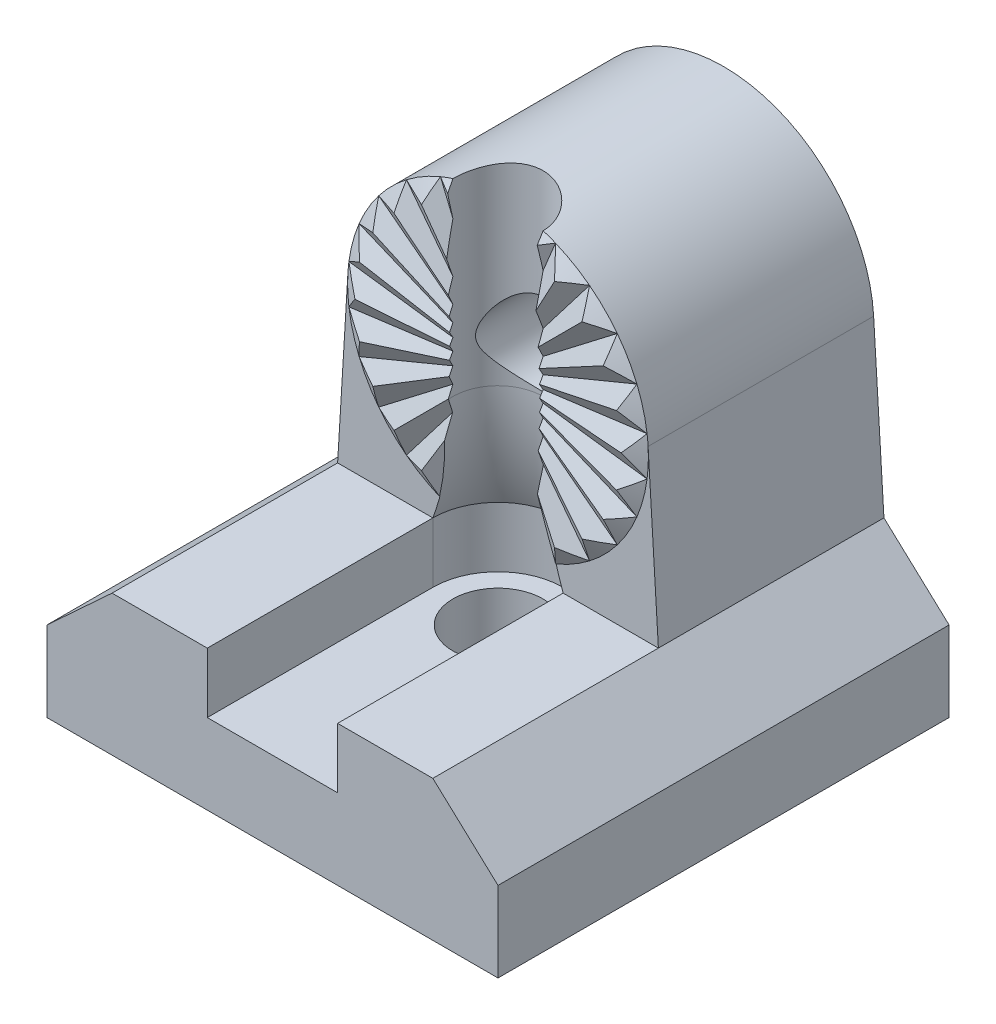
ISO-10303-21;
HEADER;
FILE_DESCRIPTION(('STEP AP214'),'2;1');
FILE_NAME('part.step','',(''),(''),'','','');
FILE_SCHEMA(('AUTOMOTIVE_DESIGN { 1 0 10303 214 1 1 1 1 }'));
ENDSEC;
DATA;
#1=APPLICATION_CONTEXT('core data for automotive mechanical design processes');
#2=APPLICATION_PROTOCOL_DEFINITION('international standard','automotive_design',2000,#1);
#3=PRODUCT_CONTEXT('',#1,'mechanical');
#4=PRODUCT('Part','Part','',(#3));
#5=PRODUCT_RELATED_PRODUCT_CATEGORY('part','',(#4));
#6=PRODUCT_DEFINITION_FORMATION('','',#4);
#7=PRODUCT_DEFINITION_CONTEXT('part definition',#1,'design');
#8=PRODUCT_DEFINITION('design','',#6,#7);
#9=PRODUCT_DEFINITION_SHAPE('','',#8);
#10=(LENGTH_UNIT() NAMED_UNIT(*) SI_UNIT(.MILLI.,.METRE.));
#11=(NAMED_UNIT(*) PLANE_ANGLE_UNIT() SI_UNIT($,.RADIAN.));
#12=(NAMED_UNIT(*) SI_UNIT($,.STERADIAN.) SOLID_ANGLE_UNIT());
#13=UNCERTAINTY_MEASURE_WITH_UNIT(LENGTH_MEASURE(1.E-05),#10,'distance_accuracy_value','');
#14=(GEOMETRIC_REPRESENTATION_CONTEXT(3) GLOBAL_UNCERTAINTY_ASSIGNED_CONTEXT((#13)) GLOBAL_UNIT_ASSIGNED_CONTEXT((#10,
#11,#12)) REPRESENTATION_CONTEXT('',''));
#15=CARTESIAN_POINT('',(0.,0.,0.));
#16=DIRECTION('',(0.,0.,1.));
#17=DIRECTION('',(1.,0.,0.));
#18=AXIS2_PLACEMENT_3D('',#15,#16,#17);
#19=CARTESIAN_POINT('',(22.5,0.,0.));
#20=DIRECTION('',(0.,-1.,0.));
#21=DIRECTION('',(0.,0.,-1.));
#22=AXIS2_PLACEMENT_3D('',#19,#20,#21);
#23=PLANE('',#22);
#24=CARTESIAN_POINT('',(0.,0.,22.5));
#25=DIRECTION('',(0.,1.,0.));
#26=DIRECTION('',(-1.,0.,0.));
#27=AXIS2_PLACEMENT_3D('',#24,#25,#26);
#28=CIRCLE('',#27,4.5);
#29=CARTESIAN_POINT('',(-4.5,0.,22.5));
#30=VERTEX_POINT('',#29);
#31=EDGE_CURVE('E863',#30,#30,#28,.T.);
#32=ORIENTED_EDGE('',*,*,#31,.T.);
#33=EDGE_LOOP('',(#32));
#34=FACE_BOUND('',#33,.T.);
#35=CARTESIAN_POINT('',(0.,0.,22.5));
#36=DIRECTION('',(0.,1.,0.));
#37=DIRECTION('',(0.,0.,1.));
#38=AXIS2_PLACEMENT_3D('',#35,#36,#37);
#39=CIRCLE('',#38,10.);
#40=CARTESIAN_POINT('',(0.,0.,32.5));
#41=VERTEX_POINT('',#40);
#42=EDGE_CURVE('E636',#41,#41,#39,.T.);
#43=ORIENTED_EDGE('',*,*,#42,.F.);
#44=EDGE_LOOP('',(#43));
#45=FACE_BOUND('',#44,.T.);
#46=ADVANCED_FACE('F16',(#34,#45),#23,.T.);
#47=CARTESIAN_POINT('',(14.8716729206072,28.0421071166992,22.5));
#48=DIRECTION('',(-0.065263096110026,-0.495722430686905,0.866025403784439));
#49=DIRECTION('',(0.,-0.867875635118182,-0.496781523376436));
#50=AXIS2_PLACEMENT_3D('',#47,#48,#49);
#51=PLANE('',#50);
#52=CARTESIAN_POINT('',(13.2681578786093,30.0000000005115,23.4998795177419));
#53=CARTESIAN_POINT('',(13.4079337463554,29.8406126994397,23.4191778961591));
#54=CARTESIAN_POINT('',(13.5460934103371,29.6801785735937,23.3377552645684));
#55=CARTESIAN_POINT('',(13.8192704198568,29.357408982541,23.1735848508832));
#56=CARTESIAN_POINT('',(13.9542885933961,29.1950740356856,23.0908374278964));
#57=CARTESIAN_POINT('',(14.2213417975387,28.8686164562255,22.9240944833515));
#58=CARTESIAN_POINT('',(14.3533769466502,28.7044938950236,22.8400990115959));
#59=CARTESIAN_POINT('',(14.6146231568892,28.3745397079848,22.6709169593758));
#60=CARTESIAN_POINT('',(14.7438334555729,28.208707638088,22.5857300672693));
#61=CARTESIAN_POINT('',(14.8716729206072,28.0421071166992,22.5));
#62=B_SPLINE_CURVE_WITH_KNOTS('',3,(#52,#53,#54,#55,#56,#57,#58,#59,#60,#61),.UNSPECIFIED.,.F.,
.F.,(4,2,2,2,4),(0.,0.680491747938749,1.36080205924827,2.04108529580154,2.72154993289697),.UNSPECIFIED.);
#63=CARTESIAN_POINT('',(13.2681578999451,30.0000000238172,23.4998795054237));
#64=VERTEX_POINT('',#63);
#65=CARTESIAN_POINT('',(14.8716729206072,28.0421071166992,22.5));
#66=VERTEX_POINT('',#65);
#67=EDGE_CURVE('E440',#64,#66,#62,.T.);
#68=ORIENTED_EDGE('',*,*,#67,.F.);
#69=DIRECTION('',(0.997172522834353,0.,0.0751462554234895));
#70=VECTOR('',#69,1.);
#71=CARTESIAN_POINT('',(4.48727635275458,30.,22.8381581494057));
#72=LINE('',#71,#70);
#73=CARTESIAN_POINT('',(4.48727635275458,30.,22.8381581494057));
#74=VERTEX_POINT('',#73);
#75=EDGE_CURVE('E420',#74,#64,#72,.T.);
#76=ORIENTED_EDGE('',*,*,#75,.F.);
#77=CARTESIAN_POINT('',(0.,30.,22.5));
#78=DIRECTION('',(-0.065263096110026,-0.495722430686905,0.866025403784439));
#79=DIRECTION('',(-0.0372516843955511,0.86848101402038,0.494320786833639));
#80=AXIS2_PLACEMENT_3D('',#77,#78,#79);
#81=ELLIPSE('',#80,9.07766064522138,4.5);
#82=CARTESIAN_POINT('',(4.5,29.4075637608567,22.5));
#83=VERTEX_POINT('',#82);
#84=EDGE_CURVE('E21',#74,#83,#81,.F.);
#85=ORIENTED_EDGE('',*,*,#84,.T.);
#86=DIRECTION('',(-0.99144486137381,0.130526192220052,0.));
#87=VECTOR('',#86,1.);
#88=CARTESIAN_POINT('',(14.8716729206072,28.0421071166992,22.5));
#89=LINE('',#88,#87);
#90=EDGE_CURVE('E468',#66,#83,#89,.T.);
#91=ORIENTED_EDGE('',*,*,#90,.F.);
#92=EDGE_LOOP('',(#68,#76,#85,#91));
#93=FACE_BOUND('',#92,.T.);
#94=ADVANCED_FACE('F439',(#93),#51,.T.);
#95=CARTESIAN_POINT('',(0.,30.,22.5));
#96=DIRECTION('',(0.065263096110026,0.495722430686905,0.866025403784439));
#97=DIRECTION('',(0.,-0.867875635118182,0.496781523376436));
#98=AXIS2_PLACEMENT_3D('',#95,#96,#97);
#99=PLANE('',#98);
#100=CARTESIAN_POINT('',(14.8716729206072,28.0421071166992,22.5));
#101=CARTESIAN_POINT('',(14.7050700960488,27.9142706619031,22.5857300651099));
#102=CARTESIAN_POINT('',(14.5373420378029,27.7875312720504,22.6709169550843));
#103=CARTESIAN_POINT('',(14.1995991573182,27.5364355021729,22.8400990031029));
#104=CARTESIAN_POINT('',(14.0295849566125,27.4120784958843,22.9240944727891));
#105=CARTESIAN_POINT('',(13.68713793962,27.16586314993,23.0908374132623));
#106=CARTESIAN_POINT('',(13.5147050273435,27.0440049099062,23.1735848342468));
#107=CARTESIAN_POINT('',(13.1672973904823,26.8029368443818,23.3377552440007));
#108=CARTESIAN_POINT('',(12.9923220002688,26.6837277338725,23.4191778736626));
#109=CARTESIAN_POINT('',(12.8160564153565,26.5659480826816,23.4998794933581));
#110=B_SPLINE_CURVE_WITH_KNOTS('',3,(#100,#101,#102,#103,#104,#105,#106,#107,#108,#109),
.UNSPECIFIED.,.F.,.F.,(4,2,2,2,4),(0.,0.68046461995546,1.36074783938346,2.04105813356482,
2.72154986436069),.UNSPECIFIED.);
#111=CARTESIAN_POINT('',(12.8160563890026,26.5659480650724,23.4998795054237));
#112=VERTEX_POINT('',#111);
#113=EDGE_CURVE('E870',#66,#112,#110,.T.);
#114=ORIENTED_EDGE('',*,*,#113,.F.);
#115=ORIENTED_EDGE('',*,*,#90,.T.);
#116=CARTESIAN_POINT('',(0.,30.,22.5));
#117=DIRECTION('',(0.065263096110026,0.495722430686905,0.866025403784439));
#118=DIRECTION('',(-0.0372516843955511,0.86848101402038,-0.494320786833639));
#119=AXIS2_PLACEMENT_3D('',#116,#117,#118);
#120=ELLIPSE('',#119,9.07766064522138,4.5);
#121=CARTESIAN_POINT('',(4.48636698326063,28.7978815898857,22.8500161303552));
#122=VERTEX_POINT('',#121);
#123=EDGE_CURVE('E434',#83,#122,#120,.F.);
#124=ORIENTED_EDGE('',*,*,#123,.T.);
#125=DIRECTION('',(-0.963194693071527,0.25808724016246,-0.0751462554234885));
#126=VECTOR('',#125,1.);
#127=CARTESIAN_POINT('',(12.8160563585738,26.5659480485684,23.4998795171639));
#128=LINE('',#127,#126);
#129=EDGE_CURVE('E464',#112,#122,#128,.T.);
#130=ORIENTED_EDGE('',*,*,#129,.F.);
#131=EDGE_LOOP('',(#114,#115,#124,#130));
#132=FACE_BOUND('',#131,.T.);
#133=ADVANCED_FACE('F1476',(#132),#99,.T.);
#134=CARTESIAN_POINT('',(13.8581929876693,24.2597485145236,22.5));
#135=DIRECTION('',(-0.191341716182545,-0.461939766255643,0.866025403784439));
#136=DIRECTION('',(0.,-0.882327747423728,-0.470635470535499));
#137=AXIS2_PLACEMENT_3D('',#134,#135,#136);
#138=PLANE('',#137);
#139=CARTESIAN_POINT('',(12.8160563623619,26.5659480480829,23.4998795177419));
#140=CARTESIAN_POINT('',(12.9098170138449,26.3758150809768,23.4191778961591));
#141=CARTESIAN_POINT('',(13.001745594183,26.1850892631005,23.3377552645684));
#142=CARTESIAN_POINT('',(13.1820754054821,25.8026143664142,23.1735848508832));
#143=CARTESIAN_POINT('',(13.2704775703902,25.6108655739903,23.0908374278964));
#144=CARTESIAN_POINT('',(13.4439377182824,25.2264133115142,22.9240944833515));
#145=CARTESIAN_POINT('',(13.528995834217,25.0337098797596,22.8400990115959));
#146=CARTESIAN_POINT('',(13.6959418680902,24.6473831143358,22.6709169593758));
#147=CARTESIAN_POINT('',(13.7778289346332,24.4537595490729,22.5857300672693));
#148=CARTESIAN_POINT('',(13.8581929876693,24.2597485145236,22.5));
#149=B_SPLINE_CURVE_WITH_KNOTS('',3,(#139,#140,#141,#142,#143,#144,#145,#146,#147,#148),
.UNSPECIFIED.,.F.,.F.,(4,2,2,2,4),(0.,0.680491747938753,1.36080205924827,2.04108529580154,
2.72154993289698),.UNSPECIFIED.);
#150=CARTESIAN_POINT('',(13.8581929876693,24.2597485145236,22.5));
#151=VERTEX_POINT('',#150);
#152=EDGE_CURVE('E1481',#112,#151,#149,.T.);
#153=ORIENTED_EDGE('',*,*,#152,.F.);
#154=ORIENTED_EDGE('',*,*,#129,.T.);
#155=CARTESIAN_POINT('',(0.,30.,22.5));
#156=DIRECTION('',(-0.191341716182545,-0.461939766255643,0.866025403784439));
#157=DIRECTION('',(-0.0996586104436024,0.886911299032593,0.451061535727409));
#158=AXIS2_PLACEMENT_3D('',#155,#156,#157);
#159=ELLIPSE('',#158,9.74152980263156,4.5);
#160=CARTESIAN_POINT('',(4.5,28.1360389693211,22.5));
#161=VERTEX_POINT('',#160);
#162=EDGE_CURVE('E467',#122,#161,#159,.F.);
#163=ORIENTED_EDGE('',*,*,#162,.T.);
#164=DIRECTION('',(-0.923879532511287,0.38268343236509,0.));
#165=VECTOR('',#164,1.);
#166=CARTESIAN_POINT('',(13.8581929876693,24.2597485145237,22.5));
#167=LINE('',#166,#165);
#168=EDGE_CURVE('E460',#151,#161,#167,.T.);
#169=ORIENTED_EDGE('',*,*,#168,.F.);
#170=EDGE_LOOP('',(#153,#154,#163,#169));
#171=FACE_BOUND('',#170,.T.);
#172=ADVANCED_FACE('F1479',(#171),#138,.T.);
#173=CARTESIAN_POINT('',(0.,30.,22.5));
#174=DIRECTION('',(0.191341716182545,0.461939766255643,0.866025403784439));
#175=DIRECTION('',(0.,-0.882327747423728,0.470635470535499));
#176=AXIS2_PLACEMENT_3D('',#173,#174,#175);
#177=PLANE('',#176);
#178=CARTESIAN_POINT('',(13.8581929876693,24.2597485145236,22.5));
#179=CARTESIAN_POINT('',(13.664180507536,24.1793879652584,22.5857300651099));
#180=CARTESIAN_POINT('',(13.4693650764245,24.1003783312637,22.6709169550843));
#181=CARTESIAN_POINT('',(13.0781421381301,23.9452527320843,22.8400990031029));
#182=CARTESIAN_POINT('',(12.8817350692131,23.8691360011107,22.9240944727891));
#183=CARTESIAN_POINT('',(12.4872314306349,23.7199420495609,23.0908374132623));
#184=CARTESIAN_POINT('',(12.289134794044,23.6468649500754,23.1735848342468));
#185=CARTESIAN_POINT('',(11.8911717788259,23.5039267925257,23.3377552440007));
#186=CARTESIAN_POINT('',(11.6913049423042,23.4340665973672,23.4191778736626));
#187=CARTESIAN_POINT('',(11.4905618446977,23.365921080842,23.4998794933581));
#188=B_SPLINE_CURVE_WITH_KNOTS('',3,(#178,#179,#180,#181,#182,#183,#184,#185,#186,#187),
.UNSPECIFIED.,.F.,.F.,(4,2,2,2,4),(0.,0.680464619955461,1.36074783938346,2.04105813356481,
2.72154986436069),.UNSPECIFIED.);
#189=CARTESIAN_POINT('',(11.4905618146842,23.3659210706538,23.4998795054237));
#190=VERTEX_POINT('',#189);
#191=EDGE_CURVE('E1498',#151,#190,#188,.T.);
#192=ORIENTED_EDGE('',*,*,#191,.F.);
#193=ORIENTED_EDGE('',*,*,#168,.T.);
#194=CARTESIAN_POINT('',(0.,30.,22.5));
#195=DIRECTION('',(0.191341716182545,0.461939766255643,0.866025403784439));
#196=DIRECTION('',(-0.0996586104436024,0.886911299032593,-0.451061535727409));
#197=AXIS2_PLACEMENT_3D('',#194,#195,#196);
#198=ELLIPSE('',#197,9.74152980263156,4.5);
#199=CARTESIAN_POINT('',(4.48305906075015,27.4117046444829,22.8901044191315));
#200=VERTEX_POINT('',#199);
#201=EDGE_CURVE('E463',#161,#200,#198,.F.);
#202=ORIENTED_EDGE('',*,*,#201,.T.);
#203=DIRECTION('',(-0.863576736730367,0.498586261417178,-0.0751462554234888));
#204=VECTOR('',#203,1.);
#205=CARTESIAN_POINT('',(11.4905617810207,23.3659210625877,23.4998795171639));
#206=LINE('',#205,#204);
#207=EDGE_CURVE('E456',#190,#200,#206,.T.);
#208=ORIENTED_EDGE('',*,*,#207,.F.);
#209=EDGE_LOOP('',(#192,#193,#202,#208));
#210=FACE_BOUND('',#209,.T.);
#211=ADVANCED_FACE('F1488',(#210),#177,.T.);
#212=CARTESIAN_POINT('',(11.9003001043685,20.8685785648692,22.5));
#213=DIRECTION('',(-0.304380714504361,-0.396676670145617,0.866025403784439));
#214=DIRECTION('',(0.,-0.909164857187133,-0.416436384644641));
#215=AXIS2_PLACEMENT_3D('',#212,#213,#214);
#216=PLANE('',#215);
#217=CARTESIAN_POINT('',(11.4905617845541,23.3659210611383,23.4998795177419));
#218=CARTESIAN_POINT('',(11.5319175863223,23.1579996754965,23.4191778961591));
#219=CARTESIAN_POINT('',(11.5713503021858,22.949979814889,23.3377552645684));
#220=CARTESIAN_POINT('',(11.6465437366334,22.5338646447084,23.1735848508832));
#221=CARTESIAN_POINT('',(11.6823054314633,22.32576937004,23.0908374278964));
#222=CARTESIAN_POINT('',(11.7503515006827,21.9095222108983,22.9240944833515));
#223=CARTESIAN_POINT('',(11.7826360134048,21.7013703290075,22.8400990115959));
#224=CARTESIAN_POINT('',(11.8439047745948,21.2849985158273,22.6709169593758));
#225=CARTESIAN_POINT('',(11.8728881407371,21.0767785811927,22.5857300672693));
#226=CARTESIAN_POINT('',(11.9003001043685,20.8685785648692,22.5));
#227=B_SPLINE_CURVE_WITH_KNOTS('',3,(#217,#218,#219,#220,#221,#222,#223,#224,#225,#226),
.UNSPECIFIED.,.F.,.F.,(4,2,2,2,4),(0.,0.680491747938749,1.36080205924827,2.04108529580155,
2.72154993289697),.UNSPECIFIED.);
#228=CARTESIAN_POINT('',(11.9003001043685,20.8685785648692,22.5));
#229=VERTEX_POINT('',#228);
#230=EDGE_CURVE('E1493',#190,#229,#227,.T.);
#231=ORIENTED_EDGE('',*,*,#230,.F.);
#232=ORIENTED_EDGE('',*,*,#207,.T.);
#233=CARTESIAN_POINT('',(0.,30.,22.5));
#234=DIRECTION('',(-0.304380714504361,-0.396676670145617,0.866025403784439));
#235=DIRECTION('',(-0.131531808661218,0.917958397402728,0.374234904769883));
#236=AXIS2_PLACEMENT_3D('',#233,#234,#235);
#237=ELLIPSE('',#236,11.3442517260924,4.5);
#238=CARTESIAN_POINT('',(4.5,26.5470285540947,22.5));
#239=VERTEX_POINT('',#238);
#240=EDGE_CURVE('E459',#200,#239,#237,.F.);
#241=ORIENTED_EDGE('',*,*,#240,.T.);
#242=DIRECTION('',(-0.793353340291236,0.608761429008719,0.));
#243=VECTOR('',#242,1.);
#244=CARTESIAN_POINT('',(11.9003001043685,20.8685785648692,22.5));
#245=LINE('',#244,#243);
#246=EDGE_CURVE('E452',#229,#239,#245,.T.);
#247=ORIENTED_EDGE('',*,*,#246,.F.);
#248=EDGE_LOOP('',(#231,#232,#241,#247));
#249=FACE_BOUND('',#248,.T.);
#250=ADVANCED_FACE('F1491',(#249),#216,.T.);
#251=CARTESIAN_POINT('',(0.,30.,22.5));
#252=DIRECTION('',(0.30438071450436,0.396676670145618,0.866025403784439));
#253=DIRECTION('',(0.,-0.909164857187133,0.416436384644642));
#254=AXIS2_PLACEMENT_3D('',#251,#252,#253);
#255=PLANE('',#254);
#256=CARTESIAN_POINT('',(11.9003001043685,20.8685785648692,22.5));
#257=CARTESIAN_POINT('',(11.6920995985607,20.8411703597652,22.5857300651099));
#258=CARTESIAN_POINT('',(11.483473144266,20.8152748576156,22.6709169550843));
#259=CARTESIAN_POINT('',(11.0654313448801,20.7666909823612,22.8400990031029));
#260=CARTESIAN_POINT('',(10.8560162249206,20.7440017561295,22.9240944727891));
#261=CARTESIAN_POINT('',(10.4363407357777,20.7019965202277,23.0908374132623));
#262=CARTESIAN_POINT('',(10.2260803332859,20.6826806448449,23.1735848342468));
#263=CARTESIAN_POINT('',(9.8046824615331,20.6476133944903,23.3377552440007));
#264=CARTESIAN_POINT('',(9.59354477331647,20.6318629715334,23.4191778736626));
#265=CARTESIAN_POINT('',(9.38200447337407,20.6179955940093,23.4998794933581));
#266=B_SPLINE_CURVE_WITH_KNOTS('',3,(#256,#257,#258,#259,#260,#261,#262,#263,#264,#265),
.UNSPECIFIED.,.F.,.F.,(4,2,2,2,4),(0.,0.680464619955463,1.36074783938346,2.04105813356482,
2.7215498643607),.UNSPECIFIED.);
#267=CARTESIAN_POINT('',(9.38200444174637,20.6179955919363,23.4998795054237));
#268=VERTEX_POINT('',#267);
#269=EDGE_CURVE('E1497',#229,#268,#266,.T.);
#270=ORIENTED_EDGE('',*,*,#269,.F.);
#271=ORIENTED_EDGE('',*,*,#246,.T.);
#272=CARTESIAN_POINT('',(0.,30.,22.5));
#273=DIRECTION('',(0.30438071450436,0.396676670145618,0.866025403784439));
#274=DIRECTION('',(-0.131531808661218,0.917958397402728,-0.374234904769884));
#275=AXIS2_PLACEMENT_3D('',#272,#273,#274);
#276=ELLIPSE('',#275,11.3442517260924,4.5);
#277=CARTESIAN_POINT('',(4.47466002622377,25.5253399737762,22.9768832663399));
#278=VERTEX_POINT('',#277);
#279=EDGE_CURVE('E455',#239,#278,#276,.F.);
#280=ORIENTED_EDGE('',*,*,#279,.T.);
#281=DIRECTION('',(-0.705107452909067,0.70510745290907,-0.0751462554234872));
#282=VECTOR('',#281,1.);
#283=CARTESIAN_POINT('',(9.3820044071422,20.6179955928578,23.4998795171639));
#284=LINE('',#283,#282);
#285=EDGE_CURVE('E448',#268,#278,#284,.T.);
#286=ORIENTED_EDGE('',*,*,#285,.F.);
#287=EDGE_LOOP('',(#270,#271,#280,#286));
#288=FACE_BOUND('',#287,.T.);
#289=ADVANCED_FACE('F1520',(#288),#255,.T.);
#290=CARTESIAN_POINT('',(9.1314214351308,18.0996998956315,22.5));
#291=DIRECTION('',(-0.396676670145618,-0.30438071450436,0.866025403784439));
#292=DIRECTION('',(0.909164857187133,0.,0.416436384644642));
#293=AXIS2_PLACEMENT_3D('',#290,#291,#292);
#294=PLANE('',#293);
#295=ORIENTED_EDGE('',*,*,#285,.T.);
#296=DIRECTION('',(0.033426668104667,-0.947589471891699,-0.317737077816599));
#297=VECTOR('',#296,1.);
#298=CARTESIAN_POINT('',(4.47466002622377,25.5253399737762,22.9768832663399));
#299=LINE('',#298,#297);
#300=CARTESIAN_POINT('',(4.4759375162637,25.4891252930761,22.964740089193));
#301=VERTEX_POINT('',#300);
#302=EDGE_CURVE('E427',#278,#301,#299,.T.);
#303=ORIENTED_EDGE('',*,*,#302,.T.);
#304=CARTESIAN_POINT('',(4.47593751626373,25.4891252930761,22.964740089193));
#305=CARTESIAN_POINT('',(4.48398508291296,25.2574110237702,22.8869859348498));
#306=CARTESIAN_POINT('',(4.49238529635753,25.0256603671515,22.8093805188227));
#307=CARTESIAN_POINT('',(4.50989101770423,24.5620862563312,22.6544671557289));
#308=CARTESIAN_POINT('',(4.51899652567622,24.3302628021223,22.5771592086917));
#309=CARTESIAN_POINT('',(4.5284546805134,24.0984029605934,22.5));
#310=B_SPLINE_CURVE_WITH_KNOTS('',3,(#304,#305,#306,#307,#308,#309),.UNSPECIFIED.,.F.,.F.,(4,2,
4),(0.,0.733630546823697,1.46726116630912),.UNSPECIFIED.);
#311=CARTESIAN_POINT('',(4.52845468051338,24.0984029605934,22.5));
#312=VERTEX_POINT('',#311);
#313=EDGE_CURVE('E451',#301,#312,#310,.T.);
#314=ORIENTED_EDGE('',*,*,#313,.T.);
#315=DIRECTION('',(-0.608761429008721,0.793353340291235,0.));
#316=VECTOR('',#315,1.);
#317=CARTESIAN_POINT('',(9.13142143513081,18.0996998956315,22.5));
#318=LINE('',#317,#316);
#319=CARTESIAN_POINT('',(9.1314214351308,18.0996998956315,22.5));
#320=VERTEX_POINT('',#319);
#321=EDGE_CURVE('E443',#320,#312,#318,.T.);
#322=ORIENTED_EDGE('',*,*,#321,.F.);
#323=CARTESIAN_POINT('',(9.38200441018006,20.6179955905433,23.4998795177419));
#324=CARTESIAN_POINT('',(9.36813703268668,20.406455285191,23.4191778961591));
#325=CARTESIAN_POINT('',(9.35238660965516,20.1953175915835,23.3377552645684));
#326=CARTESIAN_POINT('',(9.31731935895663,19.7739197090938,23.1735848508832));
#327=CARTESIAN_POINT('',(9.29800348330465,19.5636593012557,23.0908374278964));
#328=CARTESIAN_POINT('',(9.25599824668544,19.1439838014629,22.9240944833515));
#329=CARTESIAN_POINT('',(9.23330902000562,18.9345686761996,22.8400990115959));
#330=CARTESIAN_POINT('',(9.1847251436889,18.5165268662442,22.6709169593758));
#331=CARTESIAN_POINT('',(9.15882964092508,18.3079004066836,22.5857300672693));
#332=CARTESIAN_POINT('',(9.1314214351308,18.0996998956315,22.5));
#333=B_SPLINE_CURVE_WITH_KNOTS('',3,(#323,#324,#325,#326,#327,#328,#329,#330,#331,#332),
.UNSPECIFIED.,.F.,.F.,(4,2,2,2,4),(0.,0.680491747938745,1.36080205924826,2.04108529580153,
2.72154993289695),.UNSPECIFIED.);
#334=EDGE_CURVE('E1500',#268,#320,#333,.T.);
#335=ORIENTED_EDGE('',*,*,#334,.F.);
#336=EDGE_LOOP('',(#295,#303,#314,#322,#335));
#337=FACE_BOUND('',#336,.T.);
#338=ADVANCED_FACE('F625',(#337),#294,.T.);
#339=CARTESIAN_POINT('',(0.,30.,22.5));
#340=DIRECTION('',(-0.065263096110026,0.495722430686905,0.866025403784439));
#341=DIRECTION('',(0.,-0.867875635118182,0.496781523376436));
#342=AXIS2_PLACEMENT_3D('',#339,#340,#341);
#343=PLANE('',#342);
#344=CARTESIAN_POINT('',(14.8716729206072,31.9578928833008,22.5));
#345=CARTESIAN_POINT('',(14.7438334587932,31.7912923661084,22.5857300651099));
#346=CARTESIAN_POINT('',(14.6146231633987,31.6254603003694,22.6709169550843));
#347=CARTESIAN_POINT('',(14.3533769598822,31.2955061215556,22.8400990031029));
#348=CARTESIAN_POINT('',(14.2213418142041,31.1313835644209,22.9240944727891));
#349=CARTESIAN_POINT('',(13.9542886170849,30.8049259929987,23.0908374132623));
#350=CARTESIAN_POINT('',(13.8192704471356,30.642591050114,23.1735848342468));
#351=CARTESIAN_POINT('',(13.546093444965,30.3198214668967,23.3377552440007));
#352=CARTESIAN_POINT('',(13.4079337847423,30.1593873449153,23.4191778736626));
#353=CARTESIAN_POINT('',(13.2681579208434,30.0000000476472,23.4998794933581));
#354=B_SPLINE_CURVE_WITH_KNOTS('',3,(#344,#345,#346,#347,#348,#349,#350,#351,#352,#353),
.UNSPECIFIED.,.F.,.F.,(4,2,2,2,4),(0.,0.680464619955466,1.36074783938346,2.04105813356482,
2.72154986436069),.UNSPECIFIED.);
#355=CARTESIAN_POINT('',(14.8716729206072,31.9578928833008,22.5));
#356=VERTEX_POINT('',#355);
#357=EDGE_CURVE('E629',#356,#64,#354,.T.);
#358=ORIENTED_EDGE('',*,*,#357,.F.);
#359=DIRECTION('',(0.99144486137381,0.130526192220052,0.));
#360=VECTOR('',#359,1.);
#361=CARTESIAN_POINT('',(4.49999999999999,30.5924362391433,22.5));
#362=LINE('',#361,#360);
#363=CARTESIAN_POINT('',(4.49999999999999,30.5924362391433,22.5));
#364=VERTEX_POINT('',#363);
#365=EDGE_CURVE('E423',#364,#356,#362,.T.);
#366=ORIENTED_EDGE('',*,*,#365,.F.);
#367=CARTESIAN_POINT('',(0.,30.,22.5));
#368=DIRECTION('',(-0.065263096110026,0.495722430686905,0.866025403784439));
#369=DIRECTION('',(0.0372516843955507,0.86848101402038,-0.494320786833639));
#370=AXIS2_PLACEMENT_3D('',#367,#368,#369);
#371=ELLIPSE('',#370,9.07766064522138,4.5);
#372=EDGE_CURVE('E415',#364,#74,#371,.F.);
#373=ORIENTED_EDGE('',*,*,#372,.T.);
#374=ORIENTED_EDGE('',*,*,#75,.T.);
#375=EDGE_LOOP('',(#358,#366,#373,#374));
#376=FACE_BOUND('',#375,.T.);
#377=ADVANCED_FACE('F418',(#376),#343,.T.);
#378=CARTESIAN_POINT('',(5.74025148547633,16.1418070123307,22.5));
#379=DIRECTION('',(-0.461939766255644,-0.191341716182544,0.866025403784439));
#380=DIRECTION('',(0.882327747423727,0.,0.4706354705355));
#381=AXIS2_PLACEMENT_3D('',#378,#379,#380);
#382=PLANE('',#381);
#383=CARTESIAN_POINT('',(6.63407893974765,18.5094382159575,23.4998795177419));
#384=CARTESIAN_POINT('',(6.5688602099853,18.3173160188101,23.422643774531));
#385=CARTESIAN_POINT('',(6.50207051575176,18.1259963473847,23.3447473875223));
#386=CARTESIAN_POINT('',(6.36553551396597,17.7449785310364,23.1877363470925));
#387=CARTESIAN_POINT('',(6.29579093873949,17.5552799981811,23.1086219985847));
#388=CARTESIAN_POINT('',(6.15350269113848,17.177432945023,22.9492427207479));
#389=CARTESIAN_POINT('',(6.08095911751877,16.9892843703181,22.8689778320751));
#390=CARTESIAN_POINT('',(5.93320368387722,16.6144508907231,22.7073481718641));
#391=CARTESIAN_POINT('',(5.8579911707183,16.4277663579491,22.6259831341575));
#392=CARTESIAN_POINT('',(5.78152868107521,16.2418204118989,22.5441145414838));
#393=B_SPLINE_CURVE_WITH_KNOTS('',3,(#383,#384,#385,#386,#387,#388,#389,#390,#391,#392),
.UNSPECIFIED.,.F.,.F.,(4,2,2,2,4),(0.,0.651269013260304,1.30237755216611,1.95346313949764,
2.60470917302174),.UNSPECIFIED.);
#394=CARTESIAN_POINT('',(6.63407897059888,18.509438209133,23.4998795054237));
#395=VERTEX_POINT('',#394);
#396=CARTESIAN_POINT('',(5.78152868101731,16.2418204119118,22.5441145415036));
#397=VERTEX_POINT('',#396);
#398=EDGE_CURVE('E566',#395,#397,#393,.T.);
#399=ORIENTED_EDGE('',*,*,#398,.F.);
#400=DIRECTION('',(0.498586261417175,-0.863576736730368,0.0751462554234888));
#401=VECTOR('',#400,1.);
#402=CARTESIAN_POINT('',(4.62905876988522,21.9822350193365,23.1976855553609));
#403=LINE('',#402,#401);
#404=CARTESIAN_POINT('',(4.62905876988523,21.9822350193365,23.1976855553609));
#405=VERTEX_POINT('',#404);
#406=EDGE_CURVE('E441',#405,#395,#403,.T.);
#407=ORIENTED_EDGE('',*,*,#406,.F.);
#408=CARTESIAN_POINT('',(5.78152868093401,16.2418204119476,22.544114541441));
#409=CARTESIAN_POINT('',(5.71464491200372,16.4780004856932,22.5606207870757));
#410=CARTESIAN_POINT('',(5.65027497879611,16.7147772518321,22.5785997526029));
#411=CARTESIAN_POINT('',(5.52646645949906,17.1893731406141,22.617418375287));
#412=CARTESIAN_POINT('',(5.46702766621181,17.4271922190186,22.63825791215));
#413=CARTESIAN_POINT('',(5.29616705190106,18.1411319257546,22.704860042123));
#414=CARTESIAN_POINT('',(5.19195353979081,18.6186126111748,22.7547680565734));
#415=CARTESIAN_POINT('',(5.00169228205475,19.5758979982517,22.8647872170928));
#416=CARTESIAN_POINT('',(4.91564235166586,20.0557024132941,22.9248971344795));
#417=CARTESIAN_POINT('',(4.76015826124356,21.0176538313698,23.0544974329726));
#418=CARTESIAN_POINT('',(4.69075448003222,21.4998035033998,23.1240046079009));
#419=CARTESIAN_POINT('',(4.62905876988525,21.9822350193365,23.1976855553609));
#420=B_SPLINE_CURVE_WITH_KNOTS('',3,(#408,#409,#410,#411,#412,#413,#414,#415,#416,#417,#418,
#419),.UNSPECIFIED.,.F.,.F.,(4,2,2,2,2,4),(0.,0.738027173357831,1.47602332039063,
2.94927658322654,4.42235253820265,5.89809670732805),.UNSPECIFIED.);
#421=EDGE_CURVE('E601',#397,#405,#420,.T.);
#422=ORIENTED_EDGE('',*,*,#421,.F.);
#423=EDGE_LOOP('',(#399,#407,#422));
#424=FACE_BOUND('',#423,.T.);
#425=ADVANCED_FACE('F613',(#424),#382,.T.);
#426=CARTESIAN_POINT('',(0.,30.,22.5));
#427=DIRECTION('',(0.396676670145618,0.30438071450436,0.866025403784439));
#428=DIRECTION('',(0.909164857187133,0.,-0.416436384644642));
#429=AXIS2_PLACEMENT_3D('',#426,#427,#428);
#430=PLANE('',#429);
#431=CARTESIAN_POINT('',(9.13142143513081,18.0996998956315,22.5));
#432=CARTESIAN_POINT('',(8.92322142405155,18.1271118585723,22.5857300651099));
#433=CARTESIAN_POINT('',(8.71500149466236,18.156095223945,22.6709169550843));
#434=CARTESIAN_POINT('',(8.29862969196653,18.2173639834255,22.8400990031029));
#435=CARTESIAN_POINT('',(8.09047781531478,18.2496484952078,22.9240944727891));
#436=CARTESIAN_POINT('',(7.67423066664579,18.3176945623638,23.0908374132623));
#437=CARTESIAN_POINT('',(7.46613539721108,18.35345625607,23.1735848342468));
#438=CARTESIAN_POINT('',(7.05002023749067,18.4286496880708,23.3377552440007));
#439=CARTESIAN_POINT('',(6.8420003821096,18.4680824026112,23.4191778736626));
#440=CARTESIAN_POINT('',(6.63407900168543,18.5094382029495,23.4998794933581));
#441=B_SPLINE_CURVE_WITH_KNOTS('',3,(#431,#432,#433,#434,#435,#436,#437,#438,#439,#440),
.UNSPECIFIED.,.F.,.F.,(4,2,2,2,4),(0.,0.680464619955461,1.36074783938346,2.04105813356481,
2.72154986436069),.UNSPECIFIED.);
#442=EDGE_CURVE('E823',#320,#395,#441,.T.);
#443=ORIENTED_EDGE('',*,*,#442,.F.);
#444=ORIENTED_EDGE('',*,*,#321,.T.);
#445=CARTESIAN_POINT('',(4.62905876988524,21.9822350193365,23.1976855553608));
#446=CARTESIAN_POINT('',(4.61922522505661,22.1587140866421,23.1401628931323));
#447=CARTESIAN_POINT('',(4.60983372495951,22.3351554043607,23.0824510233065));
#448=CARTESIAN_POINT('',(4.59181130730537,22.6879679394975,22.9667035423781));
#449=CARTESIAN_POINT('',(4.58318037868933,22.8643391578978,22.9086679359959));
#450=CARTESIAN_POINT('',(4.56655534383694,23.2170214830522,22.7923261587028));
#451=CARTESIAN_POINT('',(4.55856123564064,23.3933325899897,22.7340199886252));
#452=CARTESIAN_POINT('',(4.54312005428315,23.7459044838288,22.6171747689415));
#453=CARTESIAN_POINT('',(4.53567298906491,23.9221652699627,22.558635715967));
#454=CARTESIAN_POINT('',(4.52845468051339,24.0984029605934,22.5));
#455=B_SPLINE_CURVE_WITH_KNOTS('',3,(#445,#446,#447,#448,#449,#450,#451,#452,#453,#454),
.UNSPECIFIED.,.F.,.F.,(4,2,2,2,4),(0.,0.557630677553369,1.11525324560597,1.67287409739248,
2.23050304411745),.UNSPECIFIED.);
#456=EDGE_CURVE('E607',#405,#312,#455,.T.);
#457=ORIENTED_EDGE('',*,*,#456,.F.);
#458=ORIENTED_EDGE('',*,*,#406,.T.);
#459=EDGE_LOOP('',(#443,#444,#457,#458));
#460=FACE_BOUND('',#459,.T.);
#461=ADVANCED_FACE('F617',(#460),#430,.T.);
#462=CARTESIAN_POINT('',(0.,30.,22.5));
#463=DIRECTION('',(0.461939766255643,-0.191341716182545,0.866025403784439));
#464=DIRECTION('',(0.882327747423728,0.,-0.470635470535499));
#465=AXIS2_PLACEMENT_3D('',#462,#463,#464);
#466=PLANE('',#465);
#467=DIRECTION('',(0.498586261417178,0.863576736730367,-0.075146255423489));
#468=VECTOR('',#467,1.);
#469=CARTESIAN_POINT('',(-6.63407893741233,18.5094382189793,23.4998795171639));
#470=LINE('',#469,#468);
#471=CARTESIAN_POINT('',(-6.6340789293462,18.5094381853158,23.4998795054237));
#472=VERTEX_POINT('',#471);
#473=CARTESIAN_POINT('',(-4.62905876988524,21.9822350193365,23.1976855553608));
#474=VERTEX_POINT('',#473);
#475=EDGE_CURVE('E828',#472,#474,#470,.T.);
#476=ORIENTED_EDGE('',*,*,#475,.F.);
#477=CARTESIAN_POINT('',(-5.78152865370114,16.2418203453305,22.5441145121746));
#478=CARTESIAN_POINT('',(-5.85799114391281,16.4277662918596,22.6259831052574));
#479=CARTESIAN_POINT('',(-5.9332036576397,16.6144508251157,22.7073481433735));
#480=CARTESIAN_POINT('',(-6.08095909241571,16.9892843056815,22.8689778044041));
#481=CARTESIAN_POINT('',(-6.15350266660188,17.1774328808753,22.9492426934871));
#482=CARTESIAN_POINT('',(-6.29579091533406,17.5552799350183,23.1086219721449));
#483=CARTESIAN_POINT('',(-6.36553549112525,17.7449784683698,23.1877363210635));
#484=CARTESIAN_POINT('',(-6.50207049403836,18.1259962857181,23.3447473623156));
#485=CARTESIAN_POINT('',(-6.56886018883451,18.3173159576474,23.4226437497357));
#486=CARTESIAN_POINT('',(-6.6340789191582,18.5094381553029,23.4998794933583));
#487=B_SPLINE_CURVE_WITH_KNOTS('',3,(#477,#478,#479,#480,#481,#482,#483,#484,#485,#486),
.UNSPECIFIED.,.F.,.F.,(4,2,2,2,4),(0.,0.651246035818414,1.3023316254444,1.95344016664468,
2.60470918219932),.UNSPECIFIED.);
#488=CARTESIAN_POINT('',(-5.78152870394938,16.2418203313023,22.5441145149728));
#489=VERTEX_POINT('',#488);
#490=EDGE_CURVE('E774',#489,#472,#487,.T.);
#491=ORIENTED_EDGE('',*,*,#490,.F.);
#492=CARTESIAN_POINT('',(-4.62905876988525,21.9822350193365,23.1976855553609));
#493=CARTESIAN_POINT('',(-4.6907544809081,21.4998034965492,23.1240046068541));
#494=CARTESIAN_POINT('',(-4.76015826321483,21.0176538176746,23.054497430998));
#495=CARTESIAN_POINT('',(-4.91564235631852,20.0557023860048,22.9248971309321));
#496=CARTESIAN_POINT('',(-5.00169228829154,19.575897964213,22.8647872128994));
#497=CARTESIAN_POINT('',(-5.1919535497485,18.6186125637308,22.754768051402));
#498=CARTESIAN_POINT('',(-5.29616706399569,18.1411318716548,22.7048600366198));
#499=CARTESIAN_POINT('',(-5.46702768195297,17.4271921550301,22.6382579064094));
#500=CARTESIAN_POINT('',(-5.52646647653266,17.1893730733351,22.6174183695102));
#501=CARTESIAN_POINT('',(-5.65027499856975,16.7147771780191,22.5785997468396));
#502=CARTESIAN_POINT('',(-5.71464493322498,16.4780004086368,22.5606207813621));
#503=CARTESIAN_POINT('',(-5.78152870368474,16.2418203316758,22.5441145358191));
#504=B_SPLINE_CURVE_WITH_KNOTS('',3,(#492,#493,#494,#495,#496,#497,#498,#499,#500,#501,#502,
#503),.UNSPECIFIED.,.F.,.F.,(4,2,2,2,2,4),(0.,1.47574419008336,2.94882016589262,
4.42207344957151,5.16006960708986,5.89809679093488),.UNSPECIFIED.);
#505=EDGE_CURVE('E800',#474,#489,#504,.T.);
#506=ORIENTED_EDGE('',*,*,#505,.F.);
#507=EDGE_LOOP('',(#476,#491,#506));
#508=FACE_BOUND('',#507,.T.);
#509=ADVANCED_FACE('F788',(#508),#466,.T.);
#510=CARTESIAN_POINT('',(-9.13142143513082,18.0996998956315,22.5));
#511=DIRECTION('',(-0.396676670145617,0.304380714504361,0.866025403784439));
#512=DIRECTION('',(0.909164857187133,0.,0.416436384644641));
#513=AXIS2_PLACEMENT_3D('',#510,#511,#512);
#514=PLANE('',#513);
#515=CARTESIAN_POINT('',(-6.63407893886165,18.5094382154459,23.4998795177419));
#516=CARTESIAN_POINT('',(-6.84200032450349,18.4680824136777,23.4191778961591));
#517=CARTESIAN_POINT('',(-7.05002018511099,18.4286496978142,23.3377552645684));
#518=CARTESIAN_POINT('',(-7.46613535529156,18.3534562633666,23.1735848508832));
#519=CARTESIAN_POINT('',(-7.67423062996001,18.3176945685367,23.0908374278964));
#520=CARTESIAN_POINT('',(-8.09047778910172,18.2496484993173,22.9240944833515));
#521=CARTESIAN_POINT('',(-8.29862967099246,18.2173639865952,22.8400990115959));
#522=CARTESIAN_POINT('',(-8.71500148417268,18.1560952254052,22.6709169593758));
#523=CARTESIAN_POINT('',(-8.92322141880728,18.1271118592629,22.5857300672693));
#524=CARTESIAN_POINT('',(-9.13142143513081,18.0996998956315,22.5));
#525=B_SPLINE_CURVE_WITH_KNOTS('',3,(#515,#516,#517,#518,#519,#520,#521,#522,#523,#524),
.UNSPECIFIED.,.F.,.F.,(4,2,2,2,4),(0.,0.68049174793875,1.36080205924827,2.04108529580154,
2.72154993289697),.UNSPECIFIED.);
#526=CARTESIAN_POINT('',(-9.1314214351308,18.0996998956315,22.5));
#527=VERTEX_POINT('',#526);
#528=EDGE_CURVE('E779',#472,#527,#525,.T.);
#529=ORIENTED_EDGE('',*,*,#528,.F.);
#530=ORIENTED_EDGE('',*,*,#475,.T.);
#531=CARTESIAN_POINT('',(-4.52845468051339,24.0984029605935,22.5));
#532=CARTESIAN_POINT('',(-4.53567298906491,23.9221652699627,22.558635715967));
#533=CARTESIAN_POINT('',(-4.54312005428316,23.7459044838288,22.6171747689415));
#534=CARTESIAN_POINT('',(-4.55856123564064,23.3933325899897,22.7340199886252));
#535=CARTESIAN_POINT('',(-4.56655534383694,23.2170214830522,22.7923261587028));
#536=CARTESIAN_POINT('',(-4.58318037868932,22.8643391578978,22.9086679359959));
#537=CARTESIAN_POINT('',(-4.59181130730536,22.6879679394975,22.9667035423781));
#538=CARTESIAN_POINT('',(-4.60983372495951,22.3351554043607,23.0824510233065));
#539=CARTESIAN_POINT('',(-4.61922522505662,22.1587140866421,23.1401628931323));
#540=CARTESIAN_POINT('',(-4.62905876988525,21.9822350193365,23.1976855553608));
#541=B_SPLINE_CURVE_WITH_KNOTS('',3,(#531,#532,#533,#534,#535,#536,#537,#538,#539,#540),
.UNSPECIFIED.,.F.,.F.,(4,2,2,2,4),(0.,0.557628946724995,1.1152497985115,1.67287236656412,
2.23050304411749),.UNSPECIFIED.);
#542=CARTESIAN_POINT('',(-4.52845468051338,24.0984029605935,22.5));
#543=VERTEX_POINT('',#542);
#544=EDGE_CURVE('E794',#543,#474,#541,.T.);
#545=ORIENTED_EDGE('',*,*,#544,.F.);
#546=DIRECTION('',(0.60876142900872,0.793353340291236,0.));
#547=VECTOR('',#546,1.);
#548=CARTESIAN_POINT('',(-9.13142143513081,18.0996998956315,22.5));
#549=LINE('',#548,#547);
#550=EDGE_CURVE('E833',#527,#543,#549,.T.);
#551=ORIENTED_EDGE('',*,*,#550,.F.);
#552=EDGE_LOOP('',(#529,#530,#545,#551));
#553=FACE_BOUND('',#552,.T.);
#554=ADVANCED_FACE('F784',(#553),#514,.T.);
#555=CARTESIAN_POINT('',(0.,30.,22.5));
#556=DIRECTION('',(0.396676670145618,-0.30438071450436,0.866025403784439));
#557=DIRECTION('',(0.909164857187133,0.,-0.416436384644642));
#558=AXIS2_PLACEMENT_3D('',#555,#556,#557);
#559=PLANE('',#558);
#560=CARTESIAN_POINT('',(-9.1314214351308,18.0996998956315,22.5));
#561=CARTESIAN_POINT('',(-9.15882964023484,18.3079004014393,22.5857300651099));
#562=CARTESIAN_POINT('',(-9.18472514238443,18.516526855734,22.6709169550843));
#563=CARTESIAN_POINT('',(-9.23330901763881,18.9345686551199,22.8400990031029));
#564=CARTESIAN_POINT('',(-9.25599824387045,19.1439837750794,22.9240944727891));
#565=CARTESIAN_POINT('',(-9.29800347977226,19.5636592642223,23.0908374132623));
#566=CARTESIAN_POINT('',(-9.31731935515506,19.7739196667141,23.1735848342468));
#567=CARTESIAN_POINT('',(-9.35238660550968,20.1953175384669,23.3377552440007));
#568=CARTESIAN_POINT('',(-9.36813702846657,20.4064552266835,23.4191778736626));
#569=CARTESIAN_POINT('',(-9.38200440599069,20.6179955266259,23.4998794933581));
#570=B_SPLINE_CURVE_WITH_KNOTS('',3,(#560,#561,#562,#563,#564,#565,#566,#567,#568,#569),
.UNSPECIFIED.,.F.,.F.,(4,2,2,2,4),(0.,0.680464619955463,1.36074783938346,2.04105813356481,
2.72154986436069),.UNSPECIFIED.);
#571=CARTESIAN_POINT('',(-9.38200440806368,20.6179955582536,23.4998795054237));
#572=VERTEX_POINT('',#571);
#573=EDGE_CURVE('E752',#527,#572,#570,.T.);
#574=ORIENTED_EDGE('',*,*,#573,.F.);
#575=ORIENTED_EDGE('',*,*,#550,.T.);
#576=CARTESIAN_POINT('',(-4.47593751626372,25.4891252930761,22.964740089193));
#577=CARTESIAN_POINT('',(-4.48398508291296,25.2574110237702,22.8869859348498));
#578=CARTESIAN_POINT('',(-4.49238529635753,25.0256603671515,22.8093805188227));
#579=CARTESIAN_POINT('',(-4.50989101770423,24.5620862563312,22.6544671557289));
#580=CARTESIAN_POINT('',(-4.51899652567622,24.3302628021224,22.5771592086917));
#581=CARTESIAN_POINT('',(-4.52845468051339,24.0984029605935,22.5));
#582=B_SPLINE_CURVE_WITH_KNOTS('',3,(#576,#577,#578,#579,#580,#581),.UNSPECIFIED.,.F.,.F.,(4,2,
4),(0.,0.733630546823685,1.46726116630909),.UNSPECIFIED.);
#583=CARTESIAN_POINT('',(-4.47593751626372,25.4891252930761,22.964740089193));
#584=VERTEX_POINT('',#583);
#585=EDGE_CURVE('E801',#584,#543,#582,.T.);
#586=ORIENTED_EDGE('',*,*,#585,.F.);
#587=DIRECTION('',(0.0334266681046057,0.94758947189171,0.317737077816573));
#588=VECTOR('',#587,1.);
#589=CARTESIAN_POINT('',(-4.47593751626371,25.4891252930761,22.964740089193));
#590=LINE('',#589,#588);
#591=CARTESIAN_POINT('',(-4.47466002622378,25.5253399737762,22.9768832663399));
#592=VERTEX_POINT('',#591);
#593=EDGE_CURVE('E829',#584,#592,#590,.T.);
#594=ORIENTED_EDGE('',*,*,#593,.T.);
#595=DIRECTION('',(0.705107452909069,0.705107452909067,-0.0751462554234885));
#596=VECTOR('',#595,1.);
#597=CARTESIAN_POINT('',(-9.3820044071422,20.6179955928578,23.4998795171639));
#598=LINE('',#597,#596);
#599=EDGE_CURVE('E836',#572,#592,#598,.T.);
#600=ORIENTED_EDGE('',*,*,#599,.F.);
#601=EDGE_LOOP('',(#574,#575,#586,#594,#600));
#602=FACE_BOUND('',#601,.T.);
#603=ADVANCED_FACE('F787',(#602),#559,.T.);
#604=CARTESIAN_POINT('',(-11.9003001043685,20.8685785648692,22.5));
#605=DIRECTION('',(-0.30438071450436,0.396676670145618,0.866025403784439));
#606=DIRECTION('',(0.,-0.909164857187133,0.416436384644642));
#607=AXIS2_PLACEMENT_3D('',#604,#605,#606);
#608=PLANE('',#607);
#609=CARTESIAN_POINT('',(-9.38200440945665,20.6179955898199,23.4998795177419));
#610=CARTESIAN_POINT('',(-9.59354471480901,20.6318629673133,23.4191778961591));
#611=CARTESIAN_POINT('',(-9.80468240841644,20.6476133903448,23.3377552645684));
#612=CARTESIAN_POINT('',(-10.2260802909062,20.6826806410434,23.1735848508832));
#613=CARTESIAN_POINT('',(-10.4363406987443,20.7019965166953,23.0908374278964));
#614=CARTESIAN_POINT('',(-10.8560161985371,20.7440017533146,22.9240944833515));
#615=CARTESIAN_POINT('',(-11.0654313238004,20.7666909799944,22.8400990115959));
#616=CARTESIAN_POINT('',(-11.4834731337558,20.8152748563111,22.6709169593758));
#617=CARTESIAN_POINT('',(-11.6920995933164,20.8411703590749,22.5857300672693));
#618=CARTESIAN_POINT('',(-11.9003001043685,20.8685785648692,22.5));
#619=B_SPLINE_CURVE_WITH_KNOTS('',3,(#609,#610,#611,#612,#613,#614,#615,#616,#617,#618),
.UNSPECIFIED.,.F.,.F.,(4,2,2,2,4),(0.,0.680491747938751,1.36080205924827,2.04108529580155,
2.72154993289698),.UNSPECIFIED.);
#620=CARTESIAN_POINT('',(-11.9003001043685,20.8685785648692,22.5));
#621=VERTEX_POINT('',#620);
#622=EDGE_CURVE('E747',#572,#621,#619,.T.);
#623=ORIENTED_EDGE('',*,*,#622,.F.);
#624=ORIENTED_EDGE('',*,*,#599,.T.);
#625=CARTESIAN_POINT('',(0.,30.,22.5));
#626=DIRECTION('',(-0.30438071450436,0.396676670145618,0.866025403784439));
#627=DIRECTION('',(0.131531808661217,0.917958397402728,-0.374234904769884));
#628=AXIS2_PLACEMENT_3D('',#625,#626,#627);
#629=ELLIPSE('',#628,11.3442517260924,4.5);
#630=CARTESIAN_POINT('',(-4.50000000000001,26.5470285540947,22.5));
#631=VERTEX_POINT('',#630);
#632=EDGE_CURVE('E835',#592,#631,#629,.F.);
#633=ORIENTED_EDGE('',*,*,#632,.T.);
#634=DIRECTION('',(0.793353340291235,0.60876142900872,0.));
#635=VECTOR('',#634,1.);
#636=CARTESIAN_POINT('',(-11.9003001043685,20.8685785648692,22.5));
#637=LINE('',#636,#635);
#638=EDGE_CURVE('E840',#621,#631,#637,.T.);
#639=ORIENTED_EDGE('',*,*,#638,.F.);
#640=EDGE_LOOP('',(#623,#624,#633,#639));
#641=FACE_BOUND('',#640,.T.);
#642=ADVANCED_FACE('F738',(#641),#608,.T.);
#643=CARTESIAN_POINT('',(0.,30.,22.5));
#644=DIRECTION('',(0.30438071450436,-0.396676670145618,0.866025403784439));
#645=DIRECTION('',(0.,-0.909164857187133,-0.416436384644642));
#646=AXIS2_PLACEMENT_3D('',#643,#644,#645);
#647=PLANE('',#646);
#648=CARTESIAN_POINT('',(-11.9003001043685,20.8685785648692,22.5));
#649=CARTESIAN_POINT('',(-11.8728881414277,21.0767785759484,22.5857300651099));
#650=CARTESIAN_POINT('',(-11.843904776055,21.2849985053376,22.6709169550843));
#651=CARTESIAN_POINT('',(-11.7826360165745,21.7013703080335,22.8400990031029));
#652=CARTESIAN_POINT('',(-11.7503515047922,21.9095221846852,22.9240944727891));
#653=CARTESIAN_POINT('',(-11.6823054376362,22.3257693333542,23.0908374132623));
#654=CARTESIAN_POINT('',(-11.64654374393,22.5338646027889,23.1735848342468));
#655=CARTESIAN_POINT('',(-11.5713503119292,22.9499797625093,23.3377552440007));
#656=CARTESIAN_POINT('',(-11.5319175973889,23.1579996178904,23.4191778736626));
#657=CARTESIAN_POINT('',(-11.4905617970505,23.3659209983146,23.4998794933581));
#658=B_SPLINE_CURVE_WITH_KNOTS('',3,(#648,#649,#650,#651,#652,#653,#654,#655,#656,#657),
.UNSPECIFIED.,.F.,.F.,(4,2,2,2,4),(0.,0.680464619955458,1.36074783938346,2.04105813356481,
2.72154986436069),.UNSPECIFIED.);
#659=CARTESIAN_POINT('',(-11.490561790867,23.3659210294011,23.4998795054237));
#660=VERTEX_POINT('',#659);
#661=EDGE_CURVE('E742',#621,#660,#658,.T.);
#662=ORIENTED_EDGE('',*,*,#661,.F.);
#663=ORIENTED_EDGE('',*,*,#638,.T.);
#664=CARTESIAN_POINT('',(0.,30.,22.5));
#665=DIRECTION('',(0.30438071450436,-0.396676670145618,0.866025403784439));
#666=DIRECTION('',(0.131531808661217,0.917958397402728,0.374234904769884));
#667=AXIS2_PLACEMENT_3D('',#664,#665,#666);
#668=ELLIPSE('',#667,11.3442517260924,4.5);
#669=CARTESIAN_POINT('',(-4.48305906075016,27.4117046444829,22.8901044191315));
#670=VERTEX_POINT('',#669);
#671=EDGE_CURVE('E839',#631,#670,#668,.F.);
#672=ORIENTED_EDGE('',*,*,#671,.T.);
#673=DIRECTION('',(0.863576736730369,0.498586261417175,-0.0751462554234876));
#674=VECTOR('',#673,1.);
#675=CARTESIAN_POINT('',(-11.4905617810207,23.3659210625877,23.4998795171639));
#676=LINE('',#675,#674);
#677=EDGE_CURVE('E844',#660,#670,#676,.T.);
#678=ORIENTED_EDGE('',*,*,#677,.F.);
#679=EDGE_LOOP('',(#662,#663,#672,#678));
#680=FACE_BOUND('',#679,.T.);
#681=ADVANCED_FACE('F733',(#680),#647,.T.);
#682=CARTESIAN_POINT('',(-13.8581929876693,24.2597485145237,22.5));
#683=DIRECTION('',(-0.191341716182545,0.461939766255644,0.866025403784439));
#684=DIRECTION('',(0.,-0.882327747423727,0.4706354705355));
#685=AXIS2_PLACEMENT_3D('',#682,#683,#684);
#686=PLANE('',#685);
#687=CARTESIAN_POINT('',(-11.4905617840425,23.3659210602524,23.4998795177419));
#688=CARTESIAN_POINT('',(-11.6913048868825,23.4340665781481,23.4191778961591));
#689=CARTESIAN_POINT('',(-11.8911717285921,23.5039267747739,23.3377552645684));
#690=CARTESIAN_POINT('',(-12.2891347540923,23.6468649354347,23.1735848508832));
#691=CARTESIAN_POINT('',(-12.4872313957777,23.7199420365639,23.0908374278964));
#692=CARTESIAN_POINT('',(-12.8817350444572,23.8691359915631,22.9240944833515));
#693=CARTESIAN_POINT('',(-13.0781421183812,23.9452527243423,22.8400990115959));
#694=CARTESIAN_POINT('',(-13.46936506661,24.1003783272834,22.6709169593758));
#695=CARTESIAN_POINT('',(-13.6641805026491,24.1793879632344,22.5857300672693));
#696=CARTESIAN_POINT('',(-13.8581929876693,24.2597485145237,22.5));
#697=B_SPLINE_CURVE_WITH_KNOTS('',3,(#687,#688,#689,#690,#691,#692,#693,#694,#695,#696),
.UNSPECIFIED.,.F.,.F.,(4,2,2,2,4),(0.,0.680491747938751,1.36080205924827,2.04108529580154,
2.72154993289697),.UNSPECIFIED.);
#698=CARTESIAN_POINT('',(-13.8581929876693,24.2597485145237,22.5));
#699=VERTEX_POINT('',#698);
#700=EDGE_CURVE('E717',#660,#699,#697,.T.);
#701=ORIENTED_EDGE('',*,*,#700,.F.);
#702=ORIENTED_EDGE('',*,*,#677,.T.);
#703=CARTESIAN_POINT('',(0.,30.,22.5));
#704=DIRECTION('',(-0.191341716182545,0.461939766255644,0.866025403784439));
#705=DIRECTION('',(0.0996586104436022,0.886911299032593,-0.451061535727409));
#706=AXIS2_PLACEMENT_3D('',#703,#704,#705);
#707=ELLIPSE('',#706,9.74152980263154,4.5);
#708=CARTESIAN_POINT('',(-4.50000000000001,28.1360389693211,22.5));
#709=VERTEX_POINT('',#708);
#710=EDGE_CURVE('E843',#670,#709,#707,.F.);
#711=ORIENTED_EDGE('',*,*,#710,.T.);
#712=DIRECTION('',(0.923879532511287,0.38268343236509,0.));
#713=VECTOR('',#712,1.);
#714=CARTESIAN_POINT('',(-13.8581929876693,24.2597485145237,22.5));
#715=LINE('',#714,#713);
#716=EDGE_CURVE('E848',#699,#709,#715,.T.);
#717=ORIENTED_EDGE('',*,*,#716,.F.);
#718=EDGE_LOOP('',(#701,#702,#711,#717));
#719=FACE_BOUND('',#718,.T.);
#720=ADVANCED_FACE('F727',(#719),#686,.T.);
#721=CARTESIAN_POINT('',(0.,30.,22.5));
#722=DIRECTION('',(0.191341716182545,-0.461939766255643,0.866025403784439));
#723=DIRECTION('',(0.,-0.882327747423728,-0.470635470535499));
#724=AXIS2_PLACEMENT_3D('',#721,#722,#723);
#725=PLANE('',#724);
#726=CARTESIAN_POINT('',(-13.8581929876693,24.2597485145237,22.5));
#727=CARTESIAN_POINT('',(-13.7778289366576,24.453759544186,22.5857300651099));
#728=CARTESIAN_POINT('',(-13.6959418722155,24.6473831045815,22.6709169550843));
#729=CARTESIAN_POINT('',(-13.5289958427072,25.0337098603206,22.8400990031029));
#730=CARTESIAN_POINT('',(-13.4439377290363,25.226413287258,22.9240944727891));
#731=CARTESIAN_POINT('',(-13.2704775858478,25.6108655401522,23.0908374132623));
#732=CARTESIAN_POINT('',(-13.1820754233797,25.8026143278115,23.1735848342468));
#733=CARTESIAN_POINT('',(-13.0017456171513,26.1850892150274,23.3377552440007));
#734=CARTESIAN_POINT('',(-12.909817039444,26.3758150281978,23.4191778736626));
#735=CARTESIAN_POINT('',(-12.8160563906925,26.5659479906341,23.4998794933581));
#736=B_SPLINE_CURVE_WITH_KNOTS('',3,(#726,#727,#728,#729,#730,#731,#732,#733,#734,#735),
.UNSPECIFIED.,.F.,.F.,(4,2,2,2,4),(0.,0.680464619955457,1.36074783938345,2.04105813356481,
2.72154986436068),.UNSPECIFIED.);
#737=CARTESIAN_POINT('',(-12.8160563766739,26.5659480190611,23.4998795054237));
#738=VERTEX_POINT('',#737);
#739=EDGE_CURVE('E711',#699,#738,#736,.T.);
#740=ORIENTED_EDGE('',*,*,#739,.F.);
#741=ORIENTED_EDGE('',*,*,#716,.T.);
#742=CARTESIAN_POINT('',(0.,30.,22.5));
#743=DIRECTION('',(0.191341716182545,-0.461939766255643,0.866025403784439));
#744=DIRECTION('',(0.099658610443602,0.886911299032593,0.451061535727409));
#745=AXIS2_PLACEMENT_3D('',#742,#743,#744);
#746=ELLIPSE('',#745,9.74152980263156,4.5);
#747=CARTESIAN_POINT('',(-4.48636698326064,28.7978815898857,22.8500161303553));
#748=VERTEX_POINT('',#747);
#749=EDGE_CURVE('E847',#709,#748,#746,.F.);
#750=ORIENTED_EDGE('',*,*,#749,.T.);
#751=DIRECTION('',(0.963194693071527,0.258087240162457,-0.0751462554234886));
#752=VECTOR('',#751,1.);
#753=CARTESIAN_POINT('',(-12.8160563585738,26.5659480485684,23.4998795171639));
#754=LINE('',#753,#752);
#755=EDGE_CURVE('E852',#738,#748,#754,.T.);
#756=ORIENTED_EDGE('',*,*,#755,.F.);
#757=EDGE_LOOP('',(#740,#741,#750,#756));
#758=FACE_BOUND('',#757,.T.);
#759=ADVANCED_FACE('F723',(#758),#725,.T.);
#760=CARTESIAN_POINT('',(-14.8716729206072,28.0421071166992,22.5));
#761=DIRECTION('',(-0.065263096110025,0.495722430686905,0.866025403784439));
#762=DIRECTION('',(0.,-0.867875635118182,0.496781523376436));
#763=AXIS2_PLACEMENT_3D('',#760,#761,#762);
#764=PLANE('',#763);
#765=CARTESIAN_POINT('',(-12.8160563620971,26.5659480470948,23.4998795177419));
#766=CARTESIAN_POINT('',(-12.9923219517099,26.6837277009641,23.4191778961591));
#767=CARTESIAN_POINT('',(-13.1672973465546,26.8029368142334,23.3377552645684));
#768=CARTESIAN_POINT('',(-13.5147049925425,27.0440048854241,23.1735848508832));
#769=CARTESIAN_POINT('',(-13.6871379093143,27.1658631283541,23.0908374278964));
#770=CARTESIAN_POINT('',(-14.0295849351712,27.4120784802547,22.9240944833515));
#771=CARTESIAN_POINT('',(-14.199599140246,27.5364354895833,22.8400990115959));
#772=CARTESIAN_POINT('',(-14.537342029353,27.7875312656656,22.6709169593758));
#773=CARTESIAN_POINT('',(-14.7050700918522,27.9142706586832,22.5857300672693));
#774=CARTESIAN_POINT('',(-14.8716729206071,28.0421071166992,22.5));
#775=B_SPLINE_CURVE_WITH_KNOTS('',3,(#765,#766,#767,#768,#769,#770,#771,#772,#773,#774),
.UNSPECIFIED.,.F.,.F.,(4,2,2,2,4),(0.,0.680491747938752,1.36080205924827,2.04108529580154,
2.72154993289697),.UNSPECIFIED.);
#776=CARTESIAN_POINT('',(-14.8716729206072,28.0421071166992,22.5));
#777=VERTEX_POINT('',#776);
#778=EDGE_CURVE('E706',#738,#777,#775,.T.);
#779=ORIENTED_EDGE('',*,*,#778,.F.);
#780=ORIENTED_EDGE('',*,*,#755,.T.);
#781=CARTESIAN_POINT('',(0.,30.,22.5));
#782=DIRECTION('',(-0.065263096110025,0.495722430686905,0.866025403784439));
#783=DIRECTION('',(0.0372516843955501,0.86848101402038,-0.494320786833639));
#784=AXIS2_PLACEMENT_3D('',#781,#782,#783);
#785=ELLIPSE('',#784,9.07766064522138,4.5);
#786=CARTESIAN_POINT('',(-4.50000000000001,29.4075637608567,22.5));
#787=VERTEX_POINT('',#786);
#788=EDGE_CURVE('E851',#748,#787,#785,.F.);
#789=ORIENTED_EDGE('',*,*,#788,.T.);
#790=DIRECTION('',(0.99144486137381,0.130526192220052,0.));
#791=VECTOR('',#790,1.);
#792=CARTESIAN_POINT('',(-14.8716729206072,28.0421071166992,22.5));
#793=LINE('',#792,#791);
#794=EDGE_CURVE('E856',#777,#787,#793,.T.);
#795=ORIENTED_EDGE('',*,*,#794,.F.);
#796=EDGE_LOOP('',(#779,#780,#789,#795));
#797=FACE_BOUND('',#796,.T.);
#798=ADVANCED_FACE('F726',(#797),#764,.T.);
#799=CARTESIAN_POINT('',(0.,30.,22.5));
#800=DIRECTION('',(0.065263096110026,-0.495722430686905,0.866025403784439));
#801=DIRECTION('',(0.,-0.867875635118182,-0.496781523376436));
#802=AXIS2_PLACEMENT_3D('',#799,#800,#801);
#803=PLANE('',#802);
#804=CARTESIAN_POINT('',(-14.8716729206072,28.0421071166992,22.5));
#805=CARTESIAN_POINT('',(-14.7438334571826,28.2087076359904,22.5857300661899));
#806=CARTESIAN_POINT('',(-14.6146231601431,28.3745397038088,22.6709169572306));
#807=CARTESIAN_POINT('',(-14.3533769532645,28.7044938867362,22.8400990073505));
#808=CARTESIAN_POINT('',(-14.2213418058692,28.868616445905,22.9240944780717));
#809=CARTESIAN_POINT('',(-13.9542886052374,29.1950740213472,23.0908374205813));
#810=CARTESIAN_POINT('',(-13.8192704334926,29.3574089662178,23.1735848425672));
#811=CARTESIAN_POINT('',(-13.5460934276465,29.6801785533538,23.3377552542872));
#812=CARTESIAN_POINT('',(-13.4079337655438,29.8406126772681,23.4191778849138));
#813=CARTESIAN_POINT('',(-13.2681578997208,29.9999999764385,23.4998795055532));
#814=B_SPLINE_CURVE_WITH_KNOTS('',3,(#804,#805,#806,#807,#808,#809,#810,#811,#812,#813),
.UNSPECIFIED.,.F.,.F.,(4,2,2,2,4),(0.,0.680464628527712,1.36074785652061,2.04105815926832,
2.7215498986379),.UNSPECIFIED.);
#815=CARTESIAN_POINT('',(-13.2681578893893,29.9999999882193,23.4998795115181));
#816=VERTEX_POINT('',#815);
#817=EDGE_CURVE('E681',#777,#816,#814,.T.);
#818=ORIENTED_EDGE('',*,*,#817,.F.);
#819=ORIENTED_EDGE('',*,*,#794,.T.);
#820=CARTESIAN_POINT('',(0.,30.,22.5));
#821=DIRECTION('',(0.065263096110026,-0.495722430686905,0.866025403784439));
#822=DIRECTION('',(0.0372516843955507,0.86848101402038,0.494320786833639));
#823=AXIS2_PLACEMENT_3D('',#820,#821,#822);
#824=ELLIPSE('',#823,9.07766064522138,4.5);
#825=CARTESIAN_POINT('',(-4.48727635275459,30.,22.8381581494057));
#826=VERTEX_POINT('',#825);
#827=EDGE_CURVE('E855',#787,#826,#824,.F.);
#828=ORIENTED_EDGE('',*,*,#827,.T.);
#829=DIRECTION('',(0.997172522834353,0.,-0.0751462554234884));
#830=VECTOR('',#829,1.);
#831=CARTESIAN_POINT('',(-13.2681578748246,30.,23.4998795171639));
#832=LINE('',#831,#830);
#833=EDGE_CURVE('E860',#816,#826,#832,.T.);
#834=ORIENTED_EDGE('',*,*,#833,.F.);
#835=EDGE_LOOP('',(#818,#819,#828,#834));
#836=FACE_BOUND('',#835,.T.);
#837=ADVANCED_FACE('F668',(#836),#803,.T.);
#838=CARTESIAN_POINT('',(-14.8716729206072,31.9578928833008,22.5));
#839=DIRECTION('',(0.065263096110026,0.495722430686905,0.866025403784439));
#840=DIRECTION('',(0.,-0.867875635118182,0.496781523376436));
#841=AXIS2_PLACEMENT_3D('',#838,#839,#840);
#842=PLANE('',#841);
#843=CARTESIAN_POINT('',(-13.2681578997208,30.0000000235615,23.4998795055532));
#844=CARTESIAN_POINT('',(-13.4079337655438,30.1593873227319,23.4191778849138));
#845=CARTESIAN_POINT('',(-13.5460934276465,30.3198214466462,23.3377552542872));
#846=CARTESIAN_POINT('',(-13.8192704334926,30.6425910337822,23.1735848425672));
#847=CARTESIAN_POINT('',(-13.9542886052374,30.8049259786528,23.0908374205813));
#848=CARTESIAN_POINT('',(-14.2213418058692,31.131383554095,22.9240944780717));
#849=CARTESIAN_POINT('',(-14.3533769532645,31.2955061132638,22.8400990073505));
#850=CARTESIAN_POINT('',(-14.6146231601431,31.6254602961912,22.6709169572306));
#851=CARTESIAN_POINT('',(-14.7438334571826,31.7912923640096,22.5857300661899));
#852=CARTESIAN_POINT('',(-14.8716729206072,31.9578928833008,22.5));
#853=B_SPLINE_CURVE_WITH_KNOTS('',3,(#843,#844,#845,#846,#847,#848,#849,#850,#851,#852),
.UNSPECIFIED.,.F.,.F.,(4,2,2,2,4),(0.,0.68049173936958,1.36080204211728,2.04108527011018,
2.7215498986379),.UNSPECIFIED.);
#854=CARTESIAN_POINT('',(-14.8716729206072,31.9578928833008,22.5));
#855=VERTEX_POINT('',#854);
#856=EDGE_CURVE('E673',#816,#855,#853,.T.);
#857=ORIENTED_EDGE('',*,*,#856,.F.);
#858=ORIENTED_EDGE('',*,*,#833,.T.);
#859=CARTESIAN_POINT('',(0.,30.,22.5));
#860=DIRECTION('',(0.065263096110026,0.495722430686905,0.866025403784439));
#861=DIRECTION('',(-0.0372516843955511,0.86848101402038,-0.494320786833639));
#862=AXIS2_PLACEMENT_3D('',#859,#860,#861);
#863=ELLIPSE('',#862,9.07766064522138,4.5);
#864=CARTESIAN_POINT('',(-4.50000000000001,30.5924362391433,22.5));
#865=VERTEX_POINT('',#864);
#866=EDGE_CURVE('E859',#826,#865,#863,.F.);
#867=ORIENTED_EDGE('',*,*,#866,.T.);
#868=DIRECTION('',(0.99144486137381,-0.130526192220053,0.));
#869=VECTOR('',#868,1.);
#870=CARTESIAN_POINT('',(-14.8716729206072,31.9578928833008,22.5));
#871=LINE('',#870,#869);
#872=EDGE_CURVE('E903',#855,#865,#871,.T.);
#873=ORIENTED_EDGE('',*,*,#872,.F.);
#874=EDGE_LOOP('',(#857,#858,#867,#873));
#875=FACE_BOUND('',#874,.T.);
#876=ADVANCED_FACE('F663',(#875),#842,.T.);
#877=CARTESIAN_POINT('',(0.,0.,22.5));
#878=DIRECTION('',(0.,1.,0.));
#879=DIRECTION('',(-1.,0.,0.));
#880=AXIS2_PLACEMENT_3D('',#877,#878,#879);
#881=CYLINDRICAL_SURFACE('',#880,4.5);
#882=CARTESIAN_POINT('',(0.,8.,22.5));
#883=DIRECTION('',(0.,1.,0.));
#884=DIRECTION('',(-1.,0.,0.));
#885=AXIS2_PLACEMENT_3D('',#882,#883,#884);
#886=CIRCLE('',#885,4.5);
#887=CARTESIAN_POINT('',(-4.5,8.,22.5));
#888=VERTEX_POINT('',#887);
#889=EDGE_CURVE('E929',#888,#888,#886,.F.);
#890=ORIENTED_EDGE('',*,*,#889,.F.);
#891=EDGE_LOOP('',(#890));
#892=FACE_BOUND('',#891,.T.);
#893=ORIENTED_EDGE('',*,*,#31,.F.);
#894=EDGE_LOOP('',(#893));
#895=FACE_BOUND('',#894,.T.);
#896=ADVANCED_FACE('F659',(#892,#895),#881,.F.);
#897=CARTESIAN_POINT('',(0.,14.,22.5));
#898=DIRECTION('',(0.,-1.,0.));
#899=DIRECTION('',(0.,0.,-1.));
#900=AXIS2_PLACEMENT_3D('',#897,#898,#899);
#901=CYLINDRICAL_SURFACE('',#900,6.5);
#902=DIRECTION('',(0.,1.,0.));
#903=VECTOR('',#902,1.);
#904=CARTESIAN_POINT('',(6.50000000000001,14.,22.5));
#905=LINE('',#904,#903);
#906=CARTESIAN_POINT('',(6.50000000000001,8.,22.5));
#907=VERTEX_POINT('',#906);
#908=CARTESIAN_POINT('',(6.50000000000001,14.,22.5));
#909=VERTEX_POINT('',#908);
#910=EDGE_CURVE('E864',#907,#909,#905,.T.);
#911=ORIENTED_EDGE('',*,*,#910,.T.);
#912=CARTESIAN_POINT('',(0.,14.,22.5));
#913=DIRECTION('',(0.,-1.,0.));
#914=DIRECTION('',(0.,0.,-1.));
#915=AXIS2_PLACEMENT_3D('',#912,#913,#914);
#916=CIRCLE('',#915,6.50000000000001);
#917=CARTESIAN_POINT('',(-6.50000000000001,14.,22.5));
#918=VERTEX_POINT('',#917);
#919=EDGE_CURVE('E602',#918,#909,#916,.T.);
#920=ORIENTED_EDGE('',*,*,#919,.F.);
#921=DIRECTION('',(0.,1.,0.));
#922=VECTOR('',#921,1.);
#923=CARTESIAN_POINT('',(-6.5,14.,22.5));
#924=LINE('',#923,#922);
#925=CARTESIAN_POINT('',(-6.5,8.,22.5));
#926=VERTEX_POINT('',#925);
#927=EDGE_CURVE('E925',#918,#926,#924,.F.);
#928=ORIENTED_EDGE('',*,*,#927,.T.);
#929=CARTESIAN_POINT('',(0.,8.,22.5));
#930=DIRECTION('',(0.,-1.,0.));
#931=DIRECTION('',(0.,0.,-1.));
#932=AXIS2_PLACEMENT_3D('',#929,#930,#931);
#933=CIRCLE('',#932,6.5);
#934=EDGE_CURVE('E682',#907,#926,#933,.F.);
#935=ORIENTED_EDGE('',*,*,#934,.F.);
#936=EDGE_LOOP('',(#911,#920,#928,#935));
#937=FACE_BOUND('',#936,.T.);
#938=ADVANCED_FACE('F655',(#937),#901,.F.);
#939=CARTESIAN_POINT('',(0.,0.,22.5));
#940=DIRECTION('',(0.,1.,0.));
#941=DIRECTION('',(0.,0.,1.));
#942=AXIS2_PLACEMENT_3D('',#939,#940,#941);
#943=CYLINDRICAL_SURFACE('',#942,10.);
#944=ORIENTED_EDGE('',*,*,#42,.T.);
#945=EDGE_LOOP('',(#944));
#946=FACE_BOUND('',#945,.T.);
#947=CARTESIAN_POINT('',(0.,2.5,22.5));
#948=DIRECTION('',(0.,1.,0.));
#949=DIRECTION('',(0.,0.,1.));
#950=AXIS2_PLACEMENT_3D('',#947,#948,#949);
#951=CIRCLE('',#950,10.);
#952=CARTESIAN_POINT('',(0.,2.5,32.5));
#953=VERTEX_POINT('',#952);
#954=EDGE_CURVE('E938',#953,#953,#951,.F.);
#955=ORIENTED_EDGE('',*,*,#954,.T.);
#956=EDGE_LOOP('',(#955));
#957=FACE_BOUND('',#956,.T.);
#958=ADVANCED_FACE('F649',(#946,#957),#943,.T.);
#959=CARTESIAN_POINT('',(0.,30.,22.5));
#960=DIRECTION('',(0.,0.,-1.));
#961=DIRECTION('',(-1.,0.,0.));
#962=AXIS2_PLACEMENT_3D('',#959,#960,#961);
#963=CONICAL_SURFACE('',#962,15.,1.04719755);
#964=CARTESIAN_POINT('',(0.,30.,22.5));
#965=DIRECTION('',(0.,0.,-1.));
#966=DIRECTION('',(-1.,0.,0.));
#967=AXIS2_PLACEMENT_3D('',#964,#965,#966);
#968=CIRCLE('',#967,15.);
#969=CARTESIAN_POINT('',(14.9723785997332,30.9098785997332,22.5));
#970=VERTEX_POINT('',#969);
#971=EDGE_CURVE('E960',#970,#66,#968,.T.);
#972=ORIENTED_EDGE('',*,*,#971,.F.);
#973=CARTESIAN_POINT('',(0.,30.,22.5));
#974=DIRECTION('',(0.,0.,-1.));
#975=DIRECTION('',(0.99144486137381,-0.130526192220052,0.));
#976=AXIS2_PLACEMENT_3D('',#973,#974,#975);
#977=CIRCLE('',#976,15.);
#978=EDGE_CURVE('E868',#970,#356,#977,.F.);
#979=ORIENTED_EDGE('',*,*,#978,.T.);
#980=ORIENTED_EDGE('',*,*,#357,.T.);
#981=ORIENTED_EDGE('',*,*,#67,.T.);
#982=EDGE_LOOP('',(#972,#979,#980,#981));
#983=FACE_BOUND('',#982,.T.);
#984=ADVANCED_FACE('F643',(#983),#963,.T.);
#985=CARTESIAN_POINT('',(0.,30.,22.5));
#986=DIRECTION('',(0.,0.,-1.));
#987=DIRECTION('',(-1.,0.,0.));
#988=AXIS2_PLACEMENT_3D('',#985,#986,#987);
#989=CONICAL_SURFACE('',#988,15.,1.04719755);
#990=ORIENTED_EDGE('',*,*,#152,.T.);
#991=CARTESIAN_POINT('',(0.,30.,22.5));
#992=DIRECTION('',(0.,0.,-1.));
#993=DIRECTION('',(-1.,0.,0.));
#994=AXIS2_PLACEMENT_3D('',#991,#992,#993);
#995=CIRCLE('',#994,15.);
#996=EDGE_CURVE('E1538',#66,#151,#995,.T.);
#997=ORIENTED_EDGE('',*,*,#996,.F.);
#998=ORIENTED_EDGE('',*,*,#113,.T.);
#999=EDGE_LOOP('',(#990,#997,#998));
#1000=FACE_BOUND('',#999,.T.);
#1001=ADVANCED_FACE('F648',(#1000),#989,.T.);
#1002=CARTESIAN_POINT('',(0.,30.,22.5));
#1003=DIRECTION('',(0.,0.,-1.));
#1004=DIRECTION('',(-1.,0.,0.));
#1005=AXIS2_PLACEMENT_3D('',#1002,#1003,#1004);
#1006=CONICAL_SURFACE('',#1005,15.,1.04719755);
#1007=ORIENTED_EDGE('',*,*,#230,.T.);
#1008=CARTESIAN_POINT('',(0.,30.,22.5));
#1009=DIRECTION('',(0.,0.,-1.));
#1010=DIRECTION('',(-1.,0.,0.));
#1011=AXIS2_PLACEMENT_3D('',#1008,#1009,#1010);
#1012=CIRCLE('',#1011,15.);
#1013=EDGE_CURVE('E1541',#151,#229,#1012,.T.);
#1014=ORIENTED_EDGE('',*,*,#1013,.F.);
#1015=ORIENTED_EDGE('',*,*,#191,.T.);
#1016=EDGE_LOOP('',(#1007,#1014,#1015));
#1017=FACE_BOUND('',#1016,.T.);
#1018=ADVANCED_FACE('F1516',(#1017),#1006,.T.);
#1019=CARTESIAN_POINT('',(0.,30.,22.5));
#1020=DIRECTION('',(0.,0.,-1.));
#1021=DIRECTION('',(-1.,0.,0.));
#1022=AXIS2_PLACEMENT_3D('',#1019,#1020,#1021);
#1023=CONICAL_SURFACE('',#1022,15.,1.04719755);
#1024=ORIENTED_EDGE('',*,*,#334,.T.);
#1025=CARTESIAN_POINT('',(0.,30.,22.5));
#1026=DIRECTION('',(0.,0.,-1.));
#1027=DIRECTION('',(-1.,0.,0.));
#1028=AXIS2_PLACEMENT_3D('',#1025,#1026,#1027);
#1029=CIRCLE('',#1028,15.);
#1030=EDGE_CURVE('E1543',#229,#320,#1029,.T.);
#1031=ORIENTED_EDGE('',*,*,#1030,.F.);
#1032=ORIENTED_EDGE('',*,*,#269,.T.);
#1033=EDGE_LOOP('',(#1024,#1031,#1032));
#1034=FACE_BOUND('',#1033,.T.);
#1035=ADVANCED_FACE('F589',(#1034),#1023,.T.);
#1036=CARTESIAN_POINT('',(0.,30.,22.5));
#1037=DIRECTION('',(0.,0.,-1.));
#1038=DIRECTION('',(-1.,0.,0.));
#1039=AXIS2_PLACEMENT_3D('',#1036,#1037,#1038);
#1040=CONICAL_SURFACE('',#1039,15.,1.04719755);
#1041=ORIENTED_EDGE('',*,*,#442,.T.);
#1042=ORIENTED_EDGE('',*,*,#398,.T.);
#1043=CARTESIAN_POINT('',(5.80269729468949,16.1678380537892,22.5));
#1044=CARTESIAN_POINT('',(5.79918117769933,16.1801721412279,22.5073519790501));
#1045=CARTESIAN_POINT('',(5.79565906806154,16.1925043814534,22.5147041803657));
#1046=CARTESIAN_POINT('',(5.78860286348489,16.2171651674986,22.5294090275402));
#1047=CARTESIAN_POINT('',(5.78506876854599,16.2294937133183,22.5367616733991));
#1048=CARTESIAN_POINT('',(5.78152868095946,16.2418204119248,22.5441145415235));
#1049=B_SPLINE_CURVE_WITH_KNOTS('',3,(#1043,#1044,#1045,#1046,#1047,#1048),.UNSPECIFIED.,.F.,
.F.,(4,2,4),(0.,0.0443497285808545,0.0886994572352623),.UNSPECIFIED.);
#1050=CARTESIAN_POINT('',(5.8026972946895,16.1678380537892,22.5));
#1051=VERTEX_POINT('',#1050);
#1052=EDGE_CURVE('E595',#1051,#397,#1049,.T.);
#1053=ORIENTED_EDGE('',*,*,#1052,.F.);
#1054=CARTESIAN_POINT('',(0.,30.,22.5));
#1055=DIRECTION('',(0.,0.,-1.));
#1056=DIRECTION('',(-1.,0.,0.));
#1057=AXIS2_PLACEMENT_3D('',#1054,#1055,#1056);
#1058=CIRCLE('',#1057,15.);
#1059=EDGE_CURVE('E1564',#320,#1051,#1058,.T.);
#1060=ORIENTED_EDGE('',*,*,#1059,.F.);
#1061=EDGE_LOOP('',(#1041,#1042,#1053,#1060));
#1062=FACE_BOUND('',#1061,.T.);
#1063=ADVANCED_FACE('F582',(#1062),#1040,.T.);
#1064=CARTESIAN_POINT('',(0.,30.,22.5));
#1065=DIRECTION('',(-0.461939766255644,-0.191341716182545,0.866025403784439));
#1066=DIRECTION('',(0.882327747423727,0.,0.4706354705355));
#1067=AXIS2_PLACEMENT_3D('',#1064,#1065,#1066);
#1068=PLANE('',#1067);
#1069=CARTESIAN_POINT('',(-4.46530101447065,43.3046124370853,23.0577518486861));
#1070=CARTESIAN_POINT('',(-4.57099808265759,43.3527223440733,23.0120023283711));
#1071=CARTESIAN_POINT('',(-4.67684404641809,43.400321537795,22.9660605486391));
#1072=CARTESIAN_POINT('',(-4.88880986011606,43.4945200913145,22.8738099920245));
#1073=CARTESIAN_POINT('',(-4.99492968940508,43.5411195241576,22.8275012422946));
#1074=CARTESIAN_POINT('',(-5.20743420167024,43.6333469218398,22.7345278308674));
#1075=CARTESIAN_POINT('',(-5.31381888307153,43.6789748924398,22.6878631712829));
#1076=CARTESIAN_POINT('',(-5.5268468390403,43.7692868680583,22.594187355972));
#1077=CARTESIAN_POINT('',(-5.63349013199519,43.8139708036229,22.5471761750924));
#1078=CARTESIAN_POINT('',(-5.74025148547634,43.8581929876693,22.5));
#1079=B_SPLINE_CURVE_WITH_KNOTS('',3,(#1069,#1070,#1071,#1072,#1073,#1074,#1075,#1076,#1077,
#1078),.UNSPECIFIED.,.F.,.F.,(4,2,2,2,4),(0.,0.374451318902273,0.748875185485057,
1.12329683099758,1.49774592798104),.UNSPECIFIED.);
#1080=CARTESIAN_POINT('',(-4.46530099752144,43.3046124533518,23.0577518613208));
#1081=VERTEX_POINT('',#1080);
#1082=CARTESIAN_POINT('',(-5.74025148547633,43.8581929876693,22.5));
#1083=VERTEX_POINT('',#1082);
#1084=EDGE_CURVE('E558',#1081,#1083,#1079,.T.);
#1085=ORIENTED_EDGE('',*,*,#1084,.T.);
#1086=DIRECTION('',(-0.382683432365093,0.923879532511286,0.));
#1087=VECTOR('',#1086,1.);
#1088=CARTESIAN_POINT('',(-4.50000000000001,40.863961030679,22.5));
#1089=LINE('',#1088,#1087);
#1090=CARTESIAN_POINT('',(-4.50000000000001,40.863961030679,22.5));
#1091=VERTEX_POINT('',#1090);
#1092=EDGE_CURVE('E918',#1091,#1083,#1089,.T.);
#1093=ORIENTED_EDGE('',*,*,#1092,.F.);
#1094=CARTESIAN_POINT('',(0.,30.,22.5));
#1095=DIRECTION('',(-0.461939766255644,-0.191341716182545,0.866025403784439));
#1096=DIRECTION('',(-0.0900521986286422,0.981523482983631,0.168826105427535));
#1097=AXIS2_PLACEMENT_3D('',#1094,#1095,#1096);
#1098=ELLIPSE('',#1097,23.5181333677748,4.5);
#1099=EDGE_CURVE('E2074',#1091,#1081,#1098,.F.);
#1100=ORIENTED_EDGE('',*,*,#1099,.T.);
#1101=EDGE_LOOP('',(#1085,#1093,#1100));
#1102=FACE_BOUND('',#1101,.T.);
#1103=ADVANCED_FACE('F578',(#1102),#1068,.T.);
#1104=CARTESIAN_POINT('',(5.74025148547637,43.8581929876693,22.5));
#1105=DIRECTION('',(0.461939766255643,-0.191341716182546,0.866025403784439));
#1106=DIRECTION('',(0.882327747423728,0.,-0.470635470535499));
#1107=AXIS2_PLACEMENT_3D('',#1104,#1105,#1106);
#1108=PLANE('',#1107);
#1109=DIRECTION('',(-0.382683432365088,-0.923879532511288,0.));
#1110=VECTOR('',#1109,1.);
#1111=CARTESIAN_POINT('',(5.74025148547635,43.8581929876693,22.5));
#1112=LINE('',#1111,#1110);
#1113=CARTESIAN_POINT('',(5.74025148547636,43.8581929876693,22.5));
#1114=VERTEX_POINT('',#1113);
#1115=CARTESIAN_POINT('',(4.49999999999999,40.8639610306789,22.5));
#1116=VERTEX_POINT('',#1115);
#1117=EDGE_CURVE('E875',#1114,#1116,#1112,.T.);
#1118=ORIENTED_EDGE('',*,*,#1117,.F.);
#1119=CARTESIAN_POINT('',(5.74025148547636,43.8581929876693,22.5));
#1120=CARTESIAN_POINT('',(5.6334901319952,43.8139708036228,22.5471761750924));
#1121=CARTESIAN_POINT('',(5.52684683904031,43.7692868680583,22.594187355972));
#1122=CARTESIAN_POINT('',(5.31381888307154,43.6789748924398,22.6878631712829));
#1123=CARTESIAN_POINT('',(5.20743420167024,43.6333469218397,22.7345278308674));
#1124=CARTESIAN_POINT('',(4.99492968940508,43.5411195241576,22.8275012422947));
#1125=CARTESIAN_POINT('',(4.88880986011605,43.4945200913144,22.8738099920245));
#1126=CARTESIAN_POINT('',(4.67684404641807,43.400321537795,22.9660605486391));
#1127=CARTESIAN_POINT('',(4.57099808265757,43.3527223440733,23.0120023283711));
#1128=CARTESIAN_POINT('',(4.46530101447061,43.3046124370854,23.0577518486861));
#1129=B_SPLINE_CURVE_WITH_KNOTS('',3,(#1119,#1120,#1121,#1122,#1123,#1124,#1125,#1126,#1127,
#1128),.UNSPECIFIED.,.F.,.F.,(4,2,2,2,4),(0.,0.374449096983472,0.748870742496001,
1.12329460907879,1.49774592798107),.UNSPECIFIED.);
#1130=CARTESIAN_POINT('',(4.46530099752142,43.3046124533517,23.0577518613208));
#1131=VERTEX_POINT('',#1130);
#1132=EDGE_CURVE('E565',#1114,#1131,#1129,.T.);
#1133=ORIENTED_EDGE('',*,*,#1132,.T.);
#1134=CARTESIAN_POINT('',(0.,30.,22.5));
#1135=DIRECTION('',(0.461939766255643,-0.191341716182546,0.866025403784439));
#1136=DIRECTION('',(0.0900521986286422,0.981523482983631,0.168826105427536));
#1137=AXIS2_PLACEMENT_3D('',#1134,#1135,#1136);
#1138=ELLIPSE('',#1137,23.5181333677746,4.5);
#1139=EDGE_CURVE('E2077',#1131,#1116,#1138,.F.);
#1140=ORIENTED_EDGE('',*,*,#1139,.T.);
#1141=EDGE_LOOP('',(#1118,#1133,#1140));
#1142=FACE_BOUND('',#1141,.T.);
#1143=ADVANCED_FACE('F581',(#1142),#1108,.T.);
#1144=CARTESIAN_POINT('',(0.,30.,22.5));
#1145=DIRECTION('',(-0.461939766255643,0.191341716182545,0.866025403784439));
#1146=DIRECTION('',(0.882327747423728,0.,0.470635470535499));
#1147=AXIS2_PLACEMENT_3D('',#1144,#1145,#1146);
#1148=PLANE('',#1147);
#1149=CARTESIAN_POINT('',(5.74025148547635,43.8581929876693,22.5));
#1150=CARTESIAN_POINT('',(5.82061203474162,43.664180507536,22.5857300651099));
#1151=CARTESIAN_POINT('',(5.89962166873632,43.4693650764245,22.6709169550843));
#1152=CARTESIAN_POINT('',(6.05474726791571,43.0781421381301,22.8400990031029));
#1153=CARTESIAN_POINT('',(6.13086399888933,42.8817350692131,22.9240944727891));
#1154=CARTESIAN_POINT('',(6.28005795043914,42.4872314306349,23.0908374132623));
#1155=CARTESIAN_POINT('',(6.35313504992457,42.289134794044,23.1735848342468));
#1156=CARTESIAN_POINT('',(6.49607320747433,41.8911717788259,23.3377552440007));
#1157=CARTESIAN_POINT('',(6.56593340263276,41.6913049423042,23.4191778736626));
#1158=CARTESIAN_POINT('',(6.634078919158,41.4905618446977,23.4998794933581));
#1159=B_SPLINE_CURVE_WITH_KNOTS('',3,(#1149,#1150,#1151,#1152,#1153,#1154,#1155,#1156,#1157,
#1158),.UNSPECIFIED.,.F.,.F.,(4,2,2,2,4),(0.,0.680464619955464,1.36074783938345,2.0410581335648,
2.72154986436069),.UNSPECIFIED.);
#1160=CARTESIAN_POINT('',(6.6340789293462,41.4905618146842,23.4998795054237));
#1161=VERTEX_POINT('',#1160);
#1162=EDGE_CURVE('E1381',#1114,#1161,#1159,.T.);
#1163=ORIENTED_EDGE('',*,*,#1162,.F.);
#1164=ORIENTED_EDGE('',*,*,#1117,.T.);
#1165=CARTESIAN_POINT('',(0.,30.,22.5));
#1166=DIRECTION('',(-0.461939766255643,0.191341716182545,0.866025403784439));
#1167=DIRECTION('',(0.0900521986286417,0.981523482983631,-0.168826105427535));
#1168=AXIS2_PLACEMENT_3D('',#1165,#1166,#1167);
#1169=ELLIPSE('',#1168,23.5181333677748,4.5);
#1170=CARTESIAN_POINT('',(4.44974336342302,37.7071815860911,23.1706593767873));
#1171=VERTEX_POINT('',#1170);
#1172=EDGE_CURVE('E2080',#1116,#1171,#1169,.F.);
#1173=ORIENTED_EDGE('',*,*,#1172,.T.);
#1174=DIRECTION('',(-0.498586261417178,-0.863576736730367,-0.075146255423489));
#1175=VECTOR('',#1174,1.);
#1176=CARTESIAN_POINT('',(6.63407893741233,41.4905617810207,23.4998795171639));
#1177=LINE('',#1176,#1175);
#1178=EDGE_CURVE('E877',#1161,#1171,#1177,.T.);
#1179=ORIENTED_EDGE('',*,*,#1178,.F.);
#1180=EDGE_LOOP('',(#1163,#1164,#1173,#1179));
#1181=FACE_BOUND('',#1180,.T.);
#1182=ADVANCED_FACE('F1885',(#1181),#1148,.T.);
#1183=CARTESIAN_POINT('',(9.13142143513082,41.9003001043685,22.5));
#1184=DIRECTION('',(0.396676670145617,-0.304380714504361,0.866025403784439));
#1185=DIRECTION('',(0.909164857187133,0.,-0.416436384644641));
#1186=AXIS2_PLACEMENT_3D('',#1183,#1184,#1185);
#1187=PLANE('',#1186);
#1188=CARTESIAN_POINT('',(6.63407893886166,41.4905617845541,23.4998795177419));
#1189=CARTESIAN_POINT('',(6.8420003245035,41.5319175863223,23.4191778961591));
#1190=CARTESIAN_POINT('',(7.050020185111,41.5713503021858,23.3377552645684));
#1191=CARTESIAN_POINT('',(7.46613535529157,41.6465437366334,23.1735848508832));
#1192=CARTESIAN_POINT('',(7.67423062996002,41.6823054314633,23.0908374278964));
#1193=CARTESIAN_POINT('',(8.09047778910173,41.7503515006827,22.9240944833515));
#1194=CARTESIAN_POINT('',(8.29862967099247,41.7826360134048,22.8400990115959));
#1195=CARTESIAN_POINT('',(8.71500148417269,41.8439047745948,22.6709169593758));
#1196=CARTESIAN_POINT('',(8.92322141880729,41.8728881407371,22.5857300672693));
#1197=CARTESIAN_POINT('',(9.13142143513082,41.9003001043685,22.5));
#1198=B_SPLINE_CURVE_WITH_KNOTS('',3,(#1188,#1189,#1190,#1191,#1192,#1193,#1194,#1195,#1196,
#1197),.UNSPECIFIED.,.F.,.F.,(4,2,2,2,4),(0.,0.680491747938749,1.36080205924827,
2.04108529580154,2.72154993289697),.UNSPECIFIED.);
#1199=CARTESIAN_POINT('',(9.13142143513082,41.9003001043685,22.5));
#1200=VERTEX_POINT('',#1199);
#1201=EDGE_CURVE('E1376',#1161,#1200,#1198,.T.);
#1202=ORIENTED_EDGE('',*,*,#1201,.F.);
#1203=ORIENTED_EDGE('',*,*,#1178,.T.);
#1204=CARTESIAN_POINT('',(0.,30.,22.5));
#1205=DIRECTION('',(0.396676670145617,-0.304380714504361,0.866025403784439));
#1206=DIRECTION('',(0.126755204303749,0.952550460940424,0.276732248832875));
#1207=AXIS2_PLACEMENT_3D('',#1204,#1205,#1206);
#1208=ELLIPSE('',#1207,14.7841166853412,4.5);
#1209=CARTESIAN_POINT('',(4.49999999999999,35.8645141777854,22.5));
#1210=VERTEX_POINT('',#1209);
#1211=EDGE_CURVE('E2101',#1171,#1210,#1208,.F.);
#1212=ORIENTED_EDGE('',*,*,#1211,.T.);
#1213=DIRECTION('',(-0.608761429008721,-0.793353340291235,0.));
#1214=VECTOR('',#1213,1.);
#1215=CARTESIAN_POINT('',(9.13142143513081,41.9003001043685,22.5));
#1216=LINE('',#1215,#1214);
#1217=EDGE_CURVE('E879',#1200,#1210,#1216,.T.);
#1218=ORIENTED_EDGE('',*,*,#1217,.F.);
#1219=EDGE_LOOP('',(#1202,#1203,#1212,#1218));
#1220=FACE_BOUND('',#1219,.T.);
#1221=ADVANCED_FACE('F1368',(#1220),#1187,.T.);
#1222=CARTESIAN_POINT('',(0.,30.,22.5));
#1223=DIRECTION('',(-0.396676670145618,0.304380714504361,0.866025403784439));
#1224=DIRECTION('',(0.909164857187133,0.,0.416436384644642));
#1225=AXIS2_PLACEMENT_3D('',#1222,#1223,#1224);
#1226=PLANE('',#1225);
#1227=CARTESIAN_POINT('',(9.13142143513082,41.9003001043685,22.5));
#1228=CARTESIAN_POINT('',(9.15882964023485,41.6920995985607,22.5857300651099));
#1229=CARTESIAN_POINT('',(9.18472514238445,41.4834731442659,22.6709169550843));
#1230=CARTESIAN_POINT('',(9.23330901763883,41.0654313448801,22.8400990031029));
#1231=CARTESIAN_POINT('',(9.25599824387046,40.8560162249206,22.9240944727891));
#1232=CARTESIAN_POINT('',(9.29800347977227,40.4363407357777,23.0908374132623));
#1233=CARTESIAN_POINT('',(9.31731935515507,40.2260803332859,23.1735848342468));
#1234=CARTESIAN_POINT('',(9.35238660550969,39.8046824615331,23.3377552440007));
#1235=CARTESIAN_POINT('',(9.36813702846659,39.5935447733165,23.4191778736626));
#1236=CARTESIAN_POINT('',(9.3820044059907,39.3820044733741,23.4998794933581));
#1237=B_SPLINE_CURVE_WITH_KNOTS('',3,(#1227,#1228,#1229,#1230,#1231,#1232,#1233,#1234,#1235,
#1236),.UNSPECIFIED.,.F.,.F.,(4,2,2,2,4),(0.,0.680464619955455,1.36074783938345,
2.04105813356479,2.72154986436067),.UNSPECIFIED.);
#1238=CARTESIAN_POINT('',(9.38200440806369,39.3820044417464,23.4998795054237));
#1239=VERTEX_POINT('',#1238);
#1240=EDGE_CURVE('E1371',#1200,#1239,#1237,.T.);
#1241=ORIENTED_EDGE('',*,*,#1240,.F.);
#1242=ORIENTED_EDGE('',*,*,#1217,.T.);
#1243=CARTESIAN_POINT('',(0.,30.,22.5));
#1244=DIRECTION('',(-0.396676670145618,0.304380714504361,0.866025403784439));
#1245=DIRECTION('',(0.126755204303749,0.952550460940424,-0.276732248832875));
#1246=AXIS2_PLACEMENT_3D('',#1243,#1244,#1245);
#1247=ELLIPSE('',#1246,14.7841166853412,4.5);
#1248=CARTESIAN_POINT('',(4.47466002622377,34.4746600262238,22.9768832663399));
#1249=VERTEX_POINT('',#1248);
#1250=EDGE_CURVE('E2105',#1210,#1249,#1247,.F.);
#1251=ORIENTED_EDGE('',*,*,#1250,.T.);
#1252=DIRECTION('',(-0.705107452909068,-0.705107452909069,-0.0751462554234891));
#1253=VECTOR('',#1252,1.);
#1254=CARTESIAN_POINT('',(9.38200440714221,39.3820044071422,23.4998795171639));
#1255=LINE('',#1254,#1253);
#1256=EDGE_CURVE('E881',#1239,#1249,#1255,.T.);
#1257=ORIENTED_EDGE('',*,*,#1256,.F.);
#1258=EDGE_LOOP('',(#1241,#1242,#1251,#1257));
#1259=FACE_BOUND('',#1258,.T.);
#1260=ADVANCED_FACE('F1363',(#1259),#1226,.T.);
#1261=CARTESIAN_POINT('',(11.9003001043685,39.1314214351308,22.5));
#1262=DIRECTION('',(0.30438071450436,-0.396676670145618,0.866025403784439));
#1263=DIRECTION('',(0.,-0.909164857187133,-0.416436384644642));
#1264=AXIS2_PLACEMENT_3D('',#1261,#1262,#1263);
#1265=PLANE('',#1264);
#1266=CARTESIAN_POINT('',(9.38200440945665,39.3820044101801,23.4998795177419));
#1267=CARTESIAN_POINT('',(9.59354471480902,39.3681370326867,23.4191778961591));
#1268=CARTESIAN_POINT('',(9.80468240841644,39.3523866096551,23.3377552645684));
#1269=CARTESIAN_POINT('',(10.2260802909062,39.3173193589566,23.1735848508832));
#1270=CARTESIAN_POINT('',(10.4363406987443,39.2980034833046,23.0908374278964));
#1271=CARTESIAN_POINT('',(10.8560161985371,39.2559982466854,22.9240944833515));
#1272=CARTESIAN_POINT('',(11.0654313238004,39.2333090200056,22.8400990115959));
#1273=CARTESIAN_POINT('',(11.4834731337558,39.1847251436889,22.6709169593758));
#1274=CARTESIAN_POINT('',(11.6920995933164,39.1588296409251,22.5857300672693));
#1275=CARTESIAN_POINT('',(11.9003001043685,39.1314214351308,22.5));
#1276=B_SPLINE_CURVE_WITH_KNOTS('',3,(#1266,#1267,#1268,#1269,#1270,#1271,#1272,#1273,#1274,
#1275),.UNSPECIFIED.,.F.,.F.,(4,2,2,2,4),(0.,0.680491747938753,1.36080205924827,
2.04108529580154,2.72154993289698),.UNSPECIFIED.);
#1277=CARTESIAN_POINT('',(11.9003001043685,39.1314214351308,22.5));
#1278=VERTEX_POINT('',#1277);
#1279=EDGE_CURVE('E1347',#1239,#1278,#1276,.T.);
#1280=ORIENTED_EDGE('',*,*,#1279,.F.);
#1281=ORIENTED_EDGE('',*,*,#1256,.T.);
#1282=CARTESIAN_POINT('',(0.,30.,22.5));
#1283=DIRECTION('',(0.30438071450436,-0.396676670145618,0.866025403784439));
#1284=DIRECTION('',(0.131531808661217,0.917958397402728,0.374234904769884));
#1285=AXIS2_PLACEMENT_3D('',#1282,#1283,#1284);
#1286=ELLIPSE('',#1285,11.3442517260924,4.5);
#1287=CARTESIAN_POINT('',(4.5,33.4529714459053,22.5));
#1288=VERTEX_POINT('',#1287);
#1289=EDGE_CURVE('E2110',#1249,#1288,#1286,.F.);
#1290=ORIENTED_EDGE('',*,*,#1289,.T.);
#1291=DIRECTION('',(-0.793353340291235,-0.608761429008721,0.));
#1292=VECTOR('',#1291,1.);
#1293=CARTESIAN_POINT('',(11.9003001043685,39.1314214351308,22.5));
#1294=LINE('',#1293,#1292);
#1295=EDGE_CURVE('E883',#1278,#1288,#1294,.T.);
#1296=ORIENTED_EDGE('',*,*,#1295,.F.);
#1297=EDGE_LOOP('',(#1280,#1281,#1290,#1296));
#1298=FACE_BOUND('',#1297,.T.);
#1299=ADVANCED_FACE('F1357',(#1298),#1265,.T.);
#1300=CARTESIAN_POINT('',(0.,30.,22.5));
#1301=DIRECTION('',(-0.30438071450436,0.396676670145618,0.866025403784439));
#1302=DIRECTION('',(0.,-0.909164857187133,0.416436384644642));
#1303=AXIS2_PLACEMENT_3D('',#1300,#1301,#1302);
#1304=PLANE('',#1303);
#1305=CARTESIAN_POINT('',(11.9003001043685,39.1314214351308,22.5));
#1306=CARTESIAN_POINT('',(11.8728881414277,38.9232214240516,22.5857300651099));
#1307=CARTESIAN_POINT('',(11.843904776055,38.7150014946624,22.6709169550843));
#1308=CARTESIAN_POINT('',(11.7826360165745,38.2986296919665,22.8400990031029));
#1309=CARTESIAN_POINT('',(11.7503515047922,38.0904778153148,22.9240944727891));
#1310=CARTESIAN_POINT('',(11.6823054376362,37.6742306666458,23.0908374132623));
#1311=CARTESIAN_POINT('',(11.64654374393,37.4661353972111,23.1735848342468));
#1312=CARTESIAN_POINT('',(11.5713503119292,37.0500202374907,23.3377552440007));
#1313=CARTESIAN_POINT('',(11.5319175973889,36.8420003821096,23.4191778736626));
#1314=CARTESIAN_POINT('',(11.4905617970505,36.6340790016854,23.4998794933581));
#1315=B_SPLINE_CURVE_WITH_KNOTS('',3,(#1305,#1306,#1307,#1308,#1309,#1310,#1311,#1312,#1313,
#1314),.UNSPECIFIED.,.F.,.F.,(4,2,2,2,4),(0.,0.680464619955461,1.36074783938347,
2.04105813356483,2.72154986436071),.UNSPECIFIED.);
#1316=CARTESIAN_POINT('',(11.490561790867,36.6340789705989,23.4998795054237));
#1317=VERTEX_POINT('',#1316);
#1318=EDGE_CURVE('E1341',#1278,#1317,#1315,.T.);
#1319=ORIENTED_EDGE('',*,*,#1318,.F.);
#1320=ORIENTED_EDGE('',*,*,#1295,.T.);
#1321=CARTESIAN_POINT('',(0.,30.,22.5));
#1322=DIRECTION('',(-0.30438071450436,0.396676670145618,0.866025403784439));
#1323=DIRECTION('',(0.131531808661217,0.917958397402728,-0.374234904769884));
#1324=AXIS2_PLACEMENT_3D('',#1321,#1322,#1323);
#1325=ELLIPSE('',#1324,11.3442517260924,4.5);
#1326=CARTESIAN_POINT('',(4.48305906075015,32.5882953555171,22.8901044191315));
#1327=VERTEX_POINT('',#1326);
#1328=EDGE_CURVE('E2112',#1288,#1327,#1325,.F.);
#1329=ORIENTED_EDGE('',*,*,#1328,.T.);
#1330=DIRECTION('',(-0.863576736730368,-0.498586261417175,-0.0751462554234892));
#1331=VECTOR('',#1330,1.);
#1332=CARTESIAN_POINT('',(11.4905617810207,36.6340789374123,23.4998795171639));
#1333=LINE('',#1332,#1331);
#1334=EDGE_CURVE('E890',#1317,#1327,#1333,.T.);
#1335=ORIENTED_EDGE('',*,*,#1334,.F.);
#1336=EDGE_LOOP('',(#1319,#1320,#1329,#1335));
#1337=FACE_BOUND('',#1336,.T.);
#1338=ADVANCED_FACE('F1353',(#1337),#1304,.T.);
#1339=CARTESIAN_POINT('',(13.8581929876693,35.7402514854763,22.5));
#1340=DIRECTION('',(0.191341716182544,-0.461939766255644,0.866025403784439));
#1341=DIRECTION('',(0.,-0.882327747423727,-0.4706354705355));
#1342=AXIS2_PLACEMENT_3D('',#1339,#1340,#1341);
#1343=PLANE('',#1342);
#1344=CARTESIAN_POINT('',(11.4905617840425,36.6340789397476,23.4998795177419));
#1345=CARTESIAN_POINT('',(11.6913048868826,36.5659334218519,23.4191778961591));
#1346=CARTESIAN_POINT('',(11.8911717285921,36.4960732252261,23.3377552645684));
#1347=CARTESIAN_POINT('',(12.2891347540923,36.3531350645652,23.1735848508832));
#1348=CARTESIAN_POINT('',(12.4872313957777,36.2800579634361,23.0908374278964));
#1349=CARTESIAN_POINT('',(12.8817350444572,36.1308640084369,22.9240944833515));
#1350=CARTESIAN_POINT('',(13.0781421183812,36.0547472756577,22.8400990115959));
#1351=CARTESIAN_POINT('',(13.46936506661,35.8996216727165,22.6709169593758));
#1352=CARTESIAN_POINT('',(13.6641805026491,35.8206120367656,22.5857300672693));
#1353=CARTESIAN_POINT('',(13.8581929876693,35.7402514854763,22.5));
#1354=B_SPLINE_CURVE_WITH_KNOTS('',3,(#1344,#1345,#1346,#1347,#1348,#1349,#1350,#1351,#1352,
#1353),.UNSPECIFIED.,.F.,.F.,(4,2,2,2,4),(0.,0.680491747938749,1.36080205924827,
2.04108529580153,2.72154993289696),.UNSPECIFIED.);
#1355=CARTESIAN_POINT('',(13.8581929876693,35.7402514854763,22.5));
#1356=VERTEX_POINT('',#1355);
#1357=EDGE_CURVE('E1335',#1317,#1356,#1354,.T.);
#1358=ORIENTED_EDGE('',*,*,#1357,.F.);
#1359=ORIENTED_EDGE('',*,*,#1334,.T.);
#1360=CARTESIAN_POINT('',(0.,30.,22.5));
#1361=DIRECTION('',(0.191341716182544,-0.461939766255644,0.866025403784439));
#1362=DIRECTION('',(0.0996586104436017,0.886911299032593,0.45106153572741));
#1363=AXIS2_PLACEMENT_3D('',#1360,#1361,#1362);
#1364=ELLIPSE('',#1363,9.74152980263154,4.5);
#1365=CARTESIAN_POINT('',(4.5,31.8639610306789,22.5));
#1366=VERTEX_POINT('',#1365);
#1367=EDGE_CURVE('E2118',#1327,#1366,#1364,.F.);
#1368=ORIENTED_EDGE('',*,*,#1367,.T.);
#1369=DIRECTION('',(-0.923879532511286,-0.38268343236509,0.));
#1370=VECTOR('',#1369,1.);
#1371=CARTESIAN_POINT('',(13.8581929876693,35.7402514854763,22.5));
#1372=LINE('',#1371,#1370);
#1373=EDGE_CURVE('E892',#1356,#1366,#1372,.T.);
#1374=ORIENTED_EDGE('',*,*,#1373,.F.);
#1375=EDGE_LOOP('',(#1358,#1359,#1368,#1374));
#1376=FACE_BOUND('',#1375,.T.);
#1377=ADVANCED_FACE('F1356',(#1376),#1343,.T.);
#1378=CARTESIAN_POINT('',(0.,30.,22.5));
#1379=DIRECTION('',(-0.191341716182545,0.461939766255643,0.866025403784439));
#1380=DIRECTION('',(0.,-0.882327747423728,0.470635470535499));
#1381=AXIS2_PLACEMENT_3D('',#1378,#1379,#1380);
#1382=PLANE('',#1381);
#1383=CARTESIAN_POINT('',(13.8581929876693,35.7402514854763,22.5));
#1384=CARTESIAN_POINT('',(13.7778289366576,35.546240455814,22.5857300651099));
#1385=CARTESIAN_POINT('',(13.6959418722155,35.3526168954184,22.6709169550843));
#1386=CARTESIAN_POINT('',(13.5289958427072,34.9662901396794,22.8400990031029));
#1387=CARTESIAN_POINT('',(13.4439377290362,34.773586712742,22.9240944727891));
#1388=CARTESIAN_POINT('',(13.2704775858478,34.3891344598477,23.0908374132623));
#1389=CARTESIAN_POINT('',(13.1820754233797,34.1973856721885,23.1735848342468));
#1390=CARTESIAN_POINT('',(13.0017456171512,33.8149107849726,23.3377552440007));
#1391=CARTESIAN_POINT('',(12.909817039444,33.6241849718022,23.4191778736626));
#1392=CARTESIAN_POINT('',(12.8160563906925,33.4340520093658,23.4998794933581));
#1393=B_SPLINE_CURVE_WITH_KNOTS('',3,(#1383,#1384,#1385,#1386,#1387,#1388,#1389,#1390,#1391,
#1392),.UNSPECIFIED.,.F.,.F.,(4,2,2,2,4),(0.,0.680464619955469,1.36074783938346,
2.04105813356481,2.72154986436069),.UNSPECIFIED.);
#1394=CARTESIAN_POINT('',(12.8160563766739,33.4340519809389,23.4998795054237));
#1395=VERTEX_POINT('',#1394);
#1396=EDGE_CURVE('E1315',#1356,#1395,#1393,.T.);
#1397=ORIENTED_EDGE('',*,*,#1396,.F.);
#1398=ORIENTED_EDGE('',*,*,#1373,.T.);
#1399=CARTESIAN_POINT('',(0.,30.,22.5));
#1400=DIRECTION('',(-0.191341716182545,0.461939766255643,0.866025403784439));
#1401=DIRECTION('',(0.099658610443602,0.886911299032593,-0.451061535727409));
#1402=AXIS2_PLACEMENT_3D('',#1399,#1400,#1401);
#1403=ELLIPSE('',#1402,9.74152980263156,4.5);
#1404=CARTESIAN_POINT('',(4.48636698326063,31.2021184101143,22.8500161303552));
#1405=VERTEX_POINT('',#1404);
#1406=EDGE_CURVE('E2120',#1366,#1405,#1403,.F.);
#1407=ORIENTED_EDGE('',*,*,#1406,.T.);
#1408=DIRECTION('',(-0.963194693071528,-0.258087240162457,-0.0751462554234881));
#1409=VECTOR('',#1408,1.);
#1410=CARTESIAN_POINT('',(12.8160563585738,33.4340519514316,23.4998795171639));
#1411=LINE('',#1410,#1409);
#1412=EDGE_CURVE('E901',#1395,#1405,#1411,.T.);
#1413=ORIENTED_EDGE('',*,*,#1412,.F.);
#1414=EDGE_LOOP('',(#1397,#1398,#1407,#1413));
#1415=FACE_BOUND('',#1414,.T.);
#1416=ADVANCED_FACE('F1916',(#1415),#1382,.T.);
#1417=CARTESIAN_POINT('',(14.8716729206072,31.9578928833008,22.5));
#1418=DIRECTION('',(0.065263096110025,-0.495722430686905,0.866025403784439));
#1419=DIRECTION('',(0.,-0.867875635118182,-0.496781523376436));
#1420=AXIS2_PLACEMENT_3D('',#1417,#1418,#1419);
#1421=PLANE('',#1420);
#1422=CARTESIAN_POINT('',(12.8160563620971,33.4340519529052,23.4998795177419));
#1423=CARTESIAN_POINT('',(12.9923219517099,33.3162722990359,23.4191778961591));
#1424=CARTESIAN_POINT('',(13.1672973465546,33.1970631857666,23.3377552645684));
#1425=CARTESIAN_POINT('',(13.5147049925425,32.9559951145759,23.1735848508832));
#1426=CARTESIAN_POINT('',(13.6871379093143,32.8341368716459,23.0908374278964));
#1427=CARTESIAN_POINT('',(14.0295849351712,32.5879215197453,22.9240944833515));
#1428=CARTESIAN_POINT('',(14.199599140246,32.4635645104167,22.8400990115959));
#1429=CARTESIAN_POINT('',(14.537342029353,32.2124687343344,22.6709169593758));
#1430=CARTESIAN_POINT('',(14.7050700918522,32.0857293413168,22.5857300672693));
#1431=CARTESIAN_POINT('',(14.8716729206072,31.9578928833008,22.5));
#1432=B_SPLINE_CURVE_WITH_KNOTS('',3,(#1422,#1423,#1424,#1425,#1426,#1427,#1428,#1429,#1430,
#1431),.UNSPECIFIED.,.F.,.F.,(4,2,2,2,4),(0.,0.680491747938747,1.36080205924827,
2.04108529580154,2.72154993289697),.UNSPECIFIED.);
#1433=EDGE_CURVE('E1309',#1395,#356,#1432,.T.);
#1434=ORIENTED_EDGE('',*,*,#1433,.F.);
#1435=ORIENTED_EDGE('',*,*,#1412,.T.);
#1436=CARTESIAN_POINT('',(0.,30.,22.5));
#1437=DIRECTION('',(0.065263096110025,-0.495722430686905,0.866025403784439));
#1438=DIRECTION('',(0.0372516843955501,0.86848101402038,0.494320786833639));
#1439=AXIS2_PLACEMENT_3D('',#1436,#1437,#1438);
#1440=ELLIPSE('',#1439,9.07766064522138,4.5);
#1441=EDGE_CURVE('E874',#1405,#364,#1440,.F.);
#1442=ORIENTED_EDGE('',*,*,#1441,.T.);
#1443=ORIENTED_EDGE('',*,*,#365,.T.);
#1444=EDGE_LOOP('',(#1434,#1435,#1442,#1443));
#1445=FACE_BOUND('',#1444,.T.);
#1446=ADVANCED_FACE('F1300',(#1445),#1421,.T.);
#1447=CARTESIAN_POINT('',(0.,30.,22.5));
#1448=DIRECTION('',(-0.065263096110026,-0.495722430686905,0.866025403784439));
#1449=DIRECTION('',(0.,-0.867875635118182,-0.496781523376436));
#1450=AXIS2_PLACEMENT_3D('',#1447,#1448,#1449);
#1451=PLANE('',#1450);
#1452=CARTESIAN_POINT('',(-14.8716729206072,31.9578928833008,22.5));
#1453=CARTESIAN_POINT('',(-14.7050700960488,32.0857293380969,22.5857300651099));
#1454=CARTESIAN_POINT('',(-14.5373420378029,32.2124687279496,22.6709169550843));
#1455=CARTESIAN_POINT('',(-14.1995991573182,32.4635644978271,22.8400990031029));
#1456=CARTESIAN_POINT('',(-14.0295849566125,32.5879215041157,22.9240944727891));
#1457=CARTESIAN_POINT('',(-13.68713793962,32.83413685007,23.0908374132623));
#1458=CARTESIAN_POINT('',(-13.5147050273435,32.9559950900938,23.1735848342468));
#1459=CARTESIAN_POINT('',(-13.1672973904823,33.1970631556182,23.3377552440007));
#1460=CARTESIAN_POINT('',(-12.9923220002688,33.3162722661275,23.4191778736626));
#1461=CARTESIAN_POINT('',(-12.8160564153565,33.4340519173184,23.4998794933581));
#1462=B_SPLINE_CURVE_WITH_KNOTS('',3,(#1452,#1453,#1454,#1455,#1456,#1457,#1458,#1459,#1460,
#1461),.UNSPECIFIED.,.F.,.F.,(4,2,2,2,4),(0.,0.680464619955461,1.36074783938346,
2.04105813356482,2.72154986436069),.UNSPECIFIED.);
#1463=CARTESIAN_POINT('',(-12.8160563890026,33.4340519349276,23.4998795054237));
#1464=VERTEX_POINT('',#1463);
#1465=EDGE_CURVE('E1304',#855,#1464,#1462,.T.);
#1466=ORIENTED_EDGE('',*,*,#1465,.F.);
#1467=ORIENTED_EDGE('',*,*,#872,.T.);
#1468=CARTESIAN_POINT('',(0.,30.,22.5));
#1469=DIRECTION('',(-0.065263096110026,-0.495722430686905,0.866025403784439));
#1470=DIRECTION('',(-0.0372516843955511,0.86848101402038,0.494320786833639));
#1471=AXIS2_PLACEMENT_3D('',#1468,#1469,#1470);
#1472=ELLIPSE('',#1471,9.07766064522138,4.5);
#1473=CARTESIAN_POINT('',(-4.48636698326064,31.2021184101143,22.8500161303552));
#1474=VERTEX_POINT('',#1473);
#1475=EDGE_CURVE('E1757',#865,#1474,#1472,.F.);
#1476=ORIENTED_EDGE('',*,*,#1475,.T.);
#1477=DIRECTION('',(0.963194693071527,-0.25808724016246,-0.075146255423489));
#1478=VECTOR('',#1477,1.);
#1479=CARTESIAN_POINT('',(-12.8160563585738,33.4340519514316,23.4998795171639));
#1480=LINE('',#1479,#1478);
#1481=EDGE_CURVE('E906',#1464,#1474,#1480,.T.);
#1482=ORIENTED_EDGE('',*,*,#1481,.F.);
#1483=EDGE_LOOP('',(#1466,#1467,#1476,#1482));
#1484=FACE_BOUND('',#1483,.T.);
#1485=ADVANCED_FACE('F1295',(#1484),#1451,.T.);
#1486=CARTESIAN_POINT('',(-13.8581929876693,35.7402514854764,22.5));
#1487=DIRECTION('',(0.191341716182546,0.461939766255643,0.866025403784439));
#1488=DIRECTION('',(0.,-0.882327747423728,0.470635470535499));
#1489=AXIS2_PLACEMENT_3D('',#1486,#1487,#1488);
#1490=PLANE('',#1489);
#1491=CARTESIAN_POINT('',(-12.8160563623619,33.4340519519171,23.4998795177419));
#1492=CARTESIAN_POINT('',(-12.9098170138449,33.6241849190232,23.4191778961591));
#1493=CARTESIAN_POINT('',(-13.001745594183,33.8149107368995,23.3377552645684));
#1494=CARTESIAN_POINT('',(-13.1820754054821,34.1973856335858,23.1735848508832));
#1495=CARTESIAN_POINT('',(-13.2704775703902,34.3891344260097,23.0908374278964));
#1496=CARTESIAN_POINT('',(-13.4439377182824,34.7735866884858,22.9240944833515));
#1497=CARTESIAN_POINT('',(-13.528995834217,34.9662901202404,22.8400990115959));
#1498=CARTESIAN_POINT('',(-13.6959418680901,35.3526168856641,22.6709169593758));
#1499=CARTESIAN_POINT('',(-13.7778289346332,35.5462404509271,22.5857300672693));
#1500=CARTESIAN_POINT('',(-13.8581929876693,35.7402514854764,22.5));
#1501=B_SPLINE_CURVE_WITH_KNOTS('',3,(#1491,#1492,#1493,#1494,#1495,#1496,#1497,#1498,#1499,
#1500),.UNSPECIFIED.,.F.,.F.,(4,2,2,2,4),(0.,0.680491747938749,1.36080205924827,
2.04108529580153,2.72154993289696),.UNSPECIFIED.);
#1502=CARTESIAN_POINT('',(-13.8581929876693,35.7402514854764,22.5));
#1503=VERTEX_POINT('',#1502);
#1504=EDGE_CURVE('E1281',#1464,#1503,#1501,.T.);
#1505=ORIENTED_EDGE('',*,*,#1504,.F.);
#1506=ORIENTED_EDGE('',*,*,#1481,.T.);
#1507=CARTESIAN_POINT('',(0.,30.,22.5));
#1508=DIRECTION('',(0.191341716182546,0.461939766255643,0.866025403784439));
#1509=DIRECTION('',(-0.0996586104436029,0.886911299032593,-0.451061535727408));
#1510=AXIS2_PLACEMENT_3D('',#1507,#1508,#1509);
#1511=ELLIPSE('',#1510,9.74152980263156,4.5);
#1512=CARTESIAN_POINT('',(-4.50000000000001,31.8639610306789,22.5));
#1513=VERTEX_POINT('',#1512);
#1514=EDGE_CURVE('E1726',#1474,#1513,#1511,.F.);
#1515=ORIENTED_EDGE('',*,*,#1514,.T.);
#1516=DIRECTION('',(0.923879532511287,-0.382683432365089,0.));
#1517=VECTOR('',#1516,1.);
#1518=CARTESIAN_POINT('',(-13.8581929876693,35.7402514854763,22.5));
#1519=LINE('',#1518,#1517);
#1520=EDGE_CURVE('E908',#1503,#1513,#1519,.T.);
#1521=ORIENTED_EDGE('',*,*,#1520,.F.);
#1522=EDGE_LOOP('',(#1505,#1506,#1515,#1521));
#1523=FACE_BOUND('',#1522,.T.);
#1524=ADVANCED_FACE('F1290',(#1523),#1490,.T.);
#1525=CARTESIAN_POINT('',(0.,30.,22.5));
#1526=DIRECTION('',(-0.191341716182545,-0.461939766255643,0.866025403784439));
#1527=DIRECTION('',(0.,-0.882327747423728,-0.470635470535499));
#1528=AXIS2_PLACEMENT_3D('',#1525,#1526,#1527);
#1529=PLANE('',#1528);
#1530=CARTESIAN_POINT('',(-13.8581929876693,35.7402514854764,22.5));
#1531=CARTESIAN_POINT('',(-13.664180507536,35.8206120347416,22.5857300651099));
#1532=CARTESIAN_POINT('',(-13.4693650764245,35.8996216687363,22.6709169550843));
#1533=CARTESIAN_POINT('',(-13.0781421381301,36.0547472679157,22.8400990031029));
#1534=CARTESIAN_POINT('',(-12.8817350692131,36.1308639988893,22.9240944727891));
#1535=CARTESIAN_POINT('',(-12.4872314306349,36.2800579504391,23.0908374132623));
#1536=CARTESIAN_POINT('',(-12.289134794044,36.3531350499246,23.1735848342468));
#1537=CARTESIAN_POINT('',(-11.8911717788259,36.4960732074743,23.3377552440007));
#1538=CARTESIAN_POINT('',(-11.6913049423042,36.5659334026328,23.4191778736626));
#1539=CARTESIAN_POINT('',(-11.4905618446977,36.634078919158,23.4998794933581));
#1540=B_SPLINE_CURVE_WITH_KNOTS('',3,(#1530,#1531,#1532,#1533,#1534,#1535,#1536,#1537,#1538,
#1539),.UNSPECIFIED.,.F.,.F.,(4,2,2,2,4),(0.,0.68046461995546,1.36074783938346,2.04105813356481,
2.72154986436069),.UNSPECIFIED.);
#1541=CARTESIAN_POINT('',(-11.4905618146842,36.6340789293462,23.4998795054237));
#1542=VERTEX_POINT('',#1541);
#1543=EDGE_CURVE('E1276',#1503,#1542,#1540,.T.);
#1544=ORIENTED_EDGE('',*,*,#1543,.F.);
#1545=ORIENTED_EDGE('',*,*,#1520,.T.);
#1546=CARTESIAN_POINT('',(0.,30.,22.5));
#1547=DIRECTION('',(-0.191341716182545,-0.461939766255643,0.866025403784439));
#1548=DIRECTION('',(-0.0996586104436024,0.886911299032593,0.451061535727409));
#1549=AXIS2_PLACEMENT_3D('',#1546,#1547,#1548);
#1550=ELLIPSE('',#1549,9.74152980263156,4.5);
#1551=CARTESIAN_POINT('',(-4.48305906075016,32.5882953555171,22.8901044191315));
#1552=VERTEX_POINT('',#1551);
#1553=EDGE_CURVE('E1751',#1513,#1552,#1550,.F.);
#1554=ORIENTED_EDGE('',*,*,#1553,.T.);
#1555=DIRECTION('',(0.863576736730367,-0.498586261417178,-0.075146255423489));
#1556=VECTOR('',#1555,1.);
#1557=CARTESIAN_POINT('',(-11.4905617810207,36.6340789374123,23.4998795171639));
#1558=LINE('',#1557,#1556);
#1559=EDGE_CURVE('E910',#1542,#1552,#1558,.T.);
#1560=ORIENTED_EDGE('',*,*,#1559,.F.);
#1561=EDGE_LOOP('',(#1544,#1545,#1554,#1560));
#1562=FACE_BOUND('',#1561,.T.);
#1563=ADVANCED_FACE('F1287',(#1562),#1529,.T.);
#1564=CARTESIAN_POINT('',(-11.9003001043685,39.1314214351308,22.5));
#1565=DIRECTION('',(0.304380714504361,0.396676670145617,0.866025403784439));
#1566=DIRECTION('',(0.,-0.909164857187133,0.416436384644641));
#1567=AXIS2_PLACEMENT_3D('',#1564,#1565,#1566);
#1568=PLANE('',#1567);
#1569=CARTESIAN_POINT('',(-11.4905617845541,36.6340789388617,23.4998795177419));
#1570=CARTESIAN_POINT('',(-11.5319175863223,36.8420003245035,23.4191778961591));
#1571=CARTESIAN_POINT('',(-11.5713503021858,37.050020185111,23.3377552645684));
#1572=CARTESIAN_POINT('',(-11.6465437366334,37.4661353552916,23.1735848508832));
#1573=CARTESIAN_POINT('',(-11.6823054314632,37.67423062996,23.0908374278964));
#1574=CARTESIAN_POINT('',(-11.7503515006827,38.0904777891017,22.9240944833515));
#1575=CARTESIAN_POINT('',(-11.7826360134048,38.2986296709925,22.8400990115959));
#1576=CARTESIAN_POINT('',(-11.8439047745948,38.7150014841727,22.6709169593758));
#1577=CARTESIAN_POINT('',(-11.8728881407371,38.9232214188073,22.5857300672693));
#1578=CARTESIAN_POINT('',(-11.9003001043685,39.1314214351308,22.5));
#1579=B_SPLINE_CURVE_WITH_KNOTS('',3,(#1569,#1570,#1571,#1572,#1573,#1574,#1575,#1576,#1577,
#1578),.UNSPECIFIED.,.F.,.F.,(4,2,2,2,4),(0.,0.68049174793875,1.36080205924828,2.04108529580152,
2.72154993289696),.UNSPECIFIED.);
#1580=CARTESIAN_POINT('',(-11.9003001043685,39.1314214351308,22.5));
#1581=VERTEX_POINT('',#1580);
#1582=EDGE_CURVE('E1256',#1542,#1581,#1579,.T.);
#1583=ORIENTED_EDGE('',*,*,#1582,.F.);
#1584=ORIENTED_EDGE('',*,*,#1559,.T.);
#1585=CARTESIAN_POINT('',(0.,30.,22.5));
#1586=DIRECTION('',(0.304380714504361,0.396676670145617,0.866025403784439));
#1587=DIRECTION('',(-0.131531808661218,0.917958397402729,-0.374234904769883));
#1588=AXIS2_PLACEMENT_3D('',#1585,#1586,#1587);
#1589=ELLIPSE('',#1588,11.3442517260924,4.5);
#1590=CARTESIAN_POINT('',(-4.50000000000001,33.4529714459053,22.5));
#1591=VERTEX_POINT('',#1590);
#1592=EDGE_CURVE('E1738',#1552,#1591,#1589,.F.);
#1593=ORIENTED_EDGE('',*,*,#1592,.T.);
#1594=DIRECTION('',(0.793353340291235,-0.608761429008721,0.));
#1595=VECTOR('',#1594,1.);
#1596=CARTESIAN_POINT('',(-11.9003001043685,39.1314214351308,22.5));
#1597=LINE('',#1596,#1595);
#1598=EDGE_CURVE('E912',#1581,#1591,#1597,.T.);
#1599=ORIENTED_EDGE('',*,*,#1598,.F.);
#1600=EDGE_LOOP('',(#1583,#1584,#1593,#1599));
#1601=FACE_BOUND('',#1600,.T.);
#1602=ADVANCED_FACE('F1247',(#1601),#1568,.T.);
#1603=CARTESIAN_POINT('',(0.,30.,22.5));
#1604=DIRECTION('',(-0.30438071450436,-0.396676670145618,0.866025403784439));
#1605=DIRECTION('',(0.,-0.909164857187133,-0.416436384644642));
#1606=AXIS2_PLACEMENT_3D('',#1603,#1604,#1605);
#1607=PLANE('',#1606);
#1608=CARTESIAN_POINT('',(-11.9003001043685,39.1314214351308,22.5));
#1609=CARTESIAN_POINT('',(-11.6920995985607,39.1588296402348,22.5857300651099));
#1610=CARTESIAN_POINT('',(-11.4834731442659,39.1847251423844,22.6709169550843));
#1611=CARTESIAN_POINT('',(-11.0654313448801,39.2333090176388,22.8400990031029));
#1612=CARTESIAN_POINT('',(-10.8560162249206,39.2559982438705,22.9240944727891));
#1613=CARTESIAN_POINT('',(-10.4363407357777,39.2980034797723,23.0908374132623));
#1614=CARTESIAN_POINT('',(-10.2260803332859,39.3173193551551,23.1735848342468));
#1615=CARTESIAN_POINT('',(-9.8046824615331,39.3523866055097,23.3377552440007));
#1616=CARTESIAN_POINT('',(-9.59354477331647,39.3681370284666,23.4191778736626));
#1617=CARTESIAN_POINT('',(-9.38200447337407,39.3820044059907,23.4998794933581));
#1618=B_SPLINE_CURVE_WITH_KNOTS('',3,(#1608,#1609,#1610,#1611,#1612,#1613,#1614,#1615,#1616,
#1617),.UNSPECIFIED.,.F.,.F.,(4,2,2,2,4),(0.,0.680464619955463,1.36074783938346,
2.04105813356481,2.72154986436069),.UNSPECIFIED.);
#1619=CARTESIAN_POINT('',(-9.38200444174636,39.3820044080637,23.4998795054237));
#1620=VERTEX_POINT('',#1619);
#1621=EDGE_CURVE('E1251',#1581,#1620,#1618,.T.);
#1622=ORIENTED_EDGE('',*,*,#1621,.F.);
#1623=ORIENTED_EDGE('',*,*,#1598,.T.);
#1624=CARTESIAN_POINT('',(0.,30.,22.5));
#1625=DIRECTION('',(-0.30438071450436,-0.396676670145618,0.866025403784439));
#1626=DIRECTION('',(-0.131531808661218,0.917958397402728,0.374234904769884));
#1627=AXIS2_PLACEMENT_3D('',#1624,#1625,#1626);
#1628=ELLIPSE('',#1627,11.3442517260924,4.5);
#1629=CARTESIAN_POINT('',(-4.47466002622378,34.4746600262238,22.9768832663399));
#1630=VERTEX_POINT('',#1629);
#1631=EDGE_CURVE('E1742',#1591,#1630,#1628,.F.);
#1632=ORIENTED_EDGE('',*,*,#1631,.T.);
#1633=DIRECTION('',(0.705107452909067,-0.70510745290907,-0.075146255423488));
#1634=VECTOR('',#1633,1.);
#1635=CARTESIAN_POINT('',(-9.38200440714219,39.3820044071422,23.4998795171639));
#1636=LINE('',#1635,#1634);
#1637=EDGE_CURVE('E914',#1620,#1630,#1636,.T.);
#1638=ORIENTED_EDGE('',*,*,#1637,.F.);
#1639=EDGE_LOOP('',(#1622,#1623,#1632,#1638));
#1640=FACE_BOUND('',#1639,.T.);
#1641=ADVANCED_FACE('F1242',(#1640),#1607,.T.);
#1642=CARTESIAN_POINT('',(-9.13142143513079,41.9003001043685,22.5));
#1643=DIRECTION('',(0.396676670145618,0.30438071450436,0.866025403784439));
#1644=DIRECTION('',(0.909164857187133,0.,-0.416436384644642));
#1645=AXIS2_PLACEMENT_3D('',#1642,#1643,#1644);
#1646=PLANE('',#1645);
#1647=CARTESIAN_POINT('',(-9.38200441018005,39.3820044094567,23.4998795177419));
#1648=CARTESIAN_POINT('',(-9.36813703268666,39.593544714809,23.4191778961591));
#1649=CARTESIAN_POINT('',(-9.35238660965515,39.8046824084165,23.3377552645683));
#1650=CARTESIAN_POINT('',(-9.31731935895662,40.2260802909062,23.1735848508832));
#1651=CARTESIAN_POINT('',(-9.29800348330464,40.4363406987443,23.0908374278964));
#1652=CARTESIAN_POINT('',(-9.25599824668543,40.8560161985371,22.9240944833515));
#1653=CARTESIAN_POINT('',(-9.23330902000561,41.0654313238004,22.8400990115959));
#1654=CARTESIAN_POINT('',(-9.18472514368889,41.4834731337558,22.6709169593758));
#1655=CARTESIAN_POINT('',(-9.15882964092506,41.6920995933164,22.5857300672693));
#1656=CARTESIAN_POINT('',(-9.13142143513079,41.9003001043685,22.5));
#1657=B_SPLINE_CURVE_WITH_KNOTS('',3,(#1647,#1648,#1649,#1650,#1651,#1652,#1653,#1654,#1655,
#1656),.UNSPECIFIED.,.F.,.F.,(4,2,2,2,4),(0.,0.680491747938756,1.36080205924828,
2.04108529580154,2.72154993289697),.UNSPECIFIED.);
#1658=CARTESIAN_POINT('',(-9.1314214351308,41.9003001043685,22.5));
#1659=VERTEX_POINT('',#1658);
#1660=EDGE_CURVE('E1220',#1620,#1659,#1657,.T.);
#1661=ORIENTED_EDGE('',*,*,#1660,.F.);
#1662=ORIENTED_EDGE('',*,*,#1637,.T.);
#1663=CARTESIAN_POINT('',(0.,30.,22.5));
#1664=DIRECTION('',(0.396676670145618,0.30438071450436,0.866025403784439));
#1665=DIRECTION('',(-0.126755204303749,0.952550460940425,-0.276732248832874));
#1666=AXIS2_PLACEMENT_3D('',#1663,#1664,#1665);
#1667=ELLIPSE('',#1666,14.7841166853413,4.5);
#1668=CARTESIAN_POINT('',(-4.50000000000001,35.8645141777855,22.5));
#1669=VERTEX_POINT('',#1668);
#1670=EDGE_CURVE('E1747',#1630,#1669,#1667,.F.);
#1671=ORIENTED_EDGE('',*,*,#1670,.T.);
#1672=DIRECTION('',(0.608761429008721,-0.793353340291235,0.));
#1673=VECTOR('',#1672,1.);
#1674=CARTESIAN_POINT('',(-9.13142143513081,41.9003001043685,22.5));
#1675=LINE('',#1674,#1673);
#1676=EDGE_CURVE('E916',#1659,#1669,#1675,.T.);
#1677=ORIENTED_EDGE('',*,*,#1676,.F.);
#1678=EDGE_LOOP('',(#1661,#1662,#1671,#1677));
#1679=FACE_BOUND('',#1678,.T.);
#1680=ADVANCED_FACE('F1237',(#1679),#1646,.T.);
#1681=CARTESIAN_POINT('',(0.,30.,22.5));
#1682=DIRECTION('',(-0.396676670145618,-0.30438071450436,0.866025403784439));
#1683=DIRECTION('',(0.909164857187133,0.,0.416436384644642));
#1684=AXIS2_PLACEMENT_3D('',#1681,#1682,#1683);
#1685=PLANE('',#1684);
#1686=CARTESIAN_POINT('',(-9.1314214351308,41.9003001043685,22.5));
#1687=CARTESIAN_POINT('',(-8.92322142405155,41.8728881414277,22.5857300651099));
#1688=CARTESIAN_POINT('',(-8.71500149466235,41.843904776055,22.6709169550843));
#1689=CARTESIAN_POINT('',(-8.29862969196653,41.7826360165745,22.8400990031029));
#1690=CARTESIAN_POINT('',(-8.09047781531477,41.7503515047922,22.9240944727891));
#1691=CARTESIAN_POINT('',(-7.67423066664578,41.6823054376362,23.0908374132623));
#1692=CARTESIAN_POINT('',(-7.46613539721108,41.64654374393,23.1735848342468));
#1693=CARTESIAN_POINT('',(-7.05002023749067,41.5713503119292,23.3377552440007));
#1694=CARTESIAN_POINT('',(-6.84200038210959,41.5319175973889,23.4191778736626));
#1695=CARTESIAN_POINT('',(-6.63407900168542,41.4905617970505,23.4998794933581));
#1696=B_SPLINE_CURVE_WITH_KNOTS('',3,(#1686,#1687,#1688,#1689,#1690,#1691,#1692,#1693,#1694,
#1695),.UNSPECIFIED.,.F.,.F.,(4,2,2,2,4),(0.,0.680464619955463,1.36074783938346,
2.04105813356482,2.72154986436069),.UNSPECIFIED.);
#1697=CARTESIAN_POINT('',(-6.63407897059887,41.490561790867,23.4998795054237));
#1698=VERTEX_POINT('',#1697);
#1699=EDGE_CURVE('E1216',#1659,#1698,#1696,.T.);
#1700=ORIENTED_EDGE('',*,*,#1699,.F.);
#1701=ORIENTED_EDGE('',*,*,#1676,.T.);
#1702=CARTESIAN_POINT('',(0.,30.,22.5));
#1703=DIRECTION('',(-0.396676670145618,-0.30438071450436,0.866025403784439));
#1704=DIRECTION('',(-0.126755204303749,0.952550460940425,0.276732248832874));
#1705=AXIS2_PLACEMENT_3D('',#1702,#1703,#1704);
#1706=ELLIPSE('',#1705,14.7841166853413,4.5);
#1707=CARTESIAN_POINT('',(-4.44974336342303,37.7071815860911,23.1706593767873));
#1708=VERTEX_POINT('',#1707);
#1709=EDGE_CURVE('E1749',#1669,#1708,#1706,.F.);
#1710=ORIENTED_EDGE('',*,*,#1709,.T.);
#1711=DIRECTION('',(0.498586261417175,-0.863576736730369,-0.0751462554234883));
#1712=VECTOR('',#1711,1.);
#1713=CARTESIAN_POINT('',(-6.63407893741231,41.4905617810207,23.4998795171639));
#1714=LINE('',#1713,#1712);
#1715=EDGE_CURVE('E921',#1698,#1708,#1714,.T.);
#1716=ORIENTED_EDGE('',*,*,#1715,.F.);
#1717=EDGE_LOOP('',(#1700,#1701,#1710,#1716));
#1718=FACE_BOUND('',#1717,.T.);
#1719=ADVANCED_FACE('F1234',(#1718),#1685,.T.);
#1720=CARTESIAN_POINT('',(-5.74025148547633,43.8581929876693,22.5));
#1721=DIRECTION('',(0.461939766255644,0.191341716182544,0.866025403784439));
#1722=DIRECTION('',(0.882327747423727,0.,-0.4706354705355));
#1723=AXIS2_PLACEMENT_3D('',#1720,#1721,#1722);
#1724=PLANE('',#1723);
#1725=CARTESIAN_POINT('',(-6.63407893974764,41.4905617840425,23.4998795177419));
#1726=CARTESIAN_POINT('',(-6.56593342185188,41.6913048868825,23.4191778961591));
#1727=CARTESIAN_POINT('',(-6.49607322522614,41.8911717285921,23.3377552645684));
#1728=CARTESIAN_POINT('',(-6.35313506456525,42.2891347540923,23.1735848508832));
#1729=CARTESIAN_POINT('',(-6.28005796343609,42.4872313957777,23.0908374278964));
#1730=CARTESIAN_POINT('',(-6.13086400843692,42.8817350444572,22.9240944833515));
#1731=CARTESIAN_POINT('',(-6.05474727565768,43.0781421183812,22.8400990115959));
#1732=CARTESIAN_POINT('',(-5.89962167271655,43.46936506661,22.6709169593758));
#1733=CARTESIAN_POINT('',(-5.82061203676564,43.6641805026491,22.5857300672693));
#1734=CARTESIAN_POINT('',(-5.74025148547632,43.8581929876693,22.5));
#1735=B_SPLINE_CURVE_WITH_KNOTS('',3,(#1725,#1726,#1727,#1728,#1729,#1730,#1731,#1732,#1733,
#1734),.UNSPECIFIED.,.F.,.F.,(4,2,2,2,4),(0.,0.68049174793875,1.36080205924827,2.04108529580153,
2.72154993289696),.UNSPECIFIED.);
#1736=EDGE_CURVE('E1212',#1698,#1083,#1735,.T.);
#1737=ORIENTED_EDGE('',*,*,#1736,.F.);
#1738=ORIENTED_EDGE('',*,*,#1715,.T.);
#1739=CARTESIAN_POINT('',(0.,30.,22.5));
#1740=DIRECTION('',(0.461939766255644,0.191341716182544,0.866025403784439));
#1741=DIRECTION('',(-0.0900521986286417,0.981523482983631,-0.168826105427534));
#1742=AXIS2_PLACEMENT_3D('',#1739,#1740,#1741);
#1743=ELLIPSE('',#1742,23.5181333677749,4.5);
#1744=EDGE_CURVE('E2071',#1708,#1091,#1743,.F.);
#1745=ORIENTED_EDGE('',*,*,#1744,.T.);
#1746=ORIENTED_EDGE('',*,*,#1092,.T.);
#1747=EDGE_LOOP('',(#1737,#1738,#1745,#1746));
#1748=FACE_BOUND('',#1747,.T.);
#1749=ADVANCED_FACE('F768',(#1748),#1724,.T.);
#1750=CARTESIAN_POINT('',(0.,25.4891252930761,22.5));
#1751=DIRECTION('',(0.,1.,0.));
#1752=DIRECTION('',(0.,0.,1.));
#1753=AXIS2_PLACEMENT_3D('',#1750,#1751,#1752);
#1754=TOROIDAL_SURFACE('',#1753,38.5000000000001,34.);
#1755=ORIENTED_EDGE('',*,*,#505,.T.);
#1756=CARTESIAN_POINT('',(-5.80269729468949,16.1678380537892,22.5));
#1757=CARTESIAN_POINT('',(-5.79918118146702,16.1801721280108,22.5073519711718));
#1758=CARTESIAN_POINT('',(-5.79565907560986,16.1925043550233,22.5147041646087));
#1759=CARTESIAN_POINT('',(-5.78860287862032,16.2171651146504,22.5294089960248));
#1760=CARTESIAN_POINT('',(-5.78506878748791,16.229493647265,22.536761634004));
#1761=CARTESIAN_POINT('',(-5.7815287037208,16.2418203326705,22.5441144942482));
#1762=B_SPLINE_CURVE_WITH_KNOTS('',3,(#1756,#1757,#1758,#1759,#1760,#1761),.UNSPECIFIED.,.F.,
.F.,(4,2,4),(0.,0.0443496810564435,0.0886993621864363),.UNSPECIFIED.);
#1763=CARTESIAN_POINT('',(-5.80269729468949,16.1678380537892,22.5));
#1764=VERTEX_POINT('',#1763);
#1765=EDGE_CURVE('E1441',#1764,#489,#1762,.T.);
#1766=ORIENTED_EDGE('',*,*,#1765,.F.);
#1767=CARTESIAN_POINT('',(-38.5000000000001,25.4891252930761,22.4999999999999));
#1768=DIRECTION('',(0.,0.,-1.));
#1769=DIRECTION('',(-1.,0.,0.));
#1770=AXIS2_PLACEMENT_3D('',#1767,#1768,#1769);
#1771=CIRCLE('',#1770,34.);
#1772=EDGE_CURVE('E1195',#918,#1764,#1771,.F.);
#1773=ORIENTED_EDGE('',*,*,#1772,.F.);
#1774=ORIENTED_EDGE('',*,*,#919,.T.);
#1775=CARTESIAN_POINT('',(38.5000000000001,25.4891252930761,22.5));
#1776=DIRECTION('',(0.,0.,1.));
#1777=DIRECTION('',(1.,0.,0.));
#1778=AXIS2_PLACEMENT_3D('',#1775,#1776,#1777);
#1779=CIRCLE('',#1778,34.);
#1780=EDGE_CURVE('E949',#1051,#909,#1779,.T.);
#1781=ORIENTED_EDGE('',*,*,#1780,.F.);
#1782=ORIENTED_EDGE('',*,*,#1052,.T.);
#1783=ORIENTED_EDGE('',*,*,#421,.T.);
#1784=ORIENTED_EDGE('',*,*,#456,.T.);
#1785=ORIENTED_EDGE('',*,*,#313,.F.);
#1786=CARTESIAN_POINT('',(0.,25.4891252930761,22.5));
#1787=DIRECTION('',(0.,1.,0.));
#1788=DIRECTION('',(-1.,0.,0.));
#1789=AXIS2_PLACEMENT_3D('',#1786,#1787,#1788);
#1790=CIRCLE('',#1789,4.5);
#1791=EDGE_CURVE('E871',#301,#584,#1790,.T.);
#1792=ORIENTED_EDGE('',*,*,#1791,.T.);
#1793=ORIENTED_EDGE('',*,*,#585,.T.);
#1794=ORIENTED_EDGE('',*,*,#544,.T.);
#1795=EDGE_LOOP('',(#1755,#1766,#1773,#1774,#1781,#1782,#1783,#1784,#1785,#1792,#1793,#1794));
#1796=FACE_BOUND('',#1795,.T.);
#1797=ADVANCED_FACE('F18',(#1796),#1754,.T.);
#1798=CARTESIAN_POINT('',(0.,30.,22.5));
#1799=DIRECTION('',(0.,0.,-1.));
#1800=DIRECTION('',(-1.,0.,0.));
#1801=AXIS2_PLACEMENT_3D('',#1798,#1799,#1800);
#1802=CONICAL_SURFACE('',#1801,15.,1.04719755);
#1803=ORIENTED_EDGE('',*,*,#528,.T.);
#1804=CARTESIAN_POINT('',(0.,30.,22.5));
#1805=DIRECTION('',(0.,0.,-1.));
#1806=DIRECTION('',(-1.,0.,0.));
#1807=AXIS2_PLACEMENT_3D('',#1804,#1805,#1806);
#1808=CIRCLE('',#1807,15.);
#1809=EDGE_CURVE('E1211',#1764,#527,#1808,.T.);
#1810=ORIENTED_EDGE('',*,*,#1809,.F.);
#1811=ORIENTED_EDGE('',*,*,#1765,.T.);
#1812=ORIENTED_EDGE('',*,*,#490,.T.);
#1813=EDGE_LOOP('',(#1803,#1810,#1811,#1812));
#1814=FACE_BOUND('',#1813,.T.);
#1815=ADVANCED_FACE('F761',(#1814),#1802,.T.);
#1816=CARTESIAN_POINT('',(0.,30.,22.5));
#1817=DIRECTION('',(0.,0.,-1.));
#1818=DIRECTION('',(-1.,0.,0.));
#1819=AXIS2_PLACEMENT_3D('',#1816,#1817,#1818);
#1820=CONICAL_SURFACE('',#1819,15.,1.04719755);
#1821=ORIENTED_EDGE('',*,*,#622,.T.);
#1822=CARTESIAN_POINT('',(0.,30.,22.5));
#1823=DIRECTION('',(0.,0.,-1.));
#1824=DIRECTION('',(-1.,0.,0.));
#1825=AXIS2_PLACEMENT_3D('',#1822,#1823,#1824);
#1826=CIRCLE('',#1825,15.);
#1827=EDGE_CURVE('E1208',#527,#621,#1826,.T.);
#1828=ORIENTED_EDGE('',*,*,#1827,.F.);
#1829=ORIENTED_EDGE('',*,*,#573,.T.);
#1830=EDGE_LOOP('',(#1821,#1828,#1829));
#1831=FACE_BOUND('',#1830,.T.);
#1832=ADVANCED_FACE('F757',(#1831),#1820,.T.);
#1833=CARTESIAN_POINT('',(0.,30.,22.5));
#1834=DIRECTION('',(0.,0.,-1.));
#1835=DIRECTION('',(0.,1.,0.));
#1836=AXIS2_PLACEMENT_3D('',#1833,#1834,#1835);
#1837=CONICAL_SURFACE('',#1836,15.,1.04719755);
#1838=ORIENTED_EDGE('',*,*,#700,.T.);
#1839=CARTESIAN_POINT('',(0.,30.,22.5));
#1840=DIRECTION('',(0.,0.,-1.));
#1841=DIRECTION('',(0.,1.,0.));
#1842=AXIS2_PLACEMENT_3D('',#1839,#1840,#1841);
#1843=CIRCLE('',#1842,15.);
#1844=EDGE_CURVE('E1204',#621,#699,#1843,.T.);
#1845=ORIENTED_EDGE('',*,*,#1844,.F.);
#1846=ORIENTED_EDGE('',*,*,#661,.T.);
#1847=EDGE_LOOP('',(#1838,#1845,#1846));
#1848=FACE_BOUND('',#1847,.T.);
#1849=ADVANCED_FACE('F701',(#1848),#1837,.T.);
#1850=CARTESIAN_POINT('',(0.,30.,22.5));
#1851=DIRECTION('',(0.,0.,-1.));
#1852=DIRECTION('',(-1.,0.,0.));
#1853=AXIS2_PLACEMENT_3D('',#1850,#1851,#1852);
#1854=CONICAL_SURFACE('',#1853,15.,1.04719755);
#1855=ORIENTED_EDGE('',*,*,#778,.T.);
#1856=CARTESIAN_POINT('',(0.,30.,22.5));
#1857=DIRECTION('',(0.,0.,-1.));
#1858=DIRECTION('',(-1.,0.,0.));
#1859=AXIS2_PLACEMENT_3D('',#1856,#1857,#1858);
#1860=CIRCLE('',#1859,15.);
#1861=EDGE_CURVE('E1202',#699,#777,#1860,.T.);
#1862=ORIENTED_EDGE('',*,*,#1861,.F.);
#1863=ORIENTED_EDGE('',*,*,#739,.T.);
#1864=EDGE_LOOP('',(#1855,#1862,#1863));
#1865=FACE_BOUND('',#1864,.T.);
#1866=ADVANCED_FACE('F694',(#1865),#1854,.T.);
#1867=CARTESIAN_POINT('',(0.,30.,22.5));
#1868=DIRECTION('',(0.,0.,-1.));
#1869=DIRECTION('',(-1.,0.,0.));
#1870=AXIS2_PLACEMENT_3D('',#1867,#1868,#1869);
#1871=CONICAL_SURFACE('',#1870,15.,1.04719755);
#1872=CARTESIAN_POINT('',(0.,30.,22.5));
#1873=DIRECTION('',(0.,0.,-1.));
#1874=DIRECTION('',(-0.99144486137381,0.130526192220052,0.));
#1875=AXIS2_PLACEMENT_3D('',#1872,#1873,#1874);
#1876=CIRCLE('',#1875,15.);
#1877=CARTESIAN_POINT('',(-14.9723785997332,30.9098785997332,22.5));
#1878=VERTEX_POINT('',#1877);
#1879=EDGE_CURVE('E680',#855,#1878,#1876,.F.);
#1880=ORIENTED_EDGE('',*,*,#1879,.T.);
#1881=CARTESIAN_POINT('',(0.,30.,22.5));
#1882=DIRECTION('',(0.,0.,-1.));
#1883=DIRECTION('',(-1.,0.,0.));
#1884=AXIS2_PLACEMENT_3D('',#1881,#1882,#1883);
#1885=CIRCLE('',#1884,15.);
#1886=EDGE_CURVE('E985',#777,#1878,#1885,.T.);
#1887=ORIENTED_EDGE('',*,*,#1886,.F.);
#1888=ORIENTED_EDGE('',*,*,#817,.T.);
#1889=ORIENTED_EDGE('',*,*,#856,.T.);
#1890=EDGE_LOOP('',(#1880,#1887,#1888,#1889));
#1891=FACE_BOUND('',#1890,.T.);
#1892=ADVANCED_FACE('F688',(#1891),#1871,.T.);
#1893=CARTESIAN_POINT('',(6.50000000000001,14.,90.));
#1894=DIRECTION('',(1.,0.,0.));
#1895=DIRECTION('',(0.,0.,-1.));
#1896=AXIS2_PLACEMENT_3D('',#1893,#1894,#1895);
#1897=PLANE('',#1896);
#1898=DIRECTION('',(0.,0.,-1.));
#1899=VECTOR('',#1898,1.);
#1900=CARTESIAN_POINT('',(6.50000000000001,14.,45.));
#1901=LINE('',#1900,#1899);
#1902=CARTESIAN_POINT('',(6.50000000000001,14.,45.));
#1903=VERTEX_POINT('',#1902);
#1904=EDGE_CURVE('E946',#1903,#909,#1901,.T.);
#1905=ORIENTED_EDGE('',*,*,#1904,.T.);
#1906=ORIENTED_EDGE('',*,*,#910,.F.);
#1907=DIRECTION('',(0.,0.,1.));
#1908=VECTOR('',#1907,1.);
#1909=CARTESIAN_POINT('',(6.50000000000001,8.,54.3106724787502));
#1910=LINE('',#1909,#1908);
#1911=CARTESIAN_POINT('',(6.50000000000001,8.,45.));
#1912=VERTEX_POINT('',#1911);
#1913=EDGE_CURVE('E867',#1912,#907,#1910,.F.);
#1914=ORIENTED_EDGE('',*,*,#1913,.F.);
#1915=DIRECTION('',(0.,1.,0.));
#1916=VECTOR('',#1915,1.);
#1917=CARTESIAN_POINT('',(6.50000000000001,17.6561417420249,45.));
#1918=LINE('',#1917,#1916);
#1919=EDGE_CURVE('E935',#1903,#1912,#1918,.F.);
#1920=ORIENTED_EDGE('',*,*,#1919,.F.);
#1921=EDGE_LOOP('',(#1905,#1906,#1914,#1920));
#1922=FACE_BOUND('',#1921,.T.);
#1923=ADVANCED_FACE('F693',(#1922),#1897,.F.);
#1924=CARTESIAN_POINT('',(0.,8.,54.3106724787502));
#1925=DIRECTION('',(0.,1.,0.));
#1926=DIRECTION('',(0.,0.,1.));
#1927=AXIS2_PLACEMENT_3D('',#1924,#1925,#1926);
#1928=PLANE('',#1927);
#1929=ORIENTED_EDGE('',*,*,#889,.T.);
#1930=EDGE_LOOP('',(#1929));
#1931=FACE_BOUND('',#1930,.T.);
#1932=ORIENTED_EDGE('',*,*,#934,.T.);
#1933=DIRECTION('',(0.,0.,1.));
#1934=VECTOR('',#1933,1.);
#1935=CARTESIAN_POINT('',(-6.5,8.,22.5));
#1936=LINE('',#1935,#1934);
#1937=CARTESIAN_POINT('',(-6.5,8.,45.));
#1938=VERTEX_POINT('',#1937);
#1939=EDGE_CURVE('E928',#926,#1938,#1936,.T.);
#1940=ORIENTED_EDGE('',*,*,#1939,.T.);
#1941=DIRECTION('',(1.,0.,0.));
#1942=VECTOR('',#1941,1.);
#1943=CARTESIAN_POINT('',(0.,8.,45.));
#1944=LINE('',#1943,#1942);
#1945=EDGE_CURVE('E932',#1912,#1938,#1944,.F.);
#1946=ORIENTED_EDGE('',*,*,#1945,.F.);
#1947=ORIENTED_EDGE('',*,*,#1913,.T.);
#1948=EDGE_LOOP('',(#1932,#1940,#1946,#1947));
#1949=FACE_BOUND('',#1948,.T.);
#1950=ADVANCED_FACE('F1421',(#1931,#1949),#1928,.T.);
#1951=CARTESIAN_POINT('',(-6.5,14.,22.5));
#1952=DIRECTION('',(-1.,0.,0.));
#1953=DIRECTION('',(0.,0.,1.));
#1954=AXIS2_PLACEMENT_3D('',#1951,#1952,#1953);
#1955=PLANE('',#1954);
#1956=ORIENTED_EDGE('',*,*,#1939,.F.);
#1957=ORIENTED_EDGE('',*,*,#927,.F.);
#1958=DIRECTION('',(0.,0.,-1.));
#1959=VECTOR('',#1958,1.);
#1960=CARTESIAN_POINT('',(-6.5,14.,45.));
#1961=LINE('',#1960,#1959);
#1962=CARTESIAN_POINT('',(-6.5,14.,45.));
#1963=VERTEX_POINT('',#1962);
#1964=EDGE_CURVE('E941',#918,#1963,#1961,.F.);
#1965=ORIENTED_EDGE('',*,*,#1964,.T.);
#1966=DIRECTION('',(0.,1.,0.));
#1967=VECTOR('',#1966,1.);
#1968=CARTESIAN_POINT('',(-6.5,17.6561417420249,45.));
#1969=LINE('',#1968,#1967);
#1970=EDGE_CURVE('E934',#1938,#1963,#1969,.T.);
#1971=ORIENTED_EDGE('',*,*,#1970,.F.);
#1972=EDGE_LOOP('',(#1956,#1957,#1965,#1971));
#1973=FACE_BOUND('',#1972,.T.);
#1974=ADVANCED_FACE('F1418',(#1973),#1955,.F.);
#1975=CARTESIAN_POINT('',(0.,2.5,22.5));
#1976=DIRECTION('',(0.,1.,0.));
#1977=DIRECTION('',(0.,0.,1.));
#1978=AXIS2_PLACEMENT_3D('',#1975,#1976,#1977);
#1979=PLANE('',#1978);
#1980=ORIENTED_EDGE('',*,*,#954,.F.);
#1981=EDGE_LOOP('',(#1980));
#1982=FACE_BOUND('',#1981,.T.);
#1983=DIRECTION('',(1.,0.,0.));
#1984=VECTOR('',#1983,1.);
#1985=CARTESIAN_POINT('',(16.5,2.50000000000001,39.));
#1986=LINE('',#1985,#1984);
#1987=CARTESIAN_POINT('',(16.5,2.50000000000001,39.));
#1988=VERTEX_POINT('',#1987);
#1989=CARTESIAN_POINT('',(-16.5,2.5,39.));
#1990=VERTEX_POINT('',#1989);
#1991=EDGE_CURVE('E1026',#1988,#1990,#1986,.F.);
#1992=ORIENTED_EDGE('',*,*,#1991,.T.);
#1993=DIRECTION('',(0.,0.,1.));
#1994=VECTOR('',#1993,1.);
#1995=CARTESIAN_POINT('',(-16.5,2.5,39.));
#1996=LINE('',#1995,#1994);
#1997=CARTESIAN_POINT('',(-16.5,2.5,6.00000000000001));
#1998=VERTEX_POINT('',#1997);
#1999=EDGE_CURVE('E1017',#1990,#1998,#1996,.F.);
#2000=ORIENTED_EDGE('',*,*,#1999,.T.);
#2001=DIRECTION('',(-1.,0.,0.));
#2002=VECTOR('',#2001,1.);
#2003=CARTESIAN_POINT('',(-16.5,2.5,6.00000000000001));
#2004=LINE('',#2003,#2002);
#2005=CARTESIAN_POINT('',(16.5,2.5,6.00000000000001));
#2006=VERTEX_POINT('',#2005);
#2007=EDGE_CURVE('E1011',#1998,#2006,#2004,.F.);
#2008=ORIENTED_EDGE('',*,*,#2007,.T.);
#2009=DIRECTION('',(0.,0.,-1.));
#2010=VECTOR('',#2009,1.);
#2011=CARTESIAN_POINT('',(16.5,2.50000000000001,6.));
#2012=LINE('',#2011,#2010);
#2013=EDGE_CURVE('E953',#2006,#1988,#2012,.F.);
#2014=ORIENTED_EDGE('',*,*,#2013,.T.);
#2015=EDGE_LOOP('',(#1992,#2000,#2008,#2014));
#2016=FACE_BOUND('',#2015,.T.);
#2017=ADVANCED_FACE('F1414',(#1982,#2016),#1979,.F.);
#2018=CARTESIAN_POINT('',(0.,30.,0.));
#2019=DIRECTION('',(0.,0.,1.));
#2020=DIRECTION('',(1.,0.,0.));
#2021=AXIS2_PLACEMENT_3D('',#2018,#2019,#2020);
#2022=CYLINDRICAL_SURFACE('',#2021,4.1);
#2023=CARTESIAN_POINT('',(0.,30.,10.));
#2024=DIRECTION('',(0.,0.,1.));
#2025=DIRECTION('',(1.,0.,0.));
#2026=AXIS2_PLACEMENT_3D('',#2023,#2024,#2025);
#2027=CIRCLE('',#2026,4.1);
#2028=CARTESIAN_POINT('',(4.1,30.,10.));
#2029=VERTEX_POINT('',#2028);
#2030=EDGE_CURVE('E484',#2029,#2029,#2027,.F.);
#2031=ORIENTED_EDGE('',*,*,#2030,.T.);
#2032=EDGE_LOOP('',(#2031));
#2033=FACE_BOUND('',#2032,.T.);
#2034=CARTESIAN_POINT('',(4.1,30.,20.6452763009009));
#2035=CARTESIAN_POINT('',(4.10000184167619,30.0593131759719,20.6452831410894));
#2036=CARTESIAN_POINT('',(4.09870886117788,30.1186082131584,20.6424145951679));
#2037=CARTESIAN_POINT('',(4.09359531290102,30.2365710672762,20.6311726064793));
#2038=CARTESIAN_POINT('',(4.08977391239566,30.2952386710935,20.622797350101));
#2039=CARTESIAN_POINT('',(4.07466404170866,30.4698487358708,20.5901055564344));
#2040=CARTESIAN_POINT('',(4.05973088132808,30.5840953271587,20.5582272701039));
#2041=CARTESIAN_POINT('',(4.0263652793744,30.7781820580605,20.4901684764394));
#2042=CARTESIAN_POINT('',(4.00973217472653,30.8595015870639,20.4570396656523));
#2043=CARTESIAN_POINT('',(3.97227877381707,31.0186627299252,20.385136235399));
#2044=CARTESIAN_POINT('',(3.95145555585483,31.0965018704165,20.3463576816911));
#2045=CARTESIAN_POINT('',(3.90589452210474,31.2491429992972,20.2647871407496));
#2046=CARTESIAN_POINT('',(3.88114490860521,31.3239349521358,20.2219832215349));
#2047=CARTESIAN_POINT('',(3.82797575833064,31.4706058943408,20.1337236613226));
#2048=CARTESIAN_POINT('',(3.79955500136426,31.5424839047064,20.0882671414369));
#2049=CARTESIAN_POINT('',(3.71572619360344,31.7383884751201,19.9597270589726));
#2050=CARTESIAN_POINT('',(3.65649124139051,31.8595958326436,19.874819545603));
#2051=CARTESIAN_POINT('',(3.52702931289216,32.0947729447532,19.7032774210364));
#2052=CARTESIAN_POINT('',(3.4567949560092,32.2087377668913,19.6166416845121));
#2053=CARTESIAN_POINT('',(3.30533583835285,32.4295363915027,19.4442012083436));
#2054=CARTESIAN_POINT('',(3.22412443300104,32.5363786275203,19.3583955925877));
#2055=CARTESIAN_POINT('',(3.05049655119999,32.7427436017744,19.189540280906));
#2056=CARTESIAN_POINT('',(2.95808595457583,32.8422701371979,19.106489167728));
#2057=CARTESIAN_POINT('',(2.7123951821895,33.0814436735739,18.9042542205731));
#2058=CARTESIAN_POINT('',(2.55184531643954,33.2161519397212,18.7878594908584));
#2059=CARTESIAN_POINT('',(2.20468945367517,33.4633223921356,18.5717624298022));
#2060=CARTESIAN_POINT('',(2.01812958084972,33.5758231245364,18.4720312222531));
#2061=CARTESIAN_POINT('',(1.66003808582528,33.7530980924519,18.3137735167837));
#2062=CARTESIAN_POINT('',(1.4929399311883,33.8229165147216,18.2509958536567));
#2063=CARTESIAN_POINT('',(1.23251115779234,33.9114391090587,18.1711204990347));
#2064=CARTESIAN_POINT('',(1.14404528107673,33.9382510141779,18.1468724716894));
#2065=CARTESIAN_POINT('',(0.964331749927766,33.9860626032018,18.103570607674));
#2066=CARTESIAN_POINT('',(0.873085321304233,34.0070648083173,18.0845145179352));
#2067=CARTESIAN_POINT('',(0.687765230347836,34.043012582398,18.0518662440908));
#2068=CARTESIAN_POINT('',(0.593676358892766,34.0579151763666,18.0383128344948));
#2069=CARTESIAN_POINT('',(0.404068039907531,34.0811576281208,18.0171633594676));
#2070=CARTESIAN_POINT('',(0.308549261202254,34.0895004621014,18.0095645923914));
#2071=CARTESIAN_POINT('',(0.116871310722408,34.099456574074,18.0004956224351));
#2072=CARTESIAN_POINT('',(0.0207121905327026,34.1010703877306,17.9990249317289));
#2073=CARTESIAN_POINT('',(-0.171348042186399,34.0975458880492,18.0022357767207));
#2074=CARTESIAN_POINT('',(-0.267249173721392,34.092408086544,18.0069168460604));
#2075=CARTESIAN_POINT('',(-0.533644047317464,34.068734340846,18.0284732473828));
#2076=CARTESIAN_POINT('',(-0.703030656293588,34.0428078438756,18.0520719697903));
#2077=CARTESIAN_POINT('',(-1.0338345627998,33.971136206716,18.1171127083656));
#2078=CARTESIAN_POINT('',(-1.195250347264,33.9253873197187,18.1585580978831));
#2079=CARTESIAN_POINT('',(-1.5147027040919,33.8138773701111,18.2591219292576));
#2080=CARTESIAN_POINT('',(-1.67219480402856,33.7472526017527,18.3190006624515));
#2081=CARTESIAN_POINT('',(-1.97307210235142,33.5979519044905,18.4522674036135));
#2082=CARTESIAN_POINT('',(-2.11645174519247,33.5152696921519,18.5256606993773));
#2083=CARTESIAN_POINT('',(-2.46002343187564,33.2893768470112,18.7243298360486));
#2084=CARTESIAN_POINT('',(-2.65038983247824,33.1372155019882,18.8565791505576));
#2085=CARTESIAN_POINT('',(-2.90985987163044,32.8908553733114,19.0655890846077));
#2086=CARTESIAN_POINT('',(-2.99215118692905,32.8055135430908,19.1371963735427));
#2087=CARTESIAN_POINT('',(-3.14818455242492,32.6292152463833,19.2828129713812));
#2088=CARTESIAN_POINT('',(-3.22192832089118,32.5382599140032,19.3568217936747));
#2089=CARTESIAN_POINT('',(-3.36269716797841,32.3487346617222,19.5078123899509));
#2090=CARTESIAN_POINT('',(-3.42951274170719,32.2500325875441,19.584822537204));
#2091=CARTESIAN_POINT('',(-3.55446264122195,32.0469533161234,19.7385510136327));
#2092=CARTESIAN_POINT('',(-3.61259250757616,31.9425732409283,19.8152691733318));
#2093=CARTESIAN_POINT('',(-3.71995463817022,31.7280877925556,19.9661340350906));
#2094=CARTESIAN_POINT('',(-3.76921291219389,31.6180004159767,20.0402877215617));
#2095=CARTESIAN_POINT('',(-3.85874418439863,31.3910310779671,20.1832836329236));
#2096=CARTESIAN_POINT('',(-3.89902797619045,31.2741574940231,20.2521321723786));
#2097=CARTESIAN_POINT('',(-3.9645646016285,31.0505529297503,20.3701935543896));
#2098=CARTESIAN_POINT('',(-3.9911704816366,30.944971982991,20.4208007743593));
#2099=CARTESIAN_POINT('',(-4.03649315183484,30.7273368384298,20.5102169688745));
#2100=CARTESIAN_POINT('',(-4.05522714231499,30.6152973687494,20.5490516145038));
#2101=CARTESIAN_POINT('',(-4.08118288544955,30.4041153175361,20.6040208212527));
#2102=CARTESIAN_POINT('',(-4.08978844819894,30.3058696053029,20.622833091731));
#2103=CARTESIAN_POINT('',(-4.0997948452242,30.1073199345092,20.6447782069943));
#2104=CARTESIAN_POINT('',(-4.10120673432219,30.0070193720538,20.6479351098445));
#2105=CARTESIAN_POINT('',(-4.0966955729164,29.8075143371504,20.637983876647));
#2106=CARTESIAN_POINT('',(-4.09077709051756,29.7083092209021,20.6248858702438));
#2107=CARTESIAN_POINT('',(-4.07219603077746,29.513314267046,20.584880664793));
#2108=CARTESIAN_POINT('',(-4.05951931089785,29.4175320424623,20.5579445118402));
#2109=CARTESIAN_POINT('',(-4.0304478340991,29.2435874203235,20.4983949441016));
#2110=CARTESIAN_POINT('',(-4.01481588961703,29.1648278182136,20.4670930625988));
#2111=CARTESIAN_POINT('',(-3.97961468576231,29.0105955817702,20.3990129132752));
#2112=CARTESIAN_POINT('',(-3.96004222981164,28.9351256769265,20.3622302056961));
#2113=CARTESIAN_POINT('',(-3.89576296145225,28.7127688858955,20.2459340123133));
#2114=CARTESIAN_POINT('',(-3.84558930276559,28.5704728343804,20.1606813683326));
#2115=CARTESIAN_POINT('',(-3.73694033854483,28.3077624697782,19.9910913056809));
#2116=CARTESIAN_POINT('',(-3.67954771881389,28.1865183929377,19.9073038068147));
#2117=CARTESIAN_POINT('',(-3.55390426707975,27.9512060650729,19.7375890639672));
#2118=CARTESIAN_POINT('',(-3.48564563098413,27.8371430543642,19.6516603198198));
#2119=CARTESIAN_POINT('',(-3.33831280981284,27.6160348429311,19.4803254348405));
#2120=CARTESIAN_POINT('',(-3.25924930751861,27.5089828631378,19.3949188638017));
#2121=CARTESIAN_POINT('',(-3.09011124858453,27.3020268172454,19.2265530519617));
#2122=CARTESIAN_POINT('',(-3.00004236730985,27.202119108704,19.143592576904));
#2123=CARTESIAN_POINT('',(-2.75726055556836,26.9584671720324,18.9384628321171));
#2124=CARTESIAN_POINT('',(-2.59682595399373,26.8198906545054,18.8190812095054));
#2125=CARTESIAN_POINT('',(-2.24909869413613,26.5652008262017,18.5969215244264));
#2126=CARTESIAN_POINT('',(-2.06185604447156,26.449046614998,18.4941132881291));
#2127=CARTESIAN_POINT('',(-1.70299405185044,26.2661685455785,18.3310475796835));
#2128=CARTESIAN_POINT('',(-1.53611302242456,26.194190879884,18.2663873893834));
#2129=CARTESIAN_POINT('',(-1.27566827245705,26.102414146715,18.1836353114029));
#2130=CARTESIAN_POINT('',(-1.18713942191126,26.0745145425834,18.1584191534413));
#2131=CARTESIAN_POINT('',(-1.00717576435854,26.0245373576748,18.1131800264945));
#2132=CARTESIAN_POINT('',(-0.915742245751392,26.0024572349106,18.0931547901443));
#2133=CARTESIAN_POINT('',(-0.729885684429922,25.9643672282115,18.0585736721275));
#2134=CARTESIAN_POINT('',(-0.635445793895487,25.9484024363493,18.0440584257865));
#2135=CARTESIAN_POINT('',(-0.444998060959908,25.923089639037,18.0210302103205));
#2136=CARTESIAN_POINT('',(-0.348990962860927,25.9137385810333,18.0125144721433));
#2137=CARTESIAN_POINT('',(-0.156217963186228,25.9018393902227,18.0016764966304));
#2138=CARTESIAN_POINT('',(-0.0594521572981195,25.8992904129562,17.9993534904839));
#2139=CARTESIAN_POINT('',(0.133959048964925,25.9010480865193,18.0009549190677));
#2140=CARTESIAN_POINT('',(0.230604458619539,25.9053541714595,18.0048788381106));
#2141=CARTESIAN_POINT('',(0.412550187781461,25.9199005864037,18.0181250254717));
#2142=CARTESIAN_POINT('',(0.497952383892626,25.9294525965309,18.0268210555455));
#2143=CARTESIAN_POINT('',(0.66739926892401,25.9537773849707,18.0489447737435));
#2144=CARTESIAN_POINT('',(0.751443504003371,25.9685518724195,18.0623740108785));
#2145=CARTESIAN_POINT('',(1.00067601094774,26.0203810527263,18.1094247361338));
#2146=CARTESIAN_POINT('',(1.16311245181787,26.0649538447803,18.1498205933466));
#2147=CARTESIAN_POINT('',(1.48368410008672,26.1739558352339,18.2481725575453));
#2148=CARTESIAN_POINT('',(1.64134679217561,26.239145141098,18.3067991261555));
#2149=CARTESIAN_POINT('',(1.94281636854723,26.3856413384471,18.4376709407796));
#2150=CARTESIAN_POINT('',(2.08661721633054,26.4669552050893,18.5099220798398));
#2151=CARTESIAN_POINT('',(2.43066861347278,26.6889747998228,18.7054288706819));
#2152=CARTESIAN_POINT('',(2.62131557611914,26.8385570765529,18.8356510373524));
#2153=CARTESIAN_POINT('',(2.88154792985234,27.0809535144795,19.041814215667));
#2154=CARTESIAN_POINT('',(2.96413990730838,27.164940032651,19.1124906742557));
#2155=CARTESIAN_POINT('',(3.12089650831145,27.3384854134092,19.2563456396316));
#2156=CARTESIAN_POINT('',(3.19506269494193,27.4280432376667,19.3295236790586));
#2157=CARTESIAN_POINT('',(3.33677119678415,27.6146233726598,19.4789375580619));
#2158=CARTESIAN_POINT('',(3.40411131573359,27.7117734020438,19.5552046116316));
#2159=CARTESIAN_POINT('',(3.53024613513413,27.9116198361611,19.7076631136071));
#2160=CARTESIAN_POINT('',(3.58903705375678,28.0143186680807,19.7838545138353));
#2161=CARTESIAN_POINT('',(3.69793326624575,28.2253537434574,19.934094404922));
#2162=CARTESIAN_POINT('',(3.74805633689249,28.3336778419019,20.0081470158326));
#2163=CARTESIAN_POINT('',(3.83951900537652,28.5568687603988,20.1515326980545));
#2164=CARTESIAN_POINT('',(3.8808676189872,28.6717287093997,20.2208705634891));
#2165=CARTESIAN_POINT('',(3.95154270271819,28.9006328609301,20.3459162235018));
#2166=CARTESIAN_POINT('',(3.98152669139,29.0141238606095,20.4022496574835));
#2167=CARTESIAN_POINT('',(4.03233797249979,29.2486445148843,20.5016579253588));
#2168=CARTESIAN_POINT('',(4.05319458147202,29.3696485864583,20.5447750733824));
#2169=CARTESIAN_POINT('',(4.07888419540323,29.5762583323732,20.5991346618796));
#2170=CARTESIAN_POINT('',(4.0867539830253,29.6599169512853,20.616229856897));
#2171=CARTESIAN_POINT('',(4.09730736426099,29.8290645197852,20.6392888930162));
#2172=CARTESIAN_POINT('',(4.09999734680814,29.9145510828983,20.6452664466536));
#2173=CARTESIAN_POINT('',(4.1,30.,20.6452763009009));
#2174=B_SPLINE_CURVE_WITH_KNOTS('',3,(#2034,#2035,#2036,#2037,#2038,#2039,#2040,#2041,#2042,
#2043,#2044,#2045,#2046,#2047,#2048,#2049,#2050,#2051,#2052,#2053,#2054,#2055,#2056,#2057,#2058,
#2059,#2060,#2061,#2062,#2063,#2064,#2065,#2066,#2067,#2068,#2069,#2070,#2071,#2072,#2073,#2074,
#2075,#2076,#2077,#2078,#2079,#2080,#2081,#2082,#2083,#2084,#2085,#2086,#2087,#2088,#2089,#2090,
#2091,#2092,#2093,#2094,#2095,#2096,#2097,#2098,#2099,#2100,#2101,#2102,#2103,#2104,#2105,#2106,
#2107,#2108,#2109,#2110,#2111,#2112,#2113,#2114,#2115,#2116,#2117,#2118,#2119,#2120,#2121,#2122,
#2123,#2124,#2125,#2126,#2127,#2128,#2129,#2130,#2131,#2132,#2133,#2134,#2135,#2136,#2137,#2138,
#2139,#2140,#2141,#2142,#2143,#2144,#2145,#2146,#2147,#2148,#2149,#2150,#2151,#2152,#2153,#2154,
#2155,#2156,#2157,#2158,#2159,#2160,#2161,#2162,#2163,#2164,#2165,#2166,#2167,#2168,#2169,#2170,
#2171,#2172,#2173),.UNSPECIFIED.,.T.,.F.,(4,2,2,2,2,2,2,2,2,2,2,2,2,2,2,2,2,2,2,2,2,2,2,2,2,2,2,
2,2,2,2,2,2,2,2,2,2,2,2,2,2,2,2,2,2,2,2,2,2,2,2,2,2,2,2,2,2,2,2,2,2,2,2,2,2,2,2,2,2,4),(0.,
0.177823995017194,0.355706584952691,0.712365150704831,0.980145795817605,1.24811381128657,
1.51690280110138,1.78578136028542,2.26332445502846,2.74118936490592,3.21847801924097,
3.69551716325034,4.41201498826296,5.12725801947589,5.69973215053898,5.98612895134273,
6.27240127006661,6.56065717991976,6.84878223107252,7.13688434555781,7.42496462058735,
7.94131304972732,8.45775912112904,8.99927697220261,9.54100715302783,10.3679134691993,
10.783146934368,11.1982967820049,11.6236431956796,12.0492072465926,12.4735025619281,
12.8972847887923,13.2567948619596,13.6155152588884,13.9154273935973,14.2148785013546,
14.5141430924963,14.8140364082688,15.0721999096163,15.3305736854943,15.8490578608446,
16.323024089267,16.7973322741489,17.2711748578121,17.7447741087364,18.4719303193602,
19.1977473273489,19.773917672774,20.0621675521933,20.3502913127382,20.6405004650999,
20.9305755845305,21.2206146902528,21.5106298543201,21.7694419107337,22.0283387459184,
22.5456898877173,23.0849228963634,23.6243896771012,24.4448055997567,24.8566440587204,
25.2684059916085,25.6900705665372,26.1119211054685,26.5328959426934,26.9534361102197,
27.3432593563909,27.7318211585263,27.9883180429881,28.2444983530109),.UNSPECIFIED.);
#2175=CARTESIAN_POINT('',(4.1,30.,20.6452763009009));
#2176=VERTEX_POINT('',#2175);
#2177=EDGE_CURVE('E873',#2176,#2176,#2174,.T.);
#2178=ORIENTED_EDGE('',*,*,#2177,.T.);
#2179=EDGE_LOOP('',(#2178));
#2180=FACE_BOUND('',#2179,.T.);
#2181=ADVANCED_FACE('F1408',(#2033,#2180),#2022,.F.);
#2182=CARTESIAN_POINT('',(-16.,14.,45.));
#2183=DIRECTION('',(0.,-1.,0.));
#2184=DIRECTION('',(0.,0.,-1.));
#2185=AXIS2_PLACEMENT_3D('',#2182,#2183,#2184);
#2186=PLANE('',#2185);
#2187=DIRECTION('',(1.,0.,0.));
#2188=VECTOR('',#2187,1.);
#2189=CARTESIAN_POINT('',(0.,14.,45.));
#2190=LINE('',#2189,#2188);
#2191=CARTESIAN_POINT('',(16.,14.,45.));
#2192=VERTEX_POINT('',#2191);
#2193=EDGE_CURVE('E950',#2192,#1903,#2190,.F.);
#2194=ORIENTED_EDGE('',*,*,#2193,.F.);
#2195=DIRECTION('',(0.,0.,1.));
#2196=VECTOR('',#2195,1.);
#2197=CARTESIAN_POINT('',(16.,14.,0.));
#2198=LINE('',#2197,#2196);
#2199=CARTESIAN_POINT('',(16.,14.,22.5));
#2200=VERTEX_POINT('',#2199);
#2201=EDGE_CURVE('E961',#2200,#2192,#2198,.T.);
#2202=ORIENTED_EDGE('',*,*,#2201,.F.);
#2203=DIRECTION('',(1.,0.,0.));
#2204=VECTOR('',#2203,1.);
#2205=CARTESIAN_POINT('',(0.,14.,22.5));
#2206=LINE('',#2205,#2204);
#2207=EDGE_CURVE('E958',#909,#2200,#2206,.T.);
#2208=ORIENTED_EDGE('',*,*,#2207,.F.);
#2209=ORIENTED_EDGE('',*,*,#1904,.F.);
#2210=EDGE_LOOP('',(#2194,#2202,#2208,#2209));
#2211=FACE_BOUND('',#2210,.T.);
#2212=ADVANCED_FACE('F1413',(#2211),#2186,.F.);
#2213=CARTESIAN_POINT('',(0.,36.8585471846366,22.5));
#2214=DIRECTION('',(0.,0.,1.));
#2215=DIRECTION('',(1.,0.,0.));
#2216=AXIS2_PLACEMENT_3D('',#2213,#2214,#2215);
#2217=PLANE('',#2216);
#2218=ORIENTED_EDGE('',*,*,#1030,.T.);
#2219=ORIENTED_EDGE('',*,*,#1059,.T.);
#2220=ORIENTED_EDGE('',*,*,#1780,.T.);
#2221=ORIENTED_EDGE('',*,*,#2207,.T.);
#2222=DIRECTION('',(-0.060658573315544,0.998158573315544,0.));
#2223=VECTOR('',#2222,1.);
#2224=CARTESIAN_POINT('',(14.9723785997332,30.9098785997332,22.5));
#2225=LINE('',#2224,#2223);
#2226=EDGE_CURVE('E964',#970,#2200,#2225,.F.);
#2227=ORIENTED_EDGE('',*,*,#2226,.F.);
#2228=ORIENTED_EDGE('',*,*,#971,.T.);
#2229=ORIENTED_EDGE('',*,*,#996,.T.);
#2230=ORIENTED_EDGE('',*,*,#1013,.T.);
#2231=EDGE_LOOP('',(#2218,#2219,#2220,#2221,#2227,#2228,#2229,#2230));
#2232=FACE_BOUND('',#2231,.T.);
#2233=ADVANCED_FACE('F1562',(#2232),#2217,.T.);
#2234=CARTESIAN_POINT('',(0.,0.,22.5));
#2235=DIRECTION('',(0.,1.,0.));
#2236=DIRECTION('',(-1.,0.,0.));
#2237=AXIS2_PLACEMENT_3D('',#2234,#2235,#2236);
#2238=CYLINDRICAL_SURFACE('',#2237,4.5);
#2239=ORIENTED_EDGE('',*,*,#2177,.F.);
#2240=EDGE_LOOP('',(#2239));
#2241=FACE_BOUND('',#2240,.T.);
#2242=ORIENTED_EDGE('',*,*,#302,.F.);
#2243=ORIENTED_EDGE('',*,*,#279,.F.);
#2244=ORIENTED_EDGE('',*,*,#240,.F.);
#2245=ORIENTED_EDGE('',*,*,#201,.F.);
#2246=ORIENTED_EDGE('',*,*,#162,.F.);
#2247=ORIENTED_EDGE('',*,*,#123,.F.);
#2248=ORIENTED_EDGE('',*,*,#84,.F.);
#2249=ORIENTED_EDGE('',*,*,#372,.F.);
#2250=ORIENTED_EDGE('',*,*,#1441,.F.);
#2251=ORIENTED_EDGE('',*,*,#1406,.F.);
#2252=ORIENTED_EDGE('',*,*,#1367,.F.);
#2253=ORIENTED_EDGE('',*,*,#1328,.F.);
#2254=ORIENTED_EDGE('',*,*,#1289,.F.);
#2255=ORIENTED_EDGE('',*,*,#1250,.F.);
#2256=ORIENTED_EDGE('',*,*,#1211,.F.);
#2257=ORIENTED_EDGE('',*,*,#1172,.F.);
#2258=ORIENTED_EDGE('',*,*,#1139,.F.);
#2259=CARTESIAN_POINT('',(4.49999999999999,44.3090880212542,22.5));
#2260=CARTESIAN_POINT('',(4.49999933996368,44.2251607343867,22.5462236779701));
#2261=CARTESIAN_POINT('',(4.49928778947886,44.141269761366,22.5925138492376));
#2262=CARTESIAN_POINT('',(4.49642602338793,43.9736046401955,22.6852144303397));
#2263=CARTESIAN_POINT('',(4.49427614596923,43.8898304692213,22.7316248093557));
#2264=CARTESIAN_POINT('',(4.48852085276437,43.7224035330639,22.8245748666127));
#2265=CARTESIAN_POINT('',(4.48491543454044,43.6387507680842,22.8711145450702));
#2266=CARTESIAN_POINT('',(4.47622446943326,43.4715736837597,22.9643324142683));
#2267=CARTESIAN_POINT('',(4.47113857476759,43.3880493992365,23.011010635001));
#2268=CARTESIAN_POINT('',(4.4653009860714,43.3046124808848,23.0577518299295));
#2269=B_SPLINE_CURVE_WITH_KNOTS('',3,(#2259,#2260,#2261,#2262,#2263,#2264,#2265,#2266,#2267,
#2268),.UNSPECIFIED.,.F.,.F.,(4,2,2,2,4),(0.,0.287441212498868,0.574814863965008,
0.862188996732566,1.14963069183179),.UNSPECIFIED.);
#2270=CARTESIAN_POINT('',(4.49999999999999,44.3090880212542,22.5));
#2271=VERTEX_POINT('',#2270);
#2272=EDGE_CURVE('E1396',#2271,#1131,#2269,.T.);
#2273=ORIENTED_EDGE('',*,*,#2272,.F.);
#2274=CARTESIAN_POINT('',(-4.50000000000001,44.3090880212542,22.5));
#2275=CARTESIAN_POINT('',(-4.50001662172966,44.3090703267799,22.3764988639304));
#2276=CARTESIAN_POINT('',(-4.49491654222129,44.3106863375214,22.2530043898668));
#2277=CARTESIAN_POINT('',(-4.47460654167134,44.3170564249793,22.0069579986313));
#2278=CARTESIAN_POINT('',(-4.45939889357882,44.321809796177,21.8844058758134));
#2279=CARTESIAN_POINT('',(-4.41904830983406,44.3343095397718,21.6414247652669));
#2280=CARTESIAN_POINT('',(-4.39393060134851,44.3420483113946,21.5209911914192));
#2281=CARTESIAN_POINT('',(-4.33398859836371,44.3602760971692,21.2827787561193));
#2282=CARTESIAN_POINT('',(-4.2991640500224,44.3707651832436,21.164999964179));
#2283=CARTESIAN_POINT('',(-4.22011825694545,44.3941757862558,20.932961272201));
#2284=CARTESIAN_POINT('',(-4.17590255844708,44.4070958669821,20.8186993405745));
#2285=CARTESIAN_POINT('',(-4.07841711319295,44.4349950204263,20.5943511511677));
#2286=CARTESIAN_POINT('',(-4.02514399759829,44.4499748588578,20.4842664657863));
#2287=CARTESIAN_POINT('',(-3.8522891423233,44.4973849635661,20.1613291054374));
#2288=CARTESIAN_POINT('',(-3.71962558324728,44.5323002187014,19.9556579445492));
#2289=CARTESIAN_POINT('',(-3.41893046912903,44.6060084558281,19.5633685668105));
#2290=CARTESIAN_POINT('',(-3.24999896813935,44.6448835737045,19.377460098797));
#2291=CARTESIAN_POINT('',(-2.88342079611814,44.7214434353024,19.0361021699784));
#2292=CARTESIAN_POINT('',(-2.68576928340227,44.7591279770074,18.8806578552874));
#2293=CARTESIAN_POINT('',(-2.2623286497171,44.82999744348,18.6016062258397));
#2294=CARTESIAN_POINT('',(-2.03604216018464,44.8630731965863,18.4787237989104));
#2295=CARTESIAN_POINT('',(-1.56486385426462,44.9200340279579,18.273035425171));
#2296=CARTESIAN_POINT('',(-1.31997685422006,44.9439214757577,18.1902191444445));
#2297=CARTESIAN_POINT('',(-0.825974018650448,44.9792292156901,18.0693604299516));
#2298=CARTESIAN_POINT('',(-0.577179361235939,44.9909864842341,18.0301053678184));
#2299=CARTESIAN_POINT('',(-0.0762707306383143,45.0018960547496,17.9936480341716));
#2300=CARTESIAN_POINT('',(0.175842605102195,45.001050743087,17.9964378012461));
#2301=CARTESIAN_POINT('',(0.667714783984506,44.9870880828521,18.0431786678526));
#2302=CARTESIAN_POINT('',(0.907611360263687,44.9743624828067,18.0858158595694));
#2303=CARTESIAN_POINT('',(1.37667023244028,44.9385453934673,18.2088950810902));
#2304=CARTESIAN_POINT('',(1.60583196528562,44.9154533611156,18.2893390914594));
#2305=CARTESIAN_POINT('',(2.05004315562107,44.8609565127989,18.4866360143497));
#2306=CARTESIAN_POINT('',(2.26489692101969,44.8294579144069,18.6039024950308));
#2307=CARTESIAN_POINT('',(2.67229768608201,44.7614884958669,18.8711982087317));
#2308=CARTESIAN_POINT('',(2.86483967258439,44.7250165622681,19.0212347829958));
#2309=CARTESIAN_POINT('',(3.22995926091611,44.6493511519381,19.356566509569));
#2310=CARTESIAN_POINT('',(3.40148437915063,44.610106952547,19.5429956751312));
#2311=CARTESIAN_POINT('',(3.71121925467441,44.5345228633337,19.9425281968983));
#2312=CARTESIAN_POINT('',(3.84941929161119,44.4981838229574,20.1556393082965));
#2313=CARTESIAN_POINT('',(4.02919586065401,44.4488575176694,20.4920054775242));
#2314=CARTESIAN_POINT('',(4.08476388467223,44.4332071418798,20.607598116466));
#2315=CARTESIAN_POINT('',(4.18591409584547,44.4041971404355,20.8433335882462));
#2316=CARTESIAN_POINT('',(4.23150036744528,44.3908365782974,20.9634745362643));
#2317=CARTESIAN_POINT('',(4.31224772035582,44.3668470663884,21.2073261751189));
#2318=CARTESIAN_POINT('',(4.34741978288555,44.3562152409,21.3310329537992));
#2319=CARTESIAN_POINT('',(4.40707053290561,44.3380158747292,21.5811693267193));
#2320=CARTESIAN_POINT('',(4.43155415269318,44.3304469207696,21.7075976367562));
#2321=CARTESIAN_POINT('',(4.46702358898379,44.3194277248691,21.9449529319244));
#2322=CARTESIAN_POINT('',(4.47938983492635,44.315558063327,22.0556563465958));
#2323=CARTESIAN_POINT('',(4.49587691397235,44.3103844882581,22.2775702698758));
#2324=CARTESIAN_POINT('',(4.50000987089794,44.3090768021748,22.3887797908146));
#2325=CARTESIAN_POINT('',(4.49999999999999,44.3090880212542,22.5));
#2326=B_SPLINE_CURVE_WITH_KNOTS('',3,(#2274,#2275,#2276,#2277,#2278,#2279,#2280,#2281,#2282,
#2283,#2284,#2285,#2286,#2287,#2288,#2289,#2290,#2291,#2292,#2293,#2294,#2295,#2296,#2297,#2298,
#2299,#2300,#2301,#2302,#2303,#2304,#2305,#2306,#2307,#2308,#2309,#2310,#2311,#2312,#2313,#2314,
#2315,#2316,#2317,#2318,#2319,#2320,#2321,#2322,#2323,#2324,#2325),.UNSPECIFIED.,.F.,.F.,(4,2,2,
2,2,2,2,2,2,2,2,2,2,2,2,2,2,2,2,2,2,2,2,2,2,4),(0.,0.370377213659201,0.740671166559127,
1.11002851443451,1.47939552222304,1.8485449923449,2.2178320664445,2.95598053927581,
3.71515865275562,4.47446489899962,5.24947401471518,6.02428313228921,6.77693586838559,
7.52944608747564,8.25798722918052,8.9865665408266,9.72364060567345,10.4608799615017,
11.226470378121,11.9922838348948,12.3795031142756,12.7665636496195,13.1532145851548,
13.5396869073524,13.8737357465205,14.2072923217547),.UNSPECIFIED.);
#2327=CARTESIAN_POINT('',(-4.50000000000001,44.3090880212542,22.5));
#2328=VERTEX_POINT('',#2327);
#2329=EDGE_CURVE('E475',#2328,#2271,#2326,.T.);
#2330=ORIENTED_EDGE('',*,*,#2329,.F.);
#2331=CARTESIAN_POINT('',(-4.46530098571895,43.3046124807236,23.0577518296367));
#2332=CARTESIAN_POINT('',(-4.47113857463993,43.3880493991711,23.0110106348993));
#2333=CARTESIAN_POINT('',(-4.47622446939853,43.4715736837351,22.9643324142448));
#2334=CARTESIAN_POINT('',(-4.4849154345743,43.6387507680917,22.8711145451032));
#2335=CARTESIAN_POINT('',(-4.48852085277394,43.7224035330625,22.8245748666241));
#2336=CARTESIAN_POINT('',(-4.49427614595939,43.8898304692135,22.7316248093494));
#2337=CARTESIAN_POINT('',(-4.49642602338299,43.9736046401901,22.6852144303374));
#2338=CARTESIAN_POINT('',(-4.49928778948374,44.141269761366,22.5925138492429));
#2339=CARTESIAN_POINT('',(-4.49999933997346,44.2251607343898,22.546223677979));
#2340=CARTESIAN_POINT('',(-4.50000000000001,44.3090880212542,22.5));
#2341=B_SPLINE_CURVE_WITH_KNOTS('',3,(#2331,#2332,#2333,#2334,#2335,#2336,#2337,#2338,#2339,
#2340),.UNSPECIFIED.,.F.,.F.,(4,2,2,2,4),(0.,0.287441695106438,0.574815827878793,
0.862189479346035,1.14963069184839),.UNSPECIFIED.);
#2342=EDGE_CURVE('E551',#1081,#2328,#2341,.T.);
#2343=ORIENTED_EDGE('',*,*,#2342,.F.);
#2344=ORIENTED_EDGE('',*,*,#1099,.F.);
#2345=ORIENTED_EDGE('',*,*,#1744,.F.);
#2346=ORIENTED_EDGE('',*,*,#1709,.F.);
#2347=ORIENTED_EDGE('',*,*,#1670,.F.);
#2348=ORIENTED_EDGE('',*,*,#1631,.F.);
#2349=ORIENTED_EDGE('',*,*,#1592,.F.);
#2350=ORIENTED_EDGE('',*,*,#1553,.F.);
#2351=ORIENTED_EDGE('',*,*,#1514,.F.);
#2352=ORIENTED_EDGE('',*,*,#1475,.F.);
#2353=ORIENTED_EDGE('',*,*,#866,.F.);
#2354=ORIENTED_EDGE('',*,*,#827,.F.);
#2355=ORIENTED_EDGE('',*,*,#788,.F.);
#2356=ORIENTED_EDGE('',*,*,#749,.F.);
#2357=ORIENTED_EDGE('',*,*,#710,.F.);
#2358=ORIENTED_EDGE('',*,*,#671,.F.);
#2359=ORIENTED_EDGE('',*,*,#632,.F.);
#2360=ORIENTED_EDGE('',*,*,#593,.F.);
#2361=ORIENTED_EDGE('',*,*,#1791,.F.);
#2362=EDGE_LOOP('',(#2242,#2243,#2244,#2245,#2246,#2247,#2248,#2249,#2250,#2251,#2252,#2253,
#2254,#2255,#2256,#2257,#2258,#2273,#2330,#2343,#2344,#2345,#2346,#2347,#2348,#2349,#2350,#2351,
#2352,#2353,#2354,#2355,#2356,#2357,#2358,#2359,#2360,#2361));
#2363=FACE_BOUND('',#2362,.T.);
#2364=ADVANCED_FACE('F432',(#2241,#2363),#2238,.F.);
#2365=CARTESIAN_POINT('',(0.,30.,22.5));
#2366=DIRECTION('',(0.,0.,-1.));
#2367=DIRECTION('',(-1.,0.,0.));
#2368=AXIS2_PLACEMENT_3D('',#2365,#2366,#2367);
#2369=CONICAL_SURFACE('',#2368,15.,1.04719755);
#2370=ORIENTED_EDGE('',*,*,#1132,.F.);
#2371=CARTESIAN_POINT('',(0.,30.,22.5));
#2372=DIRECTION('',(0.,0.,1.));
#2373=DIRECTION('',(1.,0.,0.));
#2374=AXIS2_PLACEMENT_3D('',#2371,#2372,#2373);
#2375=CIRCLE('',#2374,15.);
#2376=EDGE_CURVE('E482',#2271,#1114,#2375,.F.);
#2377=ORIENTED_EDGE('',*,*,#2376,.F.);
#2378=ORIENTED_EDGE('',*,*,#2272,.T.);
#2379=EDGE_LOOP('',(#2370,#2377,#2378));
#2380=FACE_BOUND('',#2379,.T.);
#2381=ADVANCED_FACE('F1389',(#2380),#2369,.T.);
#2382=CARTESIAN_POINT('',(0.,30.,22.5));
#2383=DIRECTION('',(0.,0.,-1.));
#2384=DIRECTION('',(-1.,0.,0.));
#2385=AXIS2_PLACEMENT_3D('',#2382,#2383,#2384);
#2386=CONICAL_SURFACE('',#2385,15.,1.04719755);
#2387=ORIENTED_EDGE('',*,*,#1201,.T.);
#2388=CARTESIAN_POINT('',(0.,30.,22.5));
#2389=DIRECTION('',(0.,0.,1.));
#2390=DIRECTION('',(1.,0.,0.));
#2391=AXIS2_PLACEMENT_3D('',#2388,#2389,#2390);
#2392=CIRCLE('',#2391,15.);
#2393=EDGE_CURVE('E888',#1114,#1200,#2392,.F.);
#2394=ORIENTED_EDGE('',*,*,#2393,.F.);
#2395=ORIENTED_EDGE('',*,*,#1162,.T.);
#2396=EDGE_LOOP('',(#2387,#2394,#2395));
#2397=FACE_BOUND('',#2396,.T.);
#2398=ADVANCED_FACE('F1386',(#2397),#2386,.T.);
#2399=CARTESIAN_POINT('',(0.,30.,22.5));
#2400=DIRECTION('',(0.,0.,-1.));
#2401=DIRECTION('',(-1.,0.,0.));
#2402=AXIS2_PLACEMENT_3D('',#2399,#2400,#2401);
#2403=CONICAL_SURFACE('',#2402,15.,1.04719755);
#2404=ORIENTED_EDGE('',*,*,#1279,.T.);
#2405=CARTESIAN_POINT('',(0.,30.,22.5));
#2406=DIRECTION('',(0.,0.,1.));
#2407=DIRECTION('',(1.,0.,0.));
#2408=AXIS2_PLACEMENT_3D('',#2405,#2406,#2407);
#2409=CIRCLE('',#2408,15.);
#2410=EDGE_CURVE('E884',#1200,#1278,#2409,.F.);
#2411=ORIENTED_EDGE('',*,*,#2410,.F.);
#2412=ORIENTED_EDGE('',*,*,#1240,.T.);
#2413=EDGE_LOOP('',(#2404,#2411,#2412));
#2414=FACE_BOUND('',#2413,.T.);
#2415=ADVANCED_FACE('F1330',(#2414),#2403,.T.);
#2416=CARTESIAN_POINT('',(0.,30.,22.5));
#2417=DIRECTION('',(0.,0.,-1.));
#2418=DIRECTION('',(-1.,0.,0.));
#2419=AXIS2_PLACEMENT_3D('',#2416,#2417,#2418);
#2420=CONICAL_SURFACE('',#2419,15.,1.04719755);
#2421=ORIENTED_EDGE('',*,*,#1357,.T.);
#2422=CARTESIAN_POINT('',(0.,30.,22.5));
#2423=DIRECTION('',(0.,0.,1.));
#2424=DIRECTION('',(1.,0.,0.));
#2425=AXIS2_PLACEMENT_3D('',#2422,#2423,#2424);
#2426=CIRCLE('',#2425,15.);
#2427=EDGE_CURVE('E887',#1278,#1356,#2426,.F.);
#2428=ORIENTED_EDGE('',*,*,#2427,.F.);
#2429=ORIENTED_EDGE('',*,*,#1318,.T.);
#2430=EDGE_LOOP('',(#2421,#2428,#2429));
#2431=FACE_BOUND('',#2430,.T.);
#2432=ADVANCED_FACE('F1324',(#2431),#2420,.T.);
#2433=CARTESIAN_POINT('',(0.,30.,22.5));
#2434=DIRECTION('',(0.,0.,-1.));
#2435=DIRECTION('',(-1.,0.,0.));
#2436=AXIS2_PLACEMENT_3D('',#2433,#2434,#2435);
#2437=CONICAL_SURFACE('',#2436,15.,1.04719755);
#2438=ORIENTED_EDGE('',*,*,#1433,.T.);
#2439=CARTESIAN_POINT('',(0.,30.,22.5));
#2440=DIRECTION('',(0.,0.,1.));
#2441=DIRECTION('',(1.,0.,0.));
#2442=AXIS2_PLACEMENT_3D('',#2439,#2440,#2441);
#2443=CIRCLE('',#2442,15.);
#2444=EDGE_CURVE('E895',#1356,#356,#2443,.F.);
#2445=ORIENTED_EDGE('',*,*,#2444,.F.);
#2446=ORIENTED_EDGE('',*,*,#1396,.T.);
#2447=EDGE_LOOP('',(#2438,#2445,#2446));
#2448=FACE_BOUND('',#2447,.T.);
#2449=ADVANCED_FACE('F1320',(#2448),#2437,.T.);
#2450=CARTESIAN_POINT('',(0.,30.,22.5));
#2451=DIRECTION('',(0.,0.,-1.));
#2452=DIRECTION('',(-1.,0.,0.));
#2453=AXIS2_PLACEMENT_3D('',#2450,#2451,#2452);
#2454=CONICAL_SURFACE('',#2453,15.,1.04719755);
#2455=ORIENTED_EDGE('',*,*,#1504,.T.);
#2456=CARTESIAN_POINT('',(0.,30.,22.5));
#2457=DIRECTION('',(0.,0.,1.));
#2458=DIRECTION('',(1.,0.,0.));
#2459=AXIS2_PLACEMENT_3D('',#2456,#2457,#2458);
#2460=CIRCLE('',#2459,15.);
#2461=EDGE_CURVE('E969',#855,#1503,#2460,.F.);
#2462=ORIENTED_EDGE('',*,*,#2461,.F.);
#2463=ORIENTED_EDGE('',*,*,#1465,.T.);
#2464=EDGE_LOOP('',(#2455,#2462,#2463));
#2465=FACE_BOUND('',#2464,.T.);
#2466=ADVANCED_FACE('F1271',(#2465),#2454,.T.);
#2467=CARTESIAN_POINT('',(0.,30.,22.5));
#2468=DIRECTION('',(0.,0.,-1.));
#2469=DIRECTION('',(-1.,0.,0.));
#2470=AXIS2_PLACEMENT_3D('',#2467,#2468,#2469);
#2471=CONICAL_SURFACE('',#2470,15.,1.04719755);
#2472=ORIENTED_EDGE('',*,*,#1582,.T.);
#2473=CARTESIAN_POINT('',(0.,30.,22.5));
#2474=DIRECTION('',(0.,0.,1.));
#2475=DIRECTION('',(1.,0.,0.));
#2476=AXIS2_PLACEMENT_3D('',#2473,#2474,#2475);
#2477=CIRCLE('',#2476,15.);
#2478=EDGE_CURVE('E972',#1503,#1581,#2477,.F.);
#2479=ORIENTED_EDGE('',*,*,#2478,.F.);
#2480=ORIENTED_EDGE('',*,*,#1543,.T.);
#2481=EDGE_LOOP('',(#2472,#2479,#2480));
#2482=FACE_BOUND('',#2481,.T.);
#2483=ADVANCED_FACE('F1265',(#2482),#2471,.T.);
#2484=CARTESIAN_POINT('',(0.,30.,22.5));
#2485=DIRECTION('',(0.,0.,-1.));
#2486=DIRECTION('',(-1.,0.,0.));
#2487=AXIS2_PLACEMENT_3D('',#2484,#2485,#2486);
#2488=CONICAL_SURFACE('',#2487,15.,1.04719755);
#2489=ORIENTED_EDGE('',*,*,#1660,.T.);
#2490=CARTESIAN_POINT('',(0.,30.,22.5));
#2491=DIRECTION('',(0.,0.,1.));
#2492=DIRECTION('',(1.,0.,0.));
#2493=AXIS2_PLACEMENT_3D('',#2490,#2491,#2492);
#2494=CIRCLE('',#2493,15.);
#2495=EDGE_CURVE('E975',#1581,#1659,#2494,.F.);
#2496=ORIENTED_EDGE('',*,*,#2495,.F.);
#2497=ORIENTED_EDGE('',*,*,#1621,.T.);
#2498=EDGE_LOOP('',(#2489,#2496,#2497));
#2499=FACE_BOUND('',#2498,.T.);
#2500=ADVANCED_FACE('F1262',(#2499),#2488,.T.);
#2501=CARTESIAN_POINT('',(0.,30.,22.5));
#2502=DIRECTION('',(0.,0.,-1.));
#2503=DIRECTION('',(-1.,0.,0.));
#2504=AXIS2_PLACEMENT_3D('',#2501,#2502,#2503);
#2505=CONICAL_SURFACE('',#2504,15.,1.04719755);
#2506=ORIENTED_EDGE('',*,*,#1736,.T.);
#2507=CARTESIAN_POINT('',(0.,30.,22.5));
#2508=DIRECTION('',(0.,0.,1.));
#2509=DIRECTION('',(1.,0.,0.));
#2510=AXIS2_PLACEMENT_3D('',#2507,#2508,#2509);
#2511=CIRCLE('',#2510,15.);
#2512=EDGE_CURVE('E978',#1659,#1083,#2511,.F.);
#2513=ORIENTED_EDGE('',*,*,#2512,.F.);
#2514=ORIENTED_EDGE('',*,*,#1699,.T.);
#2515=EDGE_LOOP('',(#2506,#2513,#2514));
#2516=FACE_BOUND('',#2515,.T.);
#2517=ADVANCED_FACE('F545',(#2516),#2505,.T.);
#2518=CARTESIAN_POINT('',(0.,30.,22.5));
#2519=DIRECTION('',(0.,0.,-1.));
#2520=DIRECTION('',(-1.,0.,0.));
#2521=AXIS2_PLACEMENT_3D('',#2518,#2519,#2520);
#2522=CONICAL_SURFACE('',#2521,15.,1.04719755);
#2523=CARTESIAN_POINT('',(0.,30.,22.5));
#2524=DIRECTION('',(0.,0.,1.));
#2525=DIRECTION('',(1.,0.,0.));
#2526=AXIS2_PLACEMENT_3D('',#2523,#2524,#2525);
#2527=CIRCLE('',#2526,15.);
#2528=EDGE_CURVE('E981',#1083,#2328,#2527,.F.);
#2529=ORIENTED_EDGE('',*,*,#2528,.F.);
#2530=ORIENTED_EDGE('',*,*,#1084,.F.);
#2531=ORIENTED_EDGE('',*,*,#2342,.T.);
#2532=EDGE_LOOP('',(#2529,#2530,#2531));
#2533=FACE_BOUND('',#2532,.T.);
#2534=ADVANCED_FACE('F540',(#2533),#2522,.T.);
#2535=CARTESIAN_POINT('',(0.,36.8585471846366,22.5));
#2536=DIRECTION('',(0.,0.,1.));
#2537=DIRECTION('',(1.,0.,0.));
#2538=AXIS2_PLACEMENT_3D('',#2535,#2536,#2537);
#2539=PLANE('',#2538);
#2540=DIRECTION('',(-0.060658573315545,-0.998158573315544,0.));
#2541=VECTOR('',#2540,1.);
#2542=CARTESIAN_POINT('',(-16.,14.,22.5));
#2543=LINE('',#2542,#2541);
#2544=CARTESIAN_POINT('',(-16.,14.,22.5));
#2545=VERTEX_POINT('',#2544);
#2546=EDGE_CURVE('E991',#2545,#1878,#2543,.F.);
#2547=ORIENTED_EDGE('',*,*,#2546,.F.);
#2548=DIRECTION('',(1.,0.,0.));
#2549=VECTOR('',#2548,1.);
#2550=CARTESIAN_POINT('',(-16.,14.,22.5));
#2551=LINE('',#2550,#2549);
#2552=EDGE_CURVE('E944',#2545,#918,#2551,.T.);
#2553=ORIENTED_EDGE('',*,*,#2552,.T.);
#2554=ORIENTED_EDGE('',*,*,#1772,.T.);
#2555=ORIENTED_EDGE('',*,*,#1809,.T.);
#2556=ORIENTED_EDGE('',*,*,#1827,.T.);
#2557=ORIENTED_EDGE('',*,*,#1844,.T.);
#2558=ORIENTED_EDGE('',*,*,#1861,.T.);
#2559=ORIENTED_EDGE('',*,*,#1886,.T.);
#2560=EDGE_LOOP('',(#2547,#2553,#2554,#2555,#2556,#2557,#2558,#2559));
#2561=FACE_BOUND('',#2560,.T.);
#2562=ADVANCED_FACE('F536',(#2561),#2539,.T.);
#2563=CARTESIAN_POINT('',(-16.,14.,45.));
#2564=DIRECTION('',(0.,-1.,0.));
#2565=DIRECTION('',(0.,0.,-1.));
#2566=AXIS2_PLACEMENT_3D('',#2563,#2564,#2565);
#2567=PLANE('',#2566);
#2568=ORIENTED_EDGE('',*,*,#2552,.F.);
#2569=DIRECTION('',(0.,0.,1.));
#2570=VECTOR('',#2569,1.);
#2571=CARTESIAN_POINT('',(-16.,14.,0.));
#2572=LINE('',#2571,#2570);
#2573=CARTESIAN_POINT('',(-16.,14.,45.));
#2574=VERTEX_POINT('',#2573);
#2575=EDGE_CURVE('E986',#2574,#2545,#2572,.F.);
#2576=ORIENTED_EDGE('',*,*,#2575,.F.);
#2577=DIRECTION('',(1.,0.,0.));
#2578=VECTOR('',#2577,1.);
#2579=CARTESIAN_POINT('',(0.,14.,45.));
#2580=LINE('',#2579,#2578);
#2581=EDGE_CURVE('E940',#1963,#2574,#2580,.F.);
#2582=ORIENTED_EDGE('',*,*,#2581,.F.);
#2583=ORIENTED_EDGE('',*,*,#1964,.F.);
#2584=EDGE_LOOP('',(#2568,#2576,#2582,#2583));
#2585=FACE_BOUND('',#2584,.T.);
#2586=ADVANCED_FACE('F532',(#2585),#2567,.F.);
#2587=CARTESIAN_POINT('',(0.,17.6561417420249,45.));
#2588=DIRECTION('',(0.,0.,1.));
#2589=DIRECTION('',(1.,0.,0.));
#2590=AXIS2_PLACEMENT_3D('',#2587,#2588,#2589);
#2591=PLANE('',#2590);
#2592=DIRECTION('',(-0.734803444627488,0.678280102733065,0.));
#2593=VECTOR('',#2592,1.);
#2594=CARTESIAN_POINT('',(16.,14.,45.));
#2595=LINE('',#2594,#2593);
#2596=CARTESIAN_POINT('',(22.5,8.00000000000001,45.));
#2597=VERTEX_POINT('',#2596);
#2598=EDGE_CURVE('E954',#2192,#2597,#2595,.F.);
#2599=ORIENTED_EDGE('',*,*,#2598,.F.);
#2600=ORIENTED_EDGE('',*,*,#2193,.T.);
#2601=ORIENTED_EDGE('',*,*,#1919,.T.);
#2602=ORIENTED_EDGE('',*,*,#1945,.T.);
#2603=ORIENTED_EDGE('',*,*,#1970,.T.);
#2604=ORIENTED_EDGE('',*,*,#2581,.T.);
#2605=DIRECTION('',(-0.734803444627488,-0.678280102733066,0.));
#2606=VECTOR('',#2605,1.);
#2607=CARTESIAN_POINT('',(-22.5,8.,45.));
#2608=LINE('',#2607,#2606);
#2609=CARTESIAN_POINT('',(-22.5,8.,45.));
#2610=VERTEX_POINT('',#2609);
#2611=EDGE_CURVE('E990',#2610,#2574,#2608,.F.);
#2612=ORIENTED_EDGE('',*,*,#2611,.F.);
#2613=DIRECTION('',(0.,1.,0.));
#2614=VECTOR('',#2613,1.);
#2615=CARTESIAN_POINT('',(-22.5,0.,45.));
#2616=LINE('',#2615,#2614);
#2617=CARTESIAN_POINT('',(-22.5,0.,45.));
#2618=VERTEX_POINT('',#2617);
#2619=EDGE_CURVE('E998',#2618,#2610,#2616,.T.);
#2620=ORIENTED_EDGE('',*,*,#2619,.F.);
#2621=DIRECTION('',(1.,0.,0.));
#2622=VECTOR('',#2621,1.);
#2623=CARTESIAN_POINT('',(22.5,0.,45.));
#2624=LINE('',#2623,#2622);
#2625=CARTESIAN_POINT('',(22.5,0.,45.));
#2626=VERTEX_POINT('',#2625);
#2627=EDGE_CURVE('E997',#2626,#2618,#2624,.F.);
#2628=ORIENTED_EDGE('',*,*,#2627,.F.);
#2629=DIRECTION('',(0.,1.,0.));
#2630=VECTOR('',#2629,1.);
#2631=CARTESIAN_POINT('',(22.5,8.00000000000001,45.));
#2632=LINE('',#2631,#2630);
#2633=EDGE_CURVE('E957',#2597,#2626,#2632,.F.);
#2634=ORIENTED_EDGE('',*,*,#2633,.F.);
#2635=EDGE_LOOP('',(#2599,#2600,#2601,#2602,#2603,#2604,#2612,#2620,#2628,#2634));
#2636=FACE_BOUND('',#2635,.T.);
#2637=ADVANCED_FACE('F528',(#2636),#2591,.T.);
#2638=CARTESIAN_POINT('',(16.5,0.,6.));
#2639=DIRECTION('',(1.,0.,0.));
#2640=DIRECTION('',(0.,0.,-1.));
#2641=AXIS2_PLACEMENT_3D('',#2638,#2639,#2640);
#2642=PLANE('',#2641);
#2643=DIRECTION('',(0.,1.,0.));
#2644=VECTOR('',#2643,1.);
#2645=CARTESIAN_POINT('',(16.5,0.,6.00000000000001));
#2646=LINE('',#2645,#2644);
#2647=CARTESIAN_POINT('',(16.5,0.,6.00000000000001));
#2648=VERTEX_POINT('',#2647);
#2649=EDGE_CURVE('E1008',#2006,#2648,#2646,.F.);
#2650=ORIENTED_EDGE('',*,*,#2649,.T.);
#2651=DIRECTION('',(0.,0.,-1.));
#2652=VECTOR('',#2651,1.);
#2653=CARTESIAN_POINT('',(16.5,0.,0.));
#2654=LINE('',#2653,#2652);
#2655=CARTESIAN_POINT('',(16.5,0.,39.));
#2656=VERTEX_POINT('',#2655);
#2657=EDGE_CURVE('E1036',#2656,#2648,#2654,.T.);
#2658=ORIENTED_EDGE('',*,*,#2657,.F.);
#2659=DIRECTION('',(0.,1.,0.));
#2660=VECTOR('',#2659,1.);
#2661=CARTESIAN_POINT('',(16.5,0.,39.));
#2662=LINE('',#2661,#2660);
#2663=EDGE_CURVE('E1023',#2656,#1988,#2662,.T.);
#2664=ORIENTED_EDGE('',*,*,#2663,.T.);
#2665=ORIENTED_EDGE('',*,*,#2013,.F.);
#2666=EDGE_LOOP('',(#2650,#2658,#2664,#2665));
#2667=FACE_BOUND('',#2666,.T.);
#2668=ADVANCED_FACE('F524',(#2667),#2642,.F.);
#2669=CARTESIAN_POINT('',(-16.5,0.,6.00000000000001));
#2670=DIRECTION('',(0.,0.,-1.));
#2671=DIRECTION('',(-1.,0.,0.));
#2672=AXIS2_PLACEMENT_3D('',#2669,#2670,#2671);
#2673=PLANE('',#2672);
#2674=DIRECTION('',(0.,1.,0.));
#2675=VECTOR('',#2674,1.);
#2676=CARTESIAN_POINT('',(-16.5,0.,6.00000000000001));
#2677=LINE('',#2676,#2675);
#2678=CARTESIAN_POINT('',(-16.5,0.,6.00000000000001));
#2679=VERTEX_POINT('',#2678);
#2680=EDGE_CURVE('E1014',#1998,#2679,#2677,.F.);
#2681=ORIENTED_EDGE('',*,*,#2680,.T.);
#2682=DIRECTION('',(1.,0.,0.));
#2683=VECTOR('',#2682,1.);
#2684=CARTESIAN_POINT('',(22.5,0.,6.));
#2685=LINE('',#2684,#2683);
#2686=EDGE_CURVE('E1057',#2648,#2679,#2685,.F.);
#2687=ORIENTED_EDGE('',*,*,#2686,.F.);
#2688=ORIENTED_EDGE('',*,*,#2649,.F.);
#2689=ORIENTED_EDGE('',*,*,#2007,.F.);
#2690=EDGE_LOOP('',(#2681,#2687,#2688,#2689));
#2691=FACE_BOUND('',#2690,.T.);
#2692=ADVANCED_FACE('F520',(#2691),#2673,.F.);
#2693=CARTESIAN_POINT('',(-16.5,0.,39.));
#2694=DIRECTION('',(-1.,0.,0.));
#2695=DIRECTION('',(0.,0.,1.));
#2696=AXIS2_PLACEMENT_3D('',#2693,#2694,#2695);
#2697=PLANE('',#2696);
#2698=DIRECTION('',(0.,1.,0.));
#2699=VECTOR('',#2698,1.);
#2700=CARTESIAN_POINT('',(-16.5,0.,39.));
#2701=LINE('',#2700,#2699);
#2702=CARTESIAN_POINT('',(-16.5,0.,39.));
#2703=VERTEX_POINT('',#2702);
#2704=EDGE_CURVE('E1020',#1990,#2703,#2701,.F.);
#2705=ORIENTED_EDGE('',*,*,#2704,.T.);
#2706=DIRECTION('',(0.,0.,-1.));
#2707=VECTOR('',#2706,1.);
#2708=CARTESIAN_POINT('',(-16.5,0.,0.));
#2709=LINE('',#2708,#2707);
#2710=EDGE_CURVE('E1059',#2679,#2703,#2709,.F.);
#2711=ORIENTED_EDGE('',*,*,#2710,.F.);
#2712=ORIENTED_EDGE('',*,*,#2680,.F.);
#2713=ORIENTED_EDGE('',*,*,#1999,.F.);
#2714=EDGE_LOOP('',(#2705,#2711,#2712,#2713));
#2715=FACE_BOUND('',#2714,.T.);
#2716=ADVANCED_FACE('F516',(#2715),#2697,.F.);
#2717=CARTESIAN_POINT('',(16.5,0.,39.));
#2718=DIRECTION('',(0.,0.,1.));
#2719=DIRECTION('',(1.,0.,0.));
#2720=AXIS2_PLACEMENT_3D('',#2717,#2718,#2719);
#2721=PLANE('',#2720);
#2722=ORIENTED_EDGE('',*,*,#2663,.F.);
#2723=DIRECTION('',(1.,0.,0.));
#2724=VECTOR('',#2723,1.);
#2725=CARTESIAN_POINT('',(22.5,0.,39.));
#2726=LINE('',#2725,#2724);
#2727=EDGE_CURVE('E1061',#2703,#2656,#2726,.T.);
#2728=ORIENTED_EDGE('',*,*,#2727,.F.);
#2729=ORIENTED_EDGE('',*,*,#2704,.F.);
#2730=ORIENTED_EDGE('',*,*,#1991,.F.);
#2731=EDGE_LOOP('',(#2722,#2728,#2729,#2730));
#2732=FACE_BOUND('',#2731,.T.);
#2733=ADVANCED_FACE('F512',(#2732),#2721,.F.);
#2734=CARTESIAN_POINT('',(-0.303444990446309,29.7420235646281,10.));
#2735=DIRECTION('',(0.,0.,1.));
#2736=DIRECTION('',(1.,0.,0.));
#2737=AXIS2_PLACEMENT_3D('',#2734,#2735,#2736);
#2738=PLANE('',#2737);
#2739=ORIENTED_EDGE('',*,*,#2030,.F.);
#2740=EDGE_LOOP('',(#2739));
#2741=FACE_BOUND('',#2740,.T.);
#2742=DIRECTION('',(1.,0.,0.));
#2743=VECTOR('',#2742,1.);
#2744=CARTESIAN_POINT('',(3.56480181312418,23.0420235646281,10.));
#2745=LINE('',#2744,#2743);
#2746=CARTESIAN_POINT('',(3.56480181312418,23.0420235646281,10.));
#2747=VERTEX_POINT('',#2746);
#2748=CARTESIAN_POINT('',(-4.1716917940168,23.0420235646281,10.));
#2749=VERTEX_POINT('',#2748);
#2750=EDGE_CURVE('E1064',#2747,#2749,#2745,.F.);
#2751=ORIENTED_EDGE('',*,*,#2750,.T.);
#2752=DIRECTION('',(0.5,-0.866025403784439,0.));
#2753=VECTOR('',#2752,1.);
#2754=CARTESIAN_POINT('',(-4.1716917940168,23.0420235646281,10.));
#2755=LINE('',#2754,#2753);
#2756=CARTESIAN_POINT('',(-8.0399385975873,29.7420235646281,10.));
#2757=VERTEX_POINT('',#2756);
#2758=EDGE_CURVE('E1069',#2749,#2757,#2755,.F.);
#2759=ORIENTED_EDGE('',*,*,#2758,.T.);
#2760=DIRECTION('',(-0.5,-0.866025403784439,0.));
#2761=VECTOR('',#2760,1.);
#2762=CARTESIAN_POINT('',(-8.0399385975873,29.7420235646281,10.));
#2763=LINE('',#2762,#2761);
#2764=CARTESIAN_POINT('',(-4.1716917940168,36.4420235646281,10.));
#2765=VERTEX_POINT('',#2764);
#2766=EDGE_CURVE('E1074',#2757,#2765,#2763,.F.);
#2767=ORIENTED_EDGE('',*,*,#2766,.T.);
#2768=DIRECTION('',(1.,0.,0.));
#2769=VECTOR('',#2768,1.);
#2770=CARTESIAN_POINT('',(-4.1716917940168,36.4420235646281,10.));
#2771=LINE('',#2770,#2769);
#2772=CARTESIAN_POINT('',(3.56480181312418,36.4420235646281,10.));
#2773=VERTEX_POINT('',#2772);
#2774=EDGE_CURVE('E1079',#2765,#2773,#2771,.T.);
#2775=ORIENTED_EDGE('',*,*,#2774,.T.);
#2776=DIRECTION('',(-0.5,0.866025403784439,0.));
#2777=VECTOR('',#2776,1.);
#2778=CARTESIAN_POINT('',(3.56480181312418,36.4420235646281,10.));
#2779=LINE('',#2778,#2777);
#2780=CARTESIAN_POINT('',(7.43304861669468,29.7420235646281,10.));
#2781=VERTEX_POINT('',#2780);
#2782=EDGE_CURVE('E1084',#2773,#2781,#2779,.F.);
#2783=ORIENTED_EDGE('',*,*,#2782,.T.);
#2784=DIRECTION('',(0.500000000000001,0.866025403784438,0.));
#2785=VECTOR('',#2784,1.);
#2786=CARTESIAN_POINT('',(7.43304861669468,29.7420235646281,10.));
#2787=LINE('',#2786,#2785);
#2788=EDGE_CURVE('E1041',#2781,#2747,#2787,.F.);
#2789=ORIENTED_EDGE('',*,*,#2788,.T.);
#2790=EDGE_LOOP('',(#2751,#2759,#2767,#2775,#2783,#2789));
#2791=FACE_BOUND('',#2790,.T.);
#2792=ADVANCED_FACE('F508',(#2741,#2791),#2738,.F.);
#2793=CARTESIAN_POINT('',(22.5,8.00000000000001,0.));
#2794=DIRECTION('',(1.,0.,0.));
#2795=DIRECTION('',(0.,0.,-1.));
#2796=AXIS2_PLACEMENT_3D('',#2793,#2794,#2795);
#2797=PLANE('',#2796);
#2798=DIRECTION('',(0.,1.,0.));
#2799=VECTOR('',#2798,1.);
#2800=CARTESIAN_POINT('',(22.5,17.6561417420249,0.));
#2801=LINE('',#2800,#2799);
#2802=CARTESIAN_POINT('',(22.5,0.,0.));
#2803=VERTEX_POINT('',#2802);
#2804=CARTESIAN_POINT('',(22.5,8.00000000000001,0.));
#2805=VERTEX_POINT('',#2804);
#2806=EDGE_CURVE('E1037',#2803,#2805,#2801,.T.);
#2807=ORIENTED_EDGE('',*,*,#2806,.T.);
#2808=DIRECTION('',(0.,0.,1.));
#2809=VECTOR('',#2808,1.);
#2810=CARTESIAN_POINT('',(22.5,8.00000000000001,0.));
#2811=LINE('',#2810,#2809);
#2812=EDGE_CURVE('E956',#2597,#2805,#2811,.F.);
#2813=ORIENTED_EDGE('',*,*,#2812,.F.);
#2814=ORIENTED_EDGE('',*,*,#2633,.T.);
#2815=DIRECTION('',(0.,0.,-1.));
#2816=VECTOR('',#2815,1.);
#2817=CARTESIAN_POINT('',(22.5,0.,0.));
#2818=LINE('',#2817,#2816);
#2819=EDGE_CURVE('E1003',#2803,#2626,#2818,.F.);
#2820=ORIENTED_EDGE('',*,*,#2819,.F.);
#2821=EDGE_LOOP('',(#2807,#2813,#2814,#2820));
#2822=FACE_BOUND('',#2821,.T.);
#2823=ADVANCED_FACE('F504',(#2822),#2797,.T.);
#2824=CARTESIAN_POINT('',(16.,14.,0.));
#2825=DIRECTION('',(0.678280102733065,0.734803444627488,0.));
#2826=DIRECTION('',(-0.734803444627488,0.678280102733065,0.));
#2827=AXIS2_PLACEMENT_3D('',#2824,#2825,#2826);
#2828=PLANE('',#2827);
#2829=DIRECTION('',(0.,0.,1.));
#2830=VECTOR('',#2829,1.);
#2831=CARTESIAN_POINT('',(16.,14.,0.));
#2832=LINE('',#2831,#2830);
#2833=CARTESIAN_POINT('',(16.,14.,0.));
#2834=VERTEX_POINT('',#2833);
#2835=EDGE_CURVE('E483',#2200,#2834,#2832,.F.);
#2836=ORIENTED_EDGE('',*,*,#2835,.F.);
#2837=ORIENTED_EDGE('',*,*,#2201,.T.);
#2838=ORIENTED_EDGE('',*,*,#2598,.T.);
#2839=ORIENTED_EDGE('',*,*,#2812,.T.);
#2840=DIRECTION('',(-0.734803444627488,0.678280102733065,0.));
#2841=VECTOR('',#2840,1.);
#2842=CARTESIAN_POINT('',(22.5,8.00000000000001,0.));
#2843=LINE('',#2842,#2841);
#2844=EDGE_CURVE('E1040',#2805,#2834,#2843,.T.);
#2845=ORIENTED_EDGE('',*,*,#2844,.T.);
#2846=EDGE_LOOP('',(#2836,#2837,#2838,#2839,#2845));
#2847=FACE_BOUND('',#2846,.T.);
#2848=ADVANCED_FACE('F500',(#2847),#2828,.T.);
#2849=CARTESIAN_POINT('',(14.9723785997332,30.9098785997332,0.));
#2850=DIRECTION('',(0.998158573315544,0.060658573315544,0.));
#2851=DIRECTION('',(-0.060658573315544,0.998158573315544,0.));
#2852=AXIS2_PLACEMENT_3D('',#2849,#2850,#2851);
#2853=PLANE('',#2852);
#2854=DIRECTION('',(-0.060658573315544,0.998158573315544,0.));
#2855=VECTOR('',#2854,1.);
#2856=CARTESIAN_POINT('',(16.,14.,0.));
#2857=LINE('',#2856,#2855);
#2858=CARTESIAN_POINT('',(14.9723785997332,30.9098785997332,0.));
#2859=VERTEX_POINT('',#2858);
#2860=EDGE_CURVE('E474',#2834,#2859,#2857,.T.);
#2861=ORIENTED_EDGE('',*,*,#2860,.T.);
#2862=DIRECTION('',(0.,0.,1.));
#2863=VECTOR('',#2862,1.);
#2864=CARTESIAN_POINT('',(14.9723785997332,30.9098785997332,0.));
#2865=LINE('',#2864,#2863);
#2866=EDGE_CURVE('E899',#970,#2859,#2865,.F.);
#2867=ORIENTED_EDGE('',*,*,#2866,.F.);
#2868=ORIENTED_EDGE('',*,*,#2226,.T.);
#2869=ORIENTED_EDGE('',*,*,#2835,.T.);
#2870=EDGE_LOOP('',(#2861,#2867,#2868,#2869));
#2871=FACE_BOUND('',#2870,.T.);
#2872=ADVANCED_FACE('F495',(#2871),#2853,.T.);
#2873=CARTESIAN_POINT('',(0.,30.,0.));
#2874=DIRECTION('',(0.,0.,1.));
#2875=DIRECTION('',(1.,0.,0.));
#2876=AXIS2_PLACEMENT_3D('',#2873,#2874,#2875);
#2877=CYLINDRICAL_SURFACE('',#2876,15.);
#2878=ORIENTED_EDGE('',*,*,#2512,.T.);
#2879=ORIENTED_EDGE('',*,*,#2528,.T.);
#2880=ORIENTED_EDGE('',*,*,#2329,.T.);
#2881=ORIENTED_EDGE('',*,*,#2376,.T.);
#2882=ORIENTED_EDGE('',*,*,#2393,.T.);
#2883=ORIENTED_EDGE('',*,*,#2410,.T.);
#2884=ORIENTED_EDGE('',*,*,#2427,.T.);
#2885=ORIENTED_EDGE('',*,*,#2444,.T.);
#2886=ORIENTED_EDGE('',*,*,#978,.F.);
#2887=ORIENTED_EDGE('',*,*,#2866,.T.);
#2888=CARTESIAN_POINT('',(0.,30.,0.));
#2889=DIRECTION('',(0.,0.,1.));
#2890=DIRECTION('',(1.,0.,0.));
#2891=AXIS2_PLACEMENT_3D('',#2888,#2889,#2890);
#2892=CIRCLE('',#2891,15.);
#2893=CARTESIAN_POINT('',(-14.9723785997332,30.9098785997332,0.));
#2894=VERTEX_POINT('',#2893);
#2895=EDGE_CURVE('E470',#2859,#2894,#2892,.T.);
#2896=ORIENTED_EDGE('',*,*,#2895,.T.);
#2897=DIRECTION('',(0.,0.,1.));
#2898=VECTOR('',#2897,1.);
#2899=CARTESIAN_POINT('',(-14.9723785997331,30.9098785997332,0.));
#2900=LINE('',#2899,#2898);
#2901=EDGE_CURVE('E994',#1878,#2894,#2900,.F.);
#2902=ORIENTED_EDGE('',*,*,#2901,.F.);
#2903=ORIENTED_EDGE('',*,*,#1879,.F.);
#2904=ORIENTED_EDGE('',*,*,#2461,.T.);
#2905=ORIENTED_EDGE('',*,*,#2478,.T.);
#2906=ORIENTED_EDGE('',*,*,#2495,.T.);
#2907=EDGE_LOOP('',(#2878,#2879,#2880,#2881,#2882,#2883,#2884,#2885,#2886,#2887,#2896,#2902,
#2903,#2904,#2905,#2906));
#2908=FACE_BOUND('',#2907,.T.);
#2909=ADVANCED_FACE('F489',(#2908),#2877,.T.);
#2910=CARTESIAN_POINT('',(-16.,14.,0.));
#2911=DIRECTION('',(-0.998158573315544,0.060658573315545,0.));
#2912=DIRECTION('',(-0.060658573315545,-0.998158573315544,0.));
#2913=AXIS2_PLACEMENT_3D('',#2910,#2911,#2912);
#2914=PLANE('',#2913);
#2915=DIRECTION('',(-0.0606585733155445,-0.998158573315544,0.));
#2916=VECTOR('',#2915,1.);
#2917=CARTESIAN_POINT('',(-14.9723785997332,30.9098785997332,0.));
#2918=LINE('',#2917,#2916);
#2919=CARTESIAN_POINT('',(-16.,14.,0.));
#2920=VERTEX_POINT('',#2919);
#2921=EDGE_CURVE('E473',#2894,#2920,#2918,.T.);
#2922=ORIENTED_EDGE('',*,*,#2921,.T.);
#2923=DIRECTION('',(0.,0.,1.));
#2924=VECTOR('',#2923,1.);
#2925=CARTESIAN_POINT('',(-16.,14.,0.));
#2926=LINE('',#2925,#2924);
#2927=EDGE_CURVE('E989',#2545,#2920,#2926,.F.);
#2928=ORIENTED_EDGE('',*,*,#2927,.F.);
#2929=ORIENTED_EDGE('',*,*,#2546,.T.);
#2930=ORIENTED_EDGE('',*,*,#2901,.T.);
#2931=EDGE_LOOP('',(#2922,#2928,#2929,#2930));
#2932=FACE_BOUND('',#2931,.T.);
#2933=ADVANCED_FACE('F494',(#2932),#2914,.T.);
#2934=CARTESIAN_POINT('',(-22.5,8.,0.));
#2935=DIRECTION('',(-0.678280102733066,0.734803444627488,0.));
#2936=DIRECTION('',(-0.734803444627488,-0.678280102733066,0.));
#2937=AXIS2_PLACEMENT_3D('',#2934,#2935,#2936);
#2938=PLANE('',#2937);
#2939=DIRECTION('',(-0.734803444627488,-0.678280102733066,0.));
#2940=VECTOR('',#2939,1.);
#2941=CARTESIAN_POINT('',(-16.,14.,0.));
#2942=LINE('',#2941,#2940);
#2943=CARTESIAN_POINT('',(-22.5,8.,0.));
#2944=VERTEX_POINT('',#2943);
#2945=EDGE_CURVE('E1052',#2920,#2944,#2942,.T.);
#2946=ORIENTED_EDGE('',*,*,#2945,.T.);
#2947=DIRECTION('',(0.,0.,1.));
#2948=VECTOR('',#2947,1.);
#2949=CARTESIAN_POINT('',(-22.5,8.,0.));
#2950=LINE('',#2949,#2948);
#2951=EDGE_CURVE('E995',#2610,#2944,#2950,.F.);
#2952=ORIENTED_EDGE('',*,*,#2951,.F.);
#2953=ORIENTED_EDGE('',*,*,#2611,.T.);
#2954=ORIENTED_EDGE('',*,*,#2575,.T.);
#2955=ORIENTED_EDGE('',*,*,#2927,.T.);
#2956=EDGE_LOOP('',(#2946,#2952,#2953,#2954,#2955));
#2957=FACE_BOUND('',#2956,.T.);
#2958=ADVANCED_FACE('F1157',(#2957),#2938,.T.);
#2959=CARTESIAN_POINT('',(-22.5,0.,0.));
#2960=DIRECTION('',(-1.,0.,0.));
#2961=DIRECTION('',(0.,0.,1.));
#2962=AXIS2_PLACEMENT_3D('',#2959,#2960,#2961);
#2963=PLANE('',#2962);
#2964=DIRECTION('',(0.,1.,0.));
#2965=VECTOR('',#2964,1.);
#2966=CARTESIAN_POINT('',(-22.5,17.6561417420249,0.));
#2967=LINE('',#2966,#2965);
#2968=CARTESIAN_POINT('',(-22.5,0.,0.));
#2969=VERTEX_POINT('',#2968);
#2970=EDGE_CURVE('E1033',#2944,#2969,#2967,.F.);
#2971=ORIENTED_EDGE('',*,*,#2970,.T.);
#2972=DIRECTION('',(0.,0.,-1.));
#2973=VECTOR('',#2972,1.);
#2974=CARTESIAN_POINT('',(-22.5,0.,0.));
#2975=LINE('',#2974,#2973);
#2976=EDGE_CURVE('E1001',#2618,#2969,#2975,.T.);
#2977=ORIENTED_EDGE('',*,*,#2976,.F.);
#2978=ORIENTED_EDGE('',*,*,#2619,.T.);
#2979=ORIENTED_EDGE('',*,*,#2951,.T.);
#2980=EDGE_LOOP('',(#2971,#2977,#2978,#2979));
#2981=FACE_BOUND('',#2980,.T.);
#2982=ADVANCED_FACE('F1154',(#2981),#2963,.T.);
#2983=CARTESIAN_POINT('',(22.5,0.,0.));
#2984=DIRECTION('',(0.,-1.,0.));
#2985=DIRECTION('',(0.,0.,-1.));
#2986=AXIS2_PLACEMENT_3D('',#2983,#2984,#2985);
#2987=PLANE('',#2986);
#2988=ORIENTED_EDGE('',*,*,#2710,.T.);
#2989=ORIENTED_EDGE('',*,*,#2727,.T.);
#2990=ORIENTED_EDGE('',*,*,#2657,.T.);
#2991=ORIENTED_EDGE('',*,*,#2686,.T.);
#2992=EDGE_LOOP('',(#2988,#2989,#2990,#2991));
#2993=FACE_BOUND('',#2992,.T.);
#2994=DIRECTION('',(1.,0.,0.));
#2995=VECTOR('',#2994,1.);
#2996=CARTESIAN_POINT('',(0.,0.,0.));
#2997=LINE('',#2996,#2995);
#2998=EDGE_CURVE('E1029',#2969,#2803,#2997,.T.);
#2999=ORIENTED_EDGE('',*,*,#2998,.T.);
#3000=ORIENTED_EDGE('',*,*,#2819,.T.);
#3001=ORIENTED_EDGE('',*,*,#2627,.T.);
#3002=ORIENTED_EDGE('',*,*,#2976,.T.);
#3003=EDGE_LOOP('',(#2999,#3000,#3001,#3002));
#3004=FACE_BOUND('',#3003,.T.);
#3005=ADVANCED_FACE('F1151',(#2993,#3004),#2987,.T.);
#3006=CARTESIAN_POINT('',(3.56480181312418,23.0420235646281,0.));
#3007=DIRECTION('',(0.,-1.,0.));
#3008=DIRECTION('',(0.,0.,-1.));
#3009=AXIS2_PLACEMENT_3D('',#3006,#3007,#3008);
#3010=PLANE('',#3009);
#3011=DIRECTION('',(0.,0.,1.));
#3012=VECTOR('',#3011,1.);
#3013=CARTESIAN_POINT('',(3.56480181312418,23.0420235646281,0.));
#3014=LINE('',#3013,#3012);
#3015=CARTESIAN_POINT('',(3.56480181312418,23.0420235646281,0.));
#3016=VERTEX_POINT('',#3015);
#3017=EDGE_CURVE('E1086',#2747,#3016,#3014,.F.);
#3018=ORIENTED_EDGE('',*,*,#3017,.T.);
#3019=DIRECTION('',(1.,0.,0.));
#3020=VECTOR('',#3019,1.);
#3021=CARTESIAN_POINT('',(0.,23.0420235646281,0.));
#3022=LINE('',#3021,#3020);
#3023=CARTESIAN_POINT('',(-4.1716917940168,23.0420235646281,0.));
#3024=VERTEX_POINT('',#3023);
#3025=EDGE_CURVE('E1032',#3016,#3024,#3022,.F.);
#3026=ORIENTED_EDGE('',*,*,#3025,.T.);
#3027=DIRECTION('',(0.,0.,1.));
#3028=VECTOR('',#3027,1.);
#3029=CARTESIAN_POINT('',(-4.1716917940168,23.0420235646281,0.));
#3030=LINE('',#3029,#3028);
#3031=EDGE_CURVE('E1066',#3024,#2749,#3030,.T.);
#3032=ORIENTED_EDGE('',*,*,#3031,.T.);
#3033=ORIENTED_EDGE('',*,*,#2750,.F.);
#3034=EDGE_LOOP('',(#3018,#3026,#3032,#3033));
#3035=FACE_BOUND('',#3034,.T.);
#3036=ADVANCED_FACE('F1130',(#3035),#3010,.F.);
#3037=CARTESIAN_POINT('',(-4.1716917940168,23.0420235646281,0.));
#3038=DIRECTION('',(-0.866025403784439,-0.5,0.));
#3039=DIRECTION('',(0.5,-0.866025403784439,0.));
#3040=AXIS2_PLACEMENT_3D('',#3037,#3038,#3039);
#3041=PLANE('',#3040);
#3042=ORIENTED_EDGE('',*,*,#3031,.F.);
#3043=DIRECTION('',(-0.5,0.866025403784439,0.));
#3044=VECTOR('',#3043,1.);
#3045=CARTESIAN_POINT('',(-4.1716917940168,23.0420235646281,0.));
#3046=LINE('',#3045,#3044);
#3047=CARTESIAN_POINT('',(-8.0399385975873,29.7420235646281,0.));
#3048=VERTEX_POINT('',#3047);
#3049=EDGE_CURVE('E1100',#3024,#3048,#3046,.T.);
#3050=ORIENTED_EDGE('',*,*,#3049,.T.);
#3051=DIRECTION('',(0.,0.,1.));
#3052=VECTOR('',#3051,1.);
#3053=CARTESIAN_POINT('',(-8.0399385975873,29.7420235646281,0.));
#3054=LINE('',#3053,#3052);
#3055=EDGE_CURVE('E1071',#3048,#2757,#3054,.T.);
#3056=ORIENTED_EDGE('',*,*,#3055,.T.);
#3057=ORIENTED_EDGE('',*,*,#2758,.F.);
#3058=EDGE_LOOP('',(#3042,#3050,#3056,#3057));
#3059=FACE_BOUND('',#3058,.T.);
#3060=ADVANCED_FACE('F1127',(#3059),#3041,.F.);
#3061=CARTESIAN_POINT('',(-8.0399385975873,29.7420235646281,0.));
#3062=DIRECTION('',(-0.866025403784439,0.5,0.));
#3063=DIRECTION('',(-0.5,-0.866025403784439,0.));
#3064=AXIS2_PLACEMENT_3D('',#3061,#3062,#3063);
#3065=PLANE('',#3064);
#3066=ORIENTED_EDGE('',*,*,#3055,.F.);
#3067=DIRECTION('',(0.499999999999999,0.866025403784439,0.));
#3068=VECTOR('',#3067,1.);
#3069=CARTESIAN_POINT('',(-8.0399385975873,29.7420235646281,0.));
#3070=LINE('',#3069,#3068);
#3071=CARTESIAN_POINT('',(-4.1716917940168,36.4420235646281,0.));
#3072=VERTEX_POINT('',#3071);
#3073=EDGE_CURVE('E1103',#3048,#3072,#3070,.T.);
#3074=ORIENTED_EDGE('',*,*,#3073,.T.);
#3075=DIRECTION('',(0.,0.,1.));
#3076=VECTOR('',#3075,1.);
#3077=CARTESIAN_POINT('',(-4.1716917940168,36.4420235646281,0.));
#3078=LINE('',#3077,#3076);
#3079=EDGE_CURVE('E1076',#3072,#2765,#3078,.T.);
#3080=ORIENTED_EDGE('',*,*,#3079,.T.);
#3081=ORIENTED_EDGE('',*,*,#2766,.F.);
#3082=EDGE_LOOP('',(#3066,#3074,#3080,#3081));
#3083=FACE_BOUND('',#3082,.T.);
#3084=ADVANCED_FACE('F1124',(#3083),#3065,.F.);
#3085=CARTESIAN_POINT('',(-4.1716917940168,36.4420235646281,0.));
#3086=DIRECTION('',(0.,1.,0.));
#3087=DIRECTION('',(0.,0.,1.));
#3088=AXIS2_PLACEMENT_3D('',#3085,#3086,#3087);
#3089=PLANE('',#3088);
#3090=ORIENTED_EDGE('',*,*,#3079,.F.);
#3091=DIRECTION('',(1.,0.,0.));
#3092=VECTOR('',#3091,1.);
#3093=CARTESIAN_POINT('',(0.,36.4420235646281,0.));
#3094=LINE('',#3093,#3092);
#3095=CARTESIAN_POINT('',(3.56480181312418,36.4420235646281,0.));
#3096=VERTEX_POINT('',#3095);
#3097=EDGE_CURVE('E1106',#3072,#3096,#3094,.T.);
#3098=ORIENTED_EDGE('',*,*,#3097,.T.);
#3099=DIRECTION('',(0.,0.,1.));
#3100=VECTOR('',#3099,1.);
#3101=CARTESIAN_POINT('',(3.56480181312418,36.4420235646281,0.));
#3102=LINE('',#3101,#3100);
#3103=EDGE_CURVE('E1081',#3096,#2773,#3102,.T.);
#3104=ORIENTED_EDGE('',*,*,#3103,.T.);
#3105=ORIENTED_EDGE('',*,*,#2774,.F.);
#3106=EDGE_LOOP('',(#3090,#3098,#3104,#3105));
#3107=FACE_BOUND('',#3106,.T.);
#3108=ADVANCED_FACE('F1120',(#3107),#3089,.F.);
#3109=CARTESIAN_POINT('',(3.56480181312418,36.4420235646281,0.));
#3110=DIRECTION('',(0.866025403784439,0.5,0.));
#3111=DIRECTION('',(-0.5,0.866025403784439,0.));
#3112=AXIS2_PLACEMENT_3D('',#3109,#3110,#3111);
#3113=PLANE('',#3112);
#3114=ORIENTED_EDGE('',*,*,#3103,.F.);
#3115=DIRECTION('',(0.5,-0.866025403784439,0.));
#3116=VECTOR('',#3115,1.);
#3117=CARTESIAN_POINT('',(3.56480181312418,36.4420235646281,0.));
#3118=LINE('',#3117,#3116);
#3119=CARTESIAN_POINT('',(7.43304861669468,29.7420235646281,0.));
#3120=VERTEX_POINT('',#3119);
#3121=EDGE_CURVE('E27',#3096,#3120,#3118,.T.);
#3122=ORIENTED_EDGE('',*,*,#3121,.T.);
#3123=DIRECTION('',(0.,0.,1.));
#3124=VECTOR('',#3123,1.);
#3125=CARTESIAN_POINT('',(7.43304861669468,29.7420235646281,0.));
#3126=LINE('',#3125,#3124);
#3127=EDGE_CURVE('E35',#3120,#2781,#3126,.T.);
#3128=ORIENTED_EDGE('',*,*,#3127,.T.);
#3129=ORIENTED_EDGE('',*,*,#2782,.F.);
#3130=EDGE_LOOP('',(#3114,#3122,#3128,#3129));
#3131=FACE_BOUND('',#3130,.T.);
#3132=ADVANCED_FACE('F1112',(#3131),#3113,.F.);
#3133=CARTESIAN_POINT('',(7.43304861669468,29.7420235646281,0.));
#3134=DIRECTION('',(0.866025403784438,-0.500000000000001,0.));
#3135=DIRECTION('',(0.500000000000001,0.866025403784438,0.));
#3136=AXIS2_PLACEMENT_3D('',#3133,#3134,#3135);
#3137=PLANE('',#3136);
#3138=ORIENTED_EDGE('',*,*,#3127,.F.);
#3139=DIRECTION('',(-0.500000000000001,-0.866025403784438,0.));
#3140=VECTOR('',#3139,1.);
#3141=CARTESIAN_POINT('',(7.43304861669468,29.7420235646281,0.));
#3142=LINE('',#3141,#3140);
#3143=EDGE_CURVE('E11',#3120,#3016,#3142,.T.);
#3144=ORIENTED_EDGE('',*,*,#3143,.T.);
#3145=ORIENTED_EDGE('',*,*,#3017,.F.);
#3146=ORIENTED_EDGE('',*,*,#2788,.F.);
#3147=EDGE_LOOP('',(#3138,#3144,#3145,#3146));
#3148=FACE_BOUND('',#3147,.T.);
#3149=ADVANCED_FACE('F1132',(#3148),#3137,.F.);
#3150=CARTESIAN_POINT('',(0.,17.6561417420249,0.));
#3151=DIRECTION('',(0.,0.,1.));
#3152=DIRECTION('',(1.,0.,0.));
#3153=AXIS2_PLACEMENT_3D('',#3150,#3151,#3152);
#3154=PLANE('',#3153);
#3155=ORIENTED_EDGE('',*,*,#3121,.F.);
#3156=ORIENTED_EDGE('',*,*,#3097,.F.);
#3157=ORIENTED_EDGE('',*,*,#3073,.F.);
#3158=ORIENTED_EDGE('',*,*,#3049,.F.);
#3159=ORIENTED_EDGE('',*,*,#3025,.F.);
#3160=ORIENTED_EDGE('',*,*,#3143,.F.);
#3161=EDGE_LOOP('',(#3155,#3156,#3157,#3158,#3159,#3160));
#3162=FACE_BOUND('',#3161,.T.);
#3163=ORIENTED_EDGE('',*,*,#2970,.F.);
#3164=ORIENTED_EDGE('',*,*,#2945,.F.);
#3165=ORIENTED_EDGE('',*,*,#2921,.F.);
#3166=ORIENTED_EDGE('',*,*,#2895,.F.);
#3167=ORIENTED_EDGE('',*,*,#2860,.F.);
#3168=ORIENTED_EDGE('',*,*,#2844,.F.);
#3169=ORIENTED_EDGE('',*,*,#2806,.F.);
#3170=ORIENTED_EDGE('',*,*,#2998,.F.);
#3171=EDGE_LOOP('',(#3163,#3164,#3165,#3166,#3167,#3168,#3169,#3170));
#3172=FACE_BOUND('',#3171,.T.);
#3173=ADVANCED_FACE('F1116',(#3162,#3172),#3154,.F.);
#3174=CLOSED_SHELL('',(#46,#94,#133,#172,#211,#250,#289,#338,#377,#425,#461,#509,#554,#603,#642,
#681,#720,#759,#798,#837,#876,#896,#938,#958,#984,#1001,#1018,#1035,#1063,#1103,#1143,#1182,
#1221,#1260,#1299,#1338,#1377,#1416,#1446,#1485,#1524,#1563,#1602,#1641,#1680,#1719,#1749,#1797,
#1815,#1832,#1849,#1866,#1892,#1923,#1950,#1974,#2017,#2181,#2212,#2233,#2364,#2381,#2398,#2415,
#2432,#2449,#2466,#2483,#2500,#2517,#2534,#2562,#2586,#2637,#2668,#2692,#2716,#2733,#2792,#2823,
#2848,#2872,#2909,#2933,#2958,#2982,#3005,#3036,#3060,#3084,#3108,#3132,#3149,#3173));
#3175=MANIFOLD_SOLID_BREP('B1',#3174);
#3176=ADVANCED_BREP_SHAPE_REPRESENTATION('',(#18,#3175),#14);
#3177=SHAPE_DEFINITION_REPRESENTATION(#9,#3176);
ENDSEC;
END-ISO-10303-21;
